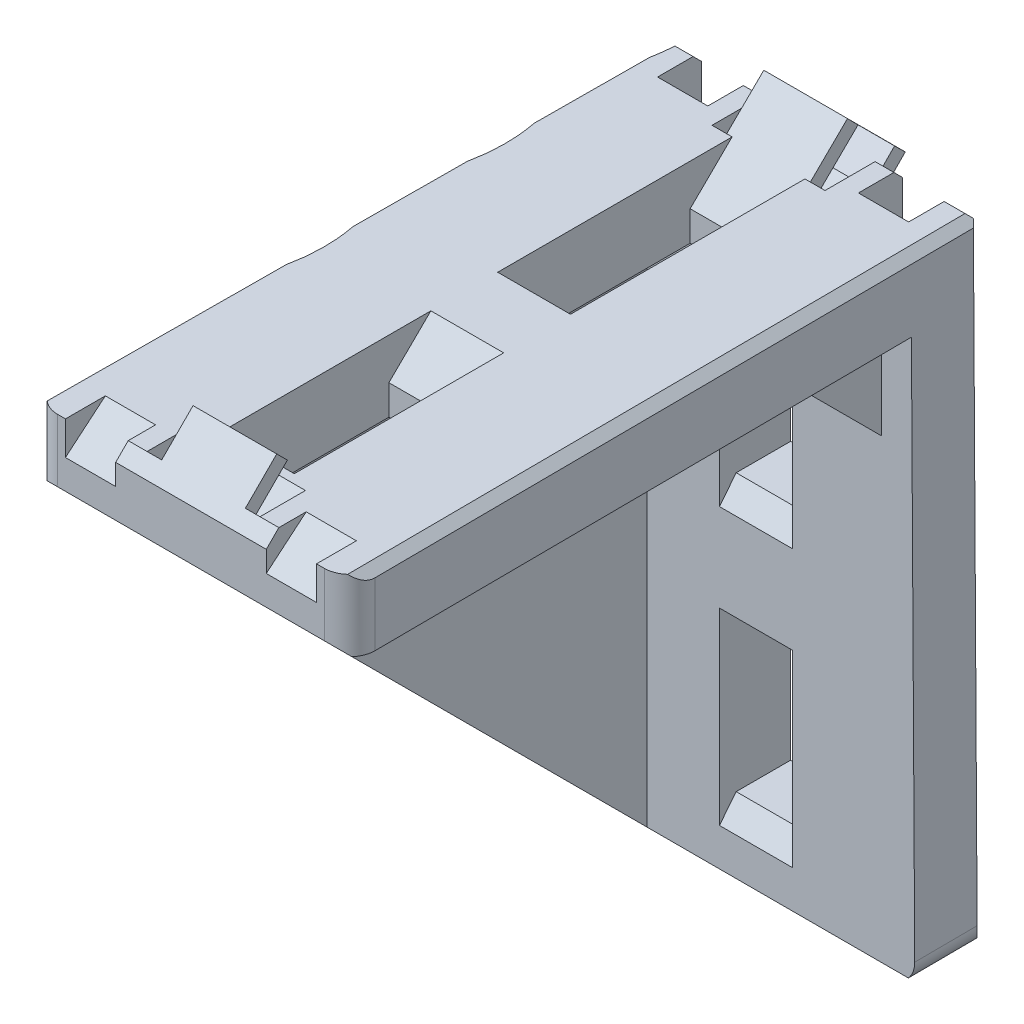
ISO-10303-21;
HEADER;
FILE_DESCRIPTION(('STEP AP214'),'2;1');
FILE_NAME('part.step','',(''),(''),'','','');
FILE_SCHEMA(('AUTOMOTIVE_DESIGN { 1 0 10303 214 1 1 1 1 }'));
ENDSEC;
DATA;
#1=APPLICATION_CONTEXT('core data for automotive mechanical design processes');
#2=APPLICATION_PROTOCOL_DEFINITION('international standard','automotive_design',2000,#1);
#3=PRODUCT_CONTEXT('',#1,'mechanical');
#4=PRODUCT('Part','Part','',(#3));
#5=PRODUCT_RELATED_PRODUCT_CATEGORY('part','',(#4));
#6=PRODUCT_DEFINITION_FORMATION('','',#4);
#7=PRODUCT_DEFINITION_CONTEXT('part definition',#1,'design');
#8=PRODUCT_DEFINITION('design','',#6,#7);
#9=PRODUCT_DEFINITION_SHAPE('','',#8);
#10=(LENGTH_UNIT() NAMED_UNIT(*) SI_UNIT(.MILLI.,.METRE.));
#11=(NAMED_UNIT(*) PLANE_ANGLE_UNIT() SI_UNIT($,.RADIAN.));
#12=(NAMED_UNIT(*) SI_UNIT($,.STERADIAN.) SOLID_ANGLE_UNIT());
#13=UNCERTAINTY_MEASURE_WITH_UNIT(LENGTH_MEASURE(1.E-05),#10,'distance_accuracy_value','');
#14=(GEOMETRIC_REPRESENTATION_CONTEXT(3) GLOBAL_UNCERTAINTY_ASSIGNED_CONTEXT((#13)) GLOBAL_UNIT_ASSIGNED_CONTEXT((#10,
#11,#12)) REPRESENTATION_CONTEXT('',''));
#15=CARTESIAN_POINT('',(0.,0.,0.));
#16=DIRECTION('',(0.,0.,1.));
#17=DIRECTION('',(1.,0.,0.));
#18=AXIS2_PLACEMENT_3D('',#15,#16,#17);
#19=CARTESIAN_POINT('',(-5.,-73.2272077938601,1.27279220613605));
#20=DIRECTION('',(0.,-0.707106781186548,-0.707106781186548));
#21=DIRECTION('',(0.,0.707106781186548,-0.707106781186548));
#22=AXIS2_PLACEMENT_3D('',#19,#20,#21);
#23=PLANE('',#22);
#24=DIRECTION('',(0.,0.707106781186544,-0.707106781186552));
#25=VECTOR('',#24,1.);
#26=CARTESIAN_POINT('',(5.,-73.227207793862,1.27279220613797));
#27=LINE('',#26,#25);
#28=CARTESIAN_POINT('',(5.,-73.227207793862,1.27279220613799));
#29=VERTEX_POINT('',#28);
#30=CARTESIAN_POINT('',(5.,-69.4795418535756,-2.47487373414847));
#31=VERTEX_POINT('',#30);
#32=EDGE_CURVE('E1478',#29,#31,#27,.T.);
#33=ORIENTED_EDGE('',*,*,#32,.T.);
#34=DIRECTION('',(1.,0.,0.));
#35=VECTOR('',#34,1.);
#36=CARTESIAN_POINT('',(-5.,-69.4795418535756,-2.47487373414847));
#37=LINE('',#36,#35);
#38=CARTESIAN_POINT('',(-5.,-69.4795418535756,-2.47487373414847));
#39=VERTEX_POINT('',#38);
#40=EDGE_CURVE('E1481',#31,#39,#37,.F.);
#41=ORIENTED_EDGE('',*,*,#40,.T.);
#42=DIRECTION('',(0.,0.707106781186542,-0.707106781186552));
#43=VECTOR('',#42,1.);
#44=CARTESIAN_POINT('',(-5.,-73.227207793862,1.27279220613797));
#45=LINE('',#44,#43);
#46=CARTESIAN_POINT('',(-5.00000000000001,-73.227207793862,1.27279220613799));
#47=VERTEX_POINT('',#46);
#48=EDGE_CURVE('E1483',#47,#39,#45,.T.);
#49=ORIENTED_EDGE('',*,*,#48,.F.);
#50=DIRECTION('',(1.,0.,0.));
#51=VECTOR('',#50,1.);
#52=CARTESIAN_POINT('',(6.75,-73.227207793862,1.27279220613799));
#53=LINE('',#52,#51);
#54=EDGE_CURVE('E1492',#29,#47,#53,.F.);
#55=ORIENTED_EDGE('',*,*,#54,.F.);
#56=EDGE_LOOP('',(#33,#41,#49,#55));
#57=FACE_BOUND('',#56,.T.);
#58=ADVANCED_FACE('F15',(#57),#23,.F.);
#59=CARTESIAN_POINT('',(-4.99999999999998,-1.27279220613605,73.2272077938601));
#60=DIRECTION('',(0.,-0.707106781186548,-0.707106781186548));
#61=DIRECTION('',(0.,0.707106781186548,-0.707106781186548));
#62=AXIS2_PLACEMENT_3D('',#59,#60,#61);
#63=PLANE('',#62);
#64=DIRECTION('',(1.,0.,0.));
#65=VECTOR('',#64,1.);
#66=CARTESIAN_POINT('',(-4.99999999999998,2.47487373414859,69.4795418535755));
#67=LINE('',#66,#65);
#68=CARTESIAN_POINT('',(5.00000000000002,2.47487373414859,69.4795418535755));
#69=VERTEX_POINT('',#68);
#70=CARTESIAN_POINT('',(-4.99999999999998,2.47487373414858,69.4795418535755));
#71=VERTEX_POINT('',#70);
#72=EDGE_CURVE('E1516',#69,#71,#67,.F.);
#73=ORIENTED_EDGE('',*,*,#72,.F.);
#74=DIRECTION('',(0.,0.707106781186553,-0.707106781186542));
#75=VECTOR('',#74,1.);
#76=CARTESIAN_POINT('',(5.00000000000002,-1.27279220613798,73.227207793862));
#77=LINE('',#76,#75);
#78=CARTESIAN_POINT('',(5.00000000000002,-1.27279220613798,73.227207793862));
#79=VERTEX_POINT('',#78);
#80=EDGE_CURVE('E1508',#79,#69,#77,.T.);
#81=ORIENTED_EDGE('',*,*,#80,.F.);
#82=DIRECTION('',(1.,0.,0.));
#83=VECTOR('',#82,1.);
#84=CARTESIAN_POINT('',(6.75000000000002,-1.27279220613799,73.227207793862));
#85=LINE('',#84,#83);
#86=CARTESIAN_POINT('',(-4.99999999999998,-1.27279220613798,73.227207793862));
#87=VERTEX_POINT('',#86);
#88=EDGE_CURVE('E1495',#79,#87,#85,.F.);
#89=ORIENTED_EDGE('',*,*,#88,.T.);
#90=DIRECTION('',(0.,0.707106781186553,-0.707106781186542));
#91=VECTOR('',#90,1.);
#92=CARTESIAN_POINT('',(-4.99999999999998,-1.27279220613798,73.227207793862));
#93=LINE('',#92,#91);
#94=EDGE_CURVE('E1522',#87,#71,#93,.T.);
#95=ORIENTED_EDGE('',*,*,#94,.T.);
#96=EDGE_LOOP('',(#73,#81,#89,#95));
#97=FACE_BOUND('',#96,.T.);
#98=ADVANCED_FACE('F2573',(#97),#63,.T.);
#99=CARTESIAN_POINT('',(-5.,-1.27284067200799,5.71144149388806));
#100=DIRECTION('',(0.,-0.713250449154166,-0.700909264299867));
#101=DIRECTION('',(0.,0.700909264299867,-0.713250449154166));
#102=AXIS2_PLACEMENT_3D('',#99,#100,#101);
#103=PLANE('',#102);
#104=DIRECTION('',(1.,0.,0.));
#105=VECTOR('',#104,1.);
#106=CARTESIAN_POINT('',(-5.,3.07296224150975,1.2891203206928));
#107=LINE('',#106,#105);
#108=CARTESIAN_POINT('',(5.,3.07296224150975,1.2891203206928));
#109=VERTEX_POINT('',#108);
#110=CARTESIAN_POINT('',(-5.,3.07296224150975,1.2891203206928));
#111=VERTEX_POINT('',#110);
#112=EDGE_CURVE('E1468',#109,#111,#107,.F.);
#113=ORIENTED_EDGE('',*,*,#112,.F.);
#114=DIRECTION('',(0.,0.700909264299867,-0.713250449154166));
#115=VECTOR('',#114,1.);
#116=CARTESIAN_POINT('',(5.,-1.27284067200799,5.71144149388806));
#117=LINE('',#116,#115);
#118=CARTESIAN_POINT('',(5.,-1.27284067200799,5.71144149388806));
#119=VERTEX_POINT('',#118);
#120=EDGE_CURVE('E1471',#119,#109,#117,.T.);
#121=ORIENTED_EDGE('',*,*,#120,.F.);
#122=DIRECTION('',(1.,0.,0.));
#123=VECTOR('',#122,1.);
#124=CARTESIAN_POINT('',(6.75,-1.27284067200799,5.71144149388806));
#125=LINE('',#124,#123);
#126=CARTESIAN_POINT('',(-5.00000000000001,-1.27284067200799,5.71144149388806));
#127=VERTEX_POINT('',#126);
#128=EDGE_CURVE('E1573',#119,#127,#125,.F.);
#129=ORIENTED_EDGE('',*,*,#128,.T.);
#130=DIRECTION('',(0.,0.700909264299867,-0.713250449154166));
#131=VECTOR('',#130,1.);
#132=CARTESIAN_POINT('',(-5.,-1.27284067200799,5.71144149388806));
#133=LINE('',#132,#131);
#134=EDGE_CURVE('E1581',#127,#111,#133,.T.);
#135=ORIENTED_EDGE('',*,*,#134,.T.);
#136=EDGE_LOOP('',(#113,#121,#129,#135));
#137=FACE_BOUND('',#136,.T.);
#138=ADVANCED_FACE('F2570',(#137),#103,.T.);
#139=CARTESIAN_POINT('',(-5.,-5.71144149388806,1.27284067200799));
#140=DIRECTION('',(0.,-0.700909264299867,-0.713250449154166));
#141=DIRECTION('',(0.,0.713250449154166,-0.700909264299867));
#142=AXIS2_PLACEMENT_3D('',#139,#140,#141);
#143=PLANE('',#142);
#144=DIRECTION('',(0.,0.713250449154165,-0.700909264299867));
#145=VECTOR('',#144,1.);
#146=CARTESIAN_POINT('',(5.,-5.71144149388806,1.27284067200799));
#147=LINE('',#146,#145);
#148=CARTESIAN_POINT('',(5.,-5.71144149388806,1.27284067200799));
#149=VERTEX_POINT('',#148);
#150=CARTESIAN_POINT('',(5.,-1.2891203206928,-3.07296224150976));
#151=VERTEX_POINT('',#150);
#152=EDGE_CURVE('E1589',#149,#151,#147,.T.);
#153=ORIENTED_EDGE('',*,*,#152,.T.);
#154=DIRECTION('',(1.,0.,0.));
#155=VECTOR('',#154,1.);
#156=CARTESIAN_POINT('',(-5.,-1.2891203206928,-3.07296224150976));
#157=LINE('',#156,#155);
#158=CARTESIAN_POINT('',(-5.,-1.2891203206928,-3.07296224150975));
#159=VERTEX_POINT('',#158);
#160=EDGE_CURVE('E1596',#151,#159,#157,.F.);
#161=ORIENTED_EDGE('',*,*,#160,.T.);
#162=DIRECTION('',(0.,0.713250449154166,-0.700909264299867));
#163=VECTOR('',#162,1.);
#164=CARTESIAN_POINT('',(-5.,-5.71144149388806,1.27284067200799));
#165=LINE('',#164,#163);
#166=CARTESIAN_POINT('',(-5.00000000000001,-5.71144149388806,1.27284067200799));
#167=VERTEX_POINT('',#166);
#168=EDGE_CURVE('E1598',#167,#159,#165,.T.);
#169=ORIENTED_EDGE('',*,*,#168,.F.);
#170=DIRECTION('',(1.,0.,0.));
#171=VECTOR('',#170,1.);
#172=CARTESIAN_POINT('',(6.75,-5.71144149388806,1.27284067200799));
#173=LINE('',#172,#171);
#174=EDGE_CURVE('E1615',#149,#167,#173,.F.);
#175=ORIENTED_EDGE('',*,*,#174,.F.);
#176=EDGE_LOOP('',(#153,#161,#169,#175));
#177=FACE_BOUND('',#176,.T.);
#178=ADVANCED_FACE('F2567',(#177),#143,.F.);
#179=CARTESIAN_POINT('',(6.75,-2.71432362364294,4.26995854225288));
#180=DIRECTION('',(0.,-0.707106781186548,-0.707106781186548));
#181=DIRECTION('',(0.,0.707106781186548,-0.707106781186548));
#182=AXIS2_PLACEMENT_3D('',#179,#180,#181);
#183=PLANE('',#182);
#184=DIRECTION('',(1.,0.,0.));
#185=VECTOR('',#184,1.);
#186=CARTESIAN_POINT('',(6.75,-1.30011006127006,2.85574497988));
#187=LINE('',#186,#185);
#188=CARTESIAN_POINT('',(6.75,-1.30011006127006,2.85574497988));
#189=VERTEX_POINT('',#188);
#190=CARTESIAN_POINT('',(-6.75,-1.30011006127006,2.85574497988));
#191=VERTEX_POINT('',#190);
#192=EDGE_CURVE('E1647',#189,#191,#187,.F.);
#193=ORIENTED_EDGE('',*,*,#192,.T.);
#194=DIRECTION('',(0.,0.707106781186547,-0.707106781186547));
#195=VECTOR('',#194,1.);
#196=CARTESIAN_POINT('',(-6.75,-2.71432362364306,4.269958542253));
#197=LINE('',#196,#195);
#198=CARTESIAN_POINT('',(-6.75000000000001,-2.71432362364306,4.269958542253));
#199=VERTEX_POINT('',#198);
#200=EDGE_CURVE('E1641',#199,#191,#197,.T.);
#201=ORIENTED_EDGE('',*,*,#200,.F.);
#202=DIRECTION('',(1.,0.,0.));
#203=VECTOR('',#202,1.);
#204=CARTESIAN_POINT('',(6.75,-2.71432362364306,4.269958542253));
#205=LINE('',#204,#203);
#206=CARTESIAN_POINT('',(6.75,-2.71432362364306,4.269958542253));
#207=VERTEX_POINT('',#206);
#208=EDGE_CURVE('E1574',#199,#207,#205,.T.);
#209=ORIENTED_EDGE('',*,*,#208,.T.);
#210=DIRECTION('',(0.,0.707106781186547,-0.707106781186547));
#211=VECTOR('',#210,1.);
#212=CARTESIAN_POINT('',(6.75,-2.71432362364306,4.269958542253));
#213=LINE('',#212,#211);
#214=EDGE_CURVE('E1541',#207,#189,#213,.T.);
#215=ORIENTED_EDGE('',*,*,#214,.T.);
#216=EDGE_LOOP('',(#193,#201,#209,#215));
#217=FACE_BOUND('',#216,.T.);
#218=ADVANCED_FACE('F2356',(#217),#183,.F.);
#219=CARTESIAN_POINT('',(6.75,-1.30011006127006,2.85574497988));
#220=DIRECTION('',(0.,-0.707106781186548,0.707106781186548));
#221=DIRECTION('',(0.,-0.707106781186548,-0.707106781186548));
#222=AXIS2_PLACEMENT_3D('',#219,#220,#221);
#223=PLANE('',#222);
#224=ORIENTED_EDGE('',*,*,#192,.F.);
#225=DIRECTION('',(0.,-0.707106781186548,-0.707106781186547));
#226=VECTOR('',#225,1.);
#227=CARTESIAN_POINT('',(6.75,-1.30011006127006,2.85574497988));
#228=LINE('',#227,#226);
#229=CARTESIAN_POINT('',(6.75,-2.85574497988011,1.30011006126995));
#230=VERTEX_POINT('',#229);
#231=EDGE_CURVE('E1543',#189,#230,#228,.T.);
#232=ORIENTED_EDGE('',*,*,#231,.T.);
#233=DIRECTION('',(1.,0.,0.));
#234=VECTOR('',#233,1.);
#235=CARTESIAN_POINT('',(6.75,-2.85574497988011,1.30011006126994));
#236=LINE('',#235,#234);
#237=CARTESIAN_POINT('',(-6.75,-2.85574497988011,1.30011006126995));
#238=VERTEX_POINT('',#237);
#239=EDGE_CURVE('E1583',#238,#230,#236,.T.);
#240=ORIENTED_EDGE('',*,*,#239,.F.);
#241=DIRECTION('',(0.,-0.707106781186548,-0.707106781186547));
#242=VECTOR('',#241,1.);
#243=CARTESIAN_POINT('',(-6.75,-1.30011006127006,2.85574497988));
#244=LINE('',#243,#242);
#245=EDGE_CURVE('E1644',#191,#238,#244,.T.);
#246=ORIENTED_EDGE('',*,*,#245,.F.);
#247=EDGE_LOOP('',(#224,#232,#240,#246));
#248=FACE_BOUND('',#247,.T.);
#249=ADVANCED_FACE('F2361',(#248),#223,.F.);
#250=CARTESIAN_POINT('',(6.75,-4.26995854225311,2.71432362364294));
#251=DIRECTION('',(0.,-0.707106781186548,-0.707106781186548));
#252=DIRECTION('',(0.,0.707106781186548,-0.707106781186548));
#253=AXIS2_PLACEMENT_3D('',#250,#251,#252);
#254=PLANE('',#253);
#255=DIRECTION('',(0.,-0.70710678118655,0.707106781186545));
#256=VECTOR('',#255,1.);
#257=CARTESIAN_POINT('',(-6.75,-2.85574497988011,1.30011006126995));
#258=LINE('',#257,#256);
#259=CARTESIAN_POINT('',(-6.75,-4.26995854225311,2.71432362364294));
#260=VERTEX_POINT('',#259);
#261=EDGE_CURVE('E1653',#238,#260,#258,.T.);
#262=ORIENTED_EDGE('',*,*,#261,.F.);
#263=ORIENTED_EDGE('',*,*,#239,.T.);
#264=DIRECTION('',(0.,-0.70710678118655,0.707106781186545));
#265=VECTOR('',#264,1.);
#266=CARTESIAN_POINT('',(6.75,-2.85574497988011,1.30011006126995));
#267=LINE('',#266,#265);
#268=CARTESIAN_POINT('',(6.75,-4.26995854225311,2.71432362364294));
#269=VERTEX_POINT('',#268);
#270=EDGE_CURVE('E1626',#230,#269,#267,.T.);
#271=ORIENTED_EDGE('',*,*,#270,.T.);
#272=DIRECTION('',(1.,0.,0.));
#273=VECTOR('',#272,1.);
#274=CARTESIAN_POINT('',(6.75,-4.26995854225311,2.71432362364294));
#275=LINE('',#274,#273);
#276=EDGE_CURVE('E1634',#260,#269,#275,.T.);
#277=ORIENTED_EDGE('',*,*,#276,.F.);
#278=EDGE_LOOP('',(#262,#263,#271,#277));
#279=FACE_BOUND('',#278,.T.);
#280=ADVANCED_FACE('F2364',(#279),#254,.T.);
#281=CARTESIAN_POINT('',(-5.,0.,0.));
#282=DIRECTION('',(1.,0.,0.));
#283=DIRECTION('',(0.,0.,-1.));
#284=AXIS2_PLACEMENT_3D('',#281,#282,#283);
#285=PLANE('',#284);
#286=DIRECTION('',(0.,0.700909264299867,-0.713250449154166));
#287=VECTOR('',#286,1.);
#288=CARTESIAN_POINT('',(-5.,-4.92893218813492,12.));
#289=LINE('',#288,#287);
#290=CARTESIAN_POINT('',(-5.,0.,6.98428216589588));
#291=VERTEX_POINT('',#290);
#292=CARTESIAN_POINT('',(-5.,4.35681304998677,2.55075699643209));
#293=VERTEX_POINT('',#292);
#294=EDGE_CURVE('E1669',#291,#293,#289,.T.);
#295=ORIENTED_EDGE('',*,*,#294,.T.);
#296=DIRECTION('',(0.,0.713250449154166,0.700909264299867));
#297=VECTOR('',#296,1.);
#298=CARTESIAN_POINT('',(-5.,3.072962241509,1.28912032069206));
#299=LINE('',#298,#297);
#300=EDGE_CURVE('E1472',#111,#293,#299,.T.);
#301=ORIENTED_EDGE('',*,*,#300,.F.);
#302=ORIENTED_EDGE('',*,*,#134,.F.);
#303=DIRECTION('',(0.,-0.707106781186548,-0.707106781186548));
#304=VECTOR('',#303,1.);
#305=CARTESIAN_POINT('',(-5.00000000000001,0.,6.98428216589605));
#306=LINE('',#305,#304);
#307=EDGE_CURVE('E1578',#127,#291,#306,.F.);
#308=ORIENTED_EDGE('',*,*,#307,.T.);
#309=EDGE_LOOP('',(#295,#301,#302,#308));
#310=FACE_BOUND('',#309,.T.);
#311=ADVANCED_FACE('F2556',(#310),#285,.F.);
#312=CARTESIAN_POINT('',(-5.,3.072962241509,1.28912032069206));
#313=DIRECTION('',(0.,0.700909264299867,-0.713250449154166));
#314=DIRECTION('',(0.,0.713250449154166,0.700909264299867));
#315=AXIS2_PLACEMENT_3D('',#312,#313,#314);
#316=PLANE('',#315);
#317=DIRECTION('',(0.,0.713250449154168,0.700909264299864));
#318=VECTOR('',#317,1.);
#319=CARTESIAN_POINT('',(5.,3.07296224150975,1.2891203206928));
#320=LINE('',#319,#318);
#321=CARTESIAN_POINT('',(5.,4.35681304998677,2.55075699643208));
#322=VERTEX_POINT('',#321);
#323=EDGE_CURVE('E1475',#109,#322,#320,.T.);
#324=ORIENTED_EDGE('',*,*,#323,.F.);
#325=ORIENTED_EDGE('',*,*,#112,.T.);
#326=ORIENTED_EDGE('',*,*,#300,.T.);
#327=DIRECTION('',(1.,0.,0.));
#328=VECTOR('',#327,1.);
#329=CARTESIAN_POINT('',(4.35,4.35681304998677,2.55075699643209));
#330=LINE('',#329,#328);
#331=EDGE_CURVE('E1563',#293,#322,#330,.T.);
#332=ORIENTED_EDGE('',*,*,#331,.T.);
#333=EDGE_LOOP('',(#324,#325,#326,#332));
#334=FACE_BOUND('',#333,.T.);
#335=ADVANCED_FACE('F2552',(#334),#316,.T.);
#336=CARTESIAN_POINT('',(5.,0.,0.));
#337=DIRECTION('',(1.,0.,0.));
#338=DIRECTION('',(0.,0.,-1.));
#339=AXIS2_PLACEMENT_3D('',#336,#337,#338);
#340=PLANE('',#339);
#341=ORIENTED_EDGE('',*,*,#323,.T.);
#342=DIRECTION('',(0.,0.700909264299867,-0.713250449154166));
#343=VECTOR('',#342,1.);
#344=CARTESIAN_POINT('',(5.,-4.92893218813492,12.));
#345=LINE('',#344,#343);
#346=CARTESIAN_POINT('',(5.,0.,6.98428216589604));
#347=VERTEX_POINT('',#346);
#348=EDGE_CURVE('E1560',#322,#347,#345,.F.);
#349=ORIENTED_EDGE('',*,*,#348,.T.);
#350=DIRECTION('',(0.,-0.707106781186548,-0.707106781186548));
#351=VECTOR('',#350,1.);
#352=CARTESIAN_POINT('',(5.,0.,6.98428216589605));
#353=LINE('',#352,#351);
#354=EDGE_CURVE('E1570',#347,#119,#353,.T.);
#355=ORIENTED_EDGE('',*,*,#354,.T.);
#356=ORIENTED_EDGE('',*,*,#120,.T.);
#357=EDGE_LOOP('',(#341,#349,#355,#356));
#358=FACE_BOUND('',#357,.T.);
#359=ADVANCED_FACE('F2548',(#358),#340,.T.);
#360=CARTESIAN_POINT('',(5.,0.,0.));
#361=DIRECTION('',(-1.,0.,0.));
#362=DIRECTION('',(0.,0.,1.));
#363=AXIS2_PLACEMENT_3D('',#360,#361,#362);
#364=PLANE('',#363);
#365=DIRECTION('',(0.,-0.707106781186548,0.707106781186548));
#366=VECTOR('',#365,1.);
#367=CARTESIAN_POINT('',(5.00000000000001,-76.,1.50000000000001));
#368=LINE('',#367,#366);
#369=CARTESIAN_POINT('',(5.00000000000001,-74.5,0.));
#370=VERTEX_POINT('',#369);
#371=CARTESIAN_POINT('',(5.00000000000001,-70.7523340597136,-3.74766594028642));
#372=VERTEX_POINT('',#371);
#373=EDGE_CURVE('E1681',#370,#372,#368,.F.);
#374=ORIENTED_EDGE('',*,*,#373,.T.);
#375=DIRECTION('',(0.,-0.707106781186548,-0.707106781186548));
#376=VECTOR('',#375,1.);
#377=CARTESIAN_POINT('',(5.,-69.47954185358,-2.47487373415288));
#378=LINE('',#377,#376);
#379=EDGE_CURVE('E1484',#372,#31,#378,.F.);
#380=ORIENTED_EDGE('',*,*,#379,.T.);
#381=ORIENTED_EDGE('',*,*,#32,.F.);
#382=DIRECTION('',(0.,0.707106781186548,0.707106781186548));
#383=VECTOR('',#382,1.);
#384=CARTESIAN_POINT('',(5.,-74.5,0.));
#385=LINE('',#384,#383);
#386=EDGE_CURVE('E1496',#370,#29,#385,.T.);
#387=ORIENTED_EDGE('',*,*,#386,.F.);
#388=EDGE_LOOP('',(#374,#380,#381,#387));
#389=FACE_BOUND('',#388,.T.);
#390=ADVANCED_FACE('F2544',(#389),#364,.F.);
#391=CARTESIAN_POINT('',(-5.,-69.47954185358,-2.47487373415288));
#392=DIRECTION('',(0.,-0.707106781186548,0.707106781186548));
#393=DIRECTION('',(0.,-0.707106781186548,-0.707106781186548));
#394=AXIS2_PLACEMENT_3D('',#391,#392,#393);
#395=PLANE('',#394);
#396=ORIENTED_EDGE('',*,*,#40,.F.);
#397=ORIENTED_EDGE('',*,*,#379,.F.);
#398=DIRECTION('',(1.,0.,0.));
#399=VECTOR('',#398,1.);
#400=CARTESIAN_POINT('',(-9.,-70.7523340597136,-3.74766594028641));
#401=LINE('',#400,#399);
#402=CARTESIAN_POINT('',(-5.,-70.7523340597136,-3.74766594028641));
#403=VERTEX_POINT('',#402);
#404=EDGE_CURVE('E1683',#372,#403,#401,.F.);
#405=ORIENTED_EDGE('',*,*,#404,.T.);
#406=DIRECTION('',(0.,-0.707106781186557,-0.707106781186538));
#407=VECTOR('',#406,1.);
#408=CARTESIAN_POINT('',(-5.,-69.4795418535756,-2.47487373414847));
#409=LINE('',#408,#407);
#410=EDGE_CURVE('E1489',#39,#403,#409,.T.);
#411=ORIENTED_EDGE('',*,*,#410,.F.);
#412=EDGE_LOOP('',(#396,#397,#405,#411));
#413=FACE_BOUND('',#412,.T.);
#414=ADVANCED_FACE('F2540',(#413),#395,.F.);
#415=CARTESIAN_POINT('',(-5.,0.,0.));
#416=DIRECTION('',(-1.,0.,0.));
#417=DIRECTION('',(0.,0.,1.));
#418=AXIS2_PLACEMENT_3D('',#415,#416,#417);
#419=PLANE('',#418);
#420=ORIENTED_EDGE('',*,*,#410,.T.);
#421=DIRECTION('',(0.,-0.707106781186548,0.707106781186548));
#422=VECTOR('',#421,1.);
#423=CARTESIAN_POINT('',(-5.,-76.,1.50000000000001));
#424=LINE('',#423,#422);
#425=CARTESIAN_POINT('',(-5.,-74.5,0.));
#426=VERTEX_POINT('',#425);
#427=EDGE_CURVE('E1692',#403,#426,#424,.T.);
#428=ORIENTED_EDGE('',*,*,#427,.T.);
#429=DIRECTION('',(0.,0.707106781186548,0.707106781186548));
#430=VECTOR('',#429,1.);
#431=CARTESIAN_POINT('',(-5.00000000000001,-74.5,0.));
#432=LINE('',#431,#430);
#433=EDGE_CURVE('E1678',#47,#426,#432,.F.);
#434=ORIENTED_EDGE('',*,*,#433,.F.);
#435=ORIENTED_EDGE('',*,*,#48,.T.);
#436=EDGE_LOOP('',(#420,#428,#434,#435));
#437=FACE_BOUND('',#436,.T.);
#438=ADVANCED_FACE('F2537',(#437),#419,.T.);
#439=CARTESIAN_POINT('',(6.75,-74.5,0.));
#440=DIRECTION('',(0.,0.707106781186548,-0.707106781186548));
#441=DIRECTION('',(0.,0.707106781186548,0.707106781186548));
#442=AXIS2_PLACEMENT_3D('',#439,#440,#441);
#443=PLANE('',#442);
#444=ORIENTED_EDGE('',*,*,#386,.T.);
#445=ORIENTED_EDGE('',*,*,#54,.T.);
#446=ORIENTED_EDGE('',*,*,#433,.T.);
#447=DIRECTION('',(1.,0.,0.));
#448=VECTOR('',#447,1.);
#449=CARTESIAN_POINT('',(-9.,-74.5,0.));
#450=LINE('',#449,#448);
#451=CARTESIAN_POINT('',(-6.75,-74.5,0.));
#452=VERTEX_POINT('',#451);
#453=EDGE_CURVE('E1700',#426,#452,#450,.F.);
#454=ORIENTED_EDGE('',*,*,#453,.T.);
#455=DIRECTION('',(0.,-0.70710678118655,-0.707106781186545));
#456=VECTOR('',#455,1.);
#457=CARTESIAN_POINT('',(-6.75,-71.7856763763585,2.71432362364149));
#458=LINE('',#457,#456);
#459=CARTESIAN_POINT('',(-6.75000000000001,-71.7856763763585,2.71432362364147));
#460=VERTEX_POINT('',#459);
#461=EDGE_CURVE('E1588',#460,#452,#458,.T.);
#462=ORIENTED_EDGE('',*,*,#461,.F.);
#463=DIRECTION('',(1.,0.,0.));
#464=VECTOR('',#463,1.);
#465=CARTESIAN_POINT('',(6.75,-71.7856763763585,2.71432362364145));
#466=LINE('',#465,#464);
#467=CARTESIAN_POINT('',(6.75,-71.7856763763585,2.71432362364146));
#468=VERTEX_POINT('',#467);
#469=EDGE_CURVE('E1601',#468,#460,#466,.F.);
#470=ORIENTED_EDGE('',*,*,#469,.F.);
#471=DIRECTION('',(0.,-0.707106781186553,-0.707106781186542));
#472=VECTOR('',#471,1.);
#473=CARTESIAN_POINT('',(6.75,-71.7856763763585,2.71432362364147));
#474=LINE('',#473,#472);
#475=CARTESIAN_POINT('',(6.75,-74.5,0.));
#476=VERTEX_POINT('',#475);
#477=EDGE_CURVE('E1793',#468,#476,#474,.T.);
#478=ORIENTED_EDGE('',*,*,#477,.T.);
#479=DIRECTION('',(1.,0.,0.));
#480=VECTOR('',#479,1.);
#481=CARTESIAN_POINT('',(-9.,-74.5,0.));
#482=LINE('',#481,#480);
#483=EDGE_CURVE('E1684',#476,#370,#482,.F.);
#484=ORIENTED_EDGE('',*,*,#483,.T.);
#485=EDGE_LOOP('',(#444,#445,#446,#454,#462,#470,#478,#484));
#486=FACE_BOUND('',#485,.T.);
#487=ADVANCED_FACE('F2417',(#486),#443,.T.);
#488=CARTESIAN_POINT('',(6.75000000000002,0.,74.5));
#489=DIRECTION('',(0.,-0.707106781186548,0.707106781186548));
#490=DIRECTION('',(0.,-0.707106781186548,-0.707106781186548));
#491=AXIS2_PLACEMENT_3D('',#488,#489,#490);
#492=PLANE('',#491);
#493=ORIENTED_EDGE('',*,*,#88,.F.);
#494=DIRECTION('',(0.,-0.70710678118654,-0.707106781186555));
#495=VECTOR('',#494,1.);
#496=CARTESIAN_POINT('',(5.00000000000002,0.,74.5));
#497=LINE('',#496,#495);
#498=CARTESIAN_POINT('',(5.00000000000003,0.,74.5));
#499=VERTEX_POINT('',#498);
#500=EDGE_CURVE('E1511',#499,#79,#497,.T.);
#501=ORIENTED_EDGE('',*,*,#500,.F.);
#502=DIRECTION('',(1.,0.,0.));
#503=VECTOR('',#502,1.);
#504=CARTESIAN_POINT('',(-8.99999999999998,0.,74.5));
#505=LINE('',#504,#503);
#506=CARTESIAN_POINT('',(6.75000000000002,0.,74.5));
#507=VERTEX_POINT('',#506);
#508=EDGE_CURVE('E880',#507,#499,#505,.F.);
#509=ORIENTED_EDGE('',*,*,#508,.F.);
#510=DIRECTION('',(0.,-0.707106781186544,-0.707106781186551));
#511=VECTOR('',#510,1.);
#512=CARTESIAN_POINT('',(6.75000000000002,0.,74.5));
#513=LINE('',#512,#511);
#514=CARTESIAN_POINT('',(6.75000000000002,-2.71432362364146,71.7856763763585));
#515=VERTEX_POINT('',#514);
#516=EDGE_CURVE('E1638',#507,#515,#513,.T.);
#517=ORIENTED_EDGE('',*,*,#516,.T.);
#518=DIRECTION('',(1.,0.,0.));
#519=VECTOR('',#518,1.);
#520=CARTESIAN_POINT('',(6.75000000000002,-2.71432362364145,71.7856763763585));
#521=LINE('',#520,#519);
#522=CARTESIAN_POINT('',(-6.74999999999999,-2.71432362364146,71.7856763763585));
#523=VERTEX_POINT('',#522);
#524=EDGE_CURVE('E1535',#515,#523,#521,.F.);
#525=ORIENTED_EDGE('',*,*,#524,.T.);
#526=DIRECTION('',(0.,-0.707106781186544,-0.707106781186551));
#527=VECTOR('',#526,1.);
#528=CARTESIAN_POINT('',(-6.74999999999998,0.,74.5));
#529=LINE('',#528,#527);
#530=CARTESIAN_POINT('',(-6.74999999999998,0.,74.5));
#531=VERTEX_POINT('',#530);
#532=EDGE_CURVE('E1538',#531,#523,#529,.T.);
#533=ORIENTED_EDGE('',*,*,#532,.F.);
#534=DIRECTION('',(1.,0.,0.));
#535=VECTOR('',#534,1.);
#536=CARTESIAN_POINT('',(-8.99999999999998,0.,74.5));
#537=LINE('',#536,#535);
#538=CARTESIAN_POINT('',(-4.99999999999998,0.,74.5));
#539=VERTEX_POINT('',#538);
#540=EDGE_CURVE('E881',#539,#531,#537,.F.);
#541=ORIENTED_EDGE('',*,*,#540,.F.);
#542=DIRECTION('',(0.,-0.707106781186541,-0.707106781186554));
#543=VECTOR('',#542,1.);
#544=CARTESIAN_POINT('',(-4.99999999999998,0.,74.5));
#545=LINE('',#544,#543);
#546=EDGE_CURVE('E1521',#539,#87,#545,.T.);
#547=ORIENTED_EDGE('',*,*,#546,.T.);
#548=EDGE_LOOP('',(#493,#501,#509,#517,#525,#533,#541,#547));
#549=FACE_BOUND('',#548,.T.);
#550=ADVANCED_FACE('F2530',(#549),#492,.F.);
#551=CARTESIAN_POINT('',(5.,0.,0.));
#552=DIRECTION('',(1.,0.,0.));
#553=DIRECTION('',(0.,0.,-1.));
#554=AXIS2_PLACEMENT_3D('',#551,#552,#553);
#555=PLANE('',#554);
#556=DIRECTION('',(0.,0.707106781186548,0.707106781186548));
#557=VECTOR('',#556,1.);
#558=CARTESIAN_POINT('',(5.00000000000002,2.47487373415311,69.47954185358));
#559=LINE('',#558,#557);
#560=CARTESIAN_POINT('',(5.00000000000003,3.74766594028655,70.7523340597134));
#561=VERTEX_POINT('',#560);
#562=EDGE_CURVE('E1510',#561,#69,#559,.F.);
#563=ORIENTED_EDGE('',*,*,#562,.F.);
#564=DIRECTION('',(0.,-0.707106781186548,0.707106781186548));
#565=VECTOR('',#564,1.);
#566=CARTESIAN_POINT('',(5.00000000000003,-1.5,76.));
#567=LINE('',#566,#565);
#568=EDGE_CURVE('E1505',#499,#561,#567,.F.);
#569=ORIENTED_EDGE('',*,*,#568,.F.);
#570=ORIENTED_EDGE('',*,*,#500,.T.);
#571=ORIENTED_EDGE('',*,*,#80,.T.);
#572=EDGE_LOOP('',(#563,#569,#570,#571));
#573=FACE_BOUND('',#572,.T.);
#574=ADVANCED_FACE('F2526',(#573),#555,.T.);
#575=CARTESIAN_POINT('',(-4.99999999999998,2.47487373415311,69.47954185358));
#576=DIRECTION('',(0.,0.707106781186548,-0.707106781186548));
#577=DIRECTION('',(0.,0.707106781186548,0.707106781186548));
#578=AXIS2_PLACEMENT_3D('',#575,#576,#577);
#579=PLANE('',#578);
#580=ORIENTED_EDGE('',*,*,#562,.T.);
#581=ORIENTED_EDGE('',*,*,#72,.T.);
#582=DIRECTION('',(0.,0.707106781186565,0.70710678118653));
#583=VECTOR('',#582,1.);
#584=CARTESIAN_POINT('',(-4.99999999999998,2.47487373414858,69.4795418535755));
#585=LINE('',#584,#583);
#586=CARTESIAN_POINT('',(-4.99999999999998,3.74766594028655,70.7523340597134));
#587=VERTEX_POINT('',#586);
#588=EDGE_CURVE('E1519',#71,#587,#585,.T.);
#589=ORIENTED_EDGE('',*,*,#588,.T.);
#590=DIRECTION('',(1.,0.,0.));
#591=VECTOR('',#590,1.);
#592=CARTESIAN_POINT('',(-8.99999999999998,3.74766594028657,70.7523340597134));
#593=LINE('',#592,#591);
#594=EDGE_CURVE('E1502',#561,#587,#593,.F.);
#595=ORIENTED_EDGE('',*,*,#594,.F.);
#596=EDGE_LOOP('',(#580,#581,#589,#595));
#597=FACE_BOUND('',#596,.T.);
#598=ADVANCED_FACE('F2522',(#597),#579,.T.);
#599=CARTESIAN_POINT('',(-5.,0.,0.));
#600=DIRECTION('',(1.,0.,0.));
#601=DIRECTION('',(0.,0.,-1.));
#602=AXIS2_PLACEMENT_3D('',#599,#600,#601);
#603=PLANE('',#602);
#604=DIRECTION('',(0.,-0.707106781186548,0.707106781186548));
#605=VECTOR('',#604,1.);
#606=CARTESIAN_POINT('',(-4.99999999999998,-1.5,76.));
#607=LINE('',#606,#605);
#608=EDGE_CURVE('E870',#587,#539,#607,.T.);
#609=ORIENTED_EDGE('',*,*,#608,.F.);
#610=ORIENTED_EDGE('',*,*,#588,.F.);
#611=ORIENTED_EDGE('',*,*,#94,.F.);
#612=ORIENTED_EDGE('',*,*,#546,.F.);
#613=EDGE_LOOP('',(#609,#610,#611,#612));
#614=FACE_BOUND('',#613,.T.);
#615=ADVANCED_FACE('F2518',(#614),#603,.F.);
#616=CARTESIAN_POINT('',(-6.75,0.,0.));
#617=DIRECTION('',(1.,0.,0.));
#618=DIRECTION('',(0.,0.,-1.));
#619=AXIS2_PLACEMENT_3D('',#616,#617,#618);
#620=PLANE('',#619);
#621=DIRECTION('',(0.,0.707106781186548,-0.707106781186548));
#622=VECTOR('',#621,1.);
#623=CARTESIAN_POINT('',(-6.74999999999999,-2.71432362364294,71.78567637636));
#624=LINE('',#623,#622);
#625=CARTESIAN_POINT('',(-6.74999999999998,0.,69.071352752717));
#626=VERTEX_POINT('',#625);
#627=EDGE_CURVE('E1537',#523,#626,#624,.T.);
#628=ORIENTED_EDGE('',*,*,#627,.T.);
#629=DIRECTION('',(0.,0.,1.));
#630=VECTOR('',#629,1.);
#631=CARTESIAN_POINT('',(-6.74999999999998,0.,0.));
#632=LINE('',#631,#630);
#633=EDGE_CURVE('E1739',#531,#626,#632,.F.);
#634=ORIENTED_EDGE('',*,*,#633,.F.);
#635=ORIENTED_EDGE('',*,*,#532,.T.);
#636=EDGE_LOOP('',(#628,#634,#635));
#637=FACE_BOUND('',#636,.T.);
#638=ADVANCED_FACE('F2514',(#637),#620,.T.);
#639=CARTESIAN_POINT('',(6.75000000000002,-2.71432362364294,71.78567637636));
#640=DIRECTION('',(0.,-0.707106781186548,-0.707106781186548));
#641=DIRECTION('',(0.,0.707106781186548,-0.707106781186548));
#642=AXIS2_PLACEMENT_3D('',#639,#640,#641);
#643=PLANE('',#642);
#644=ORIENTED_EDGE('',*,*,#627,.F.);
#645=ORIENTED_EDGE('',*,*,#524,.F.);
#646=DIRECTION('',(0.,0.707106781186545,-0.70710678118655));
#647=VECTOR('',#646,1.);
#648=CARTESIAN_POINT('',(6.75000000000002,-2.71432362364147,71.7856763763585));
#649=LINE('',#648,#647);
#650=CARTESIAN_POINT('',(6.75000000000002,0.,69.071352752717));
#651=VERTEX_POINT('',#650);
#652=EDGE_CURVE('E1752',#515,#651,#649,.T.);
#653=ORIENTED_EDGE('',*,*,#652,.T.);
#654=DIRECTION('',(1.,0.,0.));
#655=VECTOR('',#654,1.);
#656=CARTESIAN_POINT('',(-19.,0.,69.071352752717));
#657=LINE('',#656,#655);
#658=EDGE_CURVE('E1748',#626,#651,#657,.T.);
#659=ORIENTED_EDGE('',*,*,#658,.F.);
#660=EDGE_LOOP('',(#644,#645,#653,#659));
#661=FACE_BOUND('',#660,.T.);
#662=ADVANCED_FACE('F2510',(#661),#643,.F.);
#663=CARTESIAN_POINT('',(6.75,0.,0.));
#664=DIRECTION('',(1.,0.,0.));
#665=DIRECTION('',(0.,0.,-1.));
#666=AXIS2_PLACEMENT_3D('',#663,#664,#665);
#667=PLANE('',#666);
#668=DIRECTION('',(0.,0.,1.));
#669=VECTOR('',#668,1.);
#670=CARTESIAN_POINT('',(6.75000000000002,0.,0.));
#671=LINE('',#670,#669);
#672=EDGE_CURVE('E1757',#651,#507,#671,.T.);
#673=ORIENTED_EDGE('',*,*,#672,.F.);
#674=ORIENTED_EDGE('',*,*,#652,.F.);
#675=ORIENTED_EDGE('',*,*,#516,.F.);
#676=EDGE_LOOP('',(#673,#674,#675));
#677=FACE_BOUND('',#676,.T.);
#678=ADVANCED_FACE('F2507',(#677),#667,.F.);
#679=CARTESIAN_POINT('',(6.75,0.,6.98428216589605));
#680=DIRECTION('',(0.,-0.707106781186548,0.707106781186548));
#681=DIRECTION('',(0.,-0.707106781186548,-0.707106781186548));
#682=AXIS2_PLACEMENT_3D('',#679,#680,#681);
#683=PLANE('',#682);
#684=ORIENTED_EDGE('',*,*,#128,.F.);
#685=ORIENTED_EDGE('',*,*,#354,.F.);
#686=DIRECTION('',(1.,0.,0.));
#687=VECTOR('',#686,1.);
#688=CARTESIAN_POINT('',(-19.,0.,6.98428216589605));
#689=LINE('',#688,#687);
#690=CARTESIAN_POINT('',(6.75,0.,6.98428216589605));
#691=VERTEX_POINT('',#690);
#692=EDGE_CURVE('E810',#691,#347,#689,.F.);
#693=ORIENTED_EDGE('',*,*,#692,.F.);
#694=DIRECTION('',(0.,-0.707106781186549,-0.707106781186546));
#695=VECTOR('',#694,1.);
#696=CARTESIAN_POINT('',(6.75,0.,6.98428216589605));
#697=LINE('',#696,#695);
#698=EDGE_CURVE('E1544',#691,#207,#697,.T.);
#699=ORIENTED_EDGE('',*,*,#698,.T.);
#700=ORIENTED_EDGE('',*,*,#208,.F.);
#701=DIRECTION('',(0.,-0.707106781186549,-0.707106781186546));
#702=VECTOR('',#701,1.);
#703=CARTESIAN_POINT('',(-6.75,0.,6.98428216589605));
#704=LINE('',#703,#702);
#705=CARTESIAN_POINT('',(-6.75,0.,6.98428216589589));
#706=VERTEX_POINT('',#705);
#707=EDGE_CURVE('E1618',#706,#199,#704,.T.);
#708=ORIENTED_EDGE('',*,*,#707,.F.);
#709=DIRECTION('',(1.,0.,0.));
#710=VECTOR('',#709,1.);
#711=CARTESIAN_POINT('',(-19.,0.,6.98428216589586));
#712=LINE('',#711,#710);
#713=EDGE_CURVE('E1814',#291,#706,#712,.F.);
#714=ORIENTED_EDGE('',*,*,#713,.F.);
#715=ORIENTED_EDGE('',*,*,#307,.F.);
#716=EDGE_LOOP('',(#684,#685,#693,#699,#700,#708,#714,#715));
#717=FACE_BOUND('',#716,.T.);
#718=ADVANCED_FACE('F2351',(#717),#683,.F.);
#719=CARTESIAN_POINT('',(-5.,0.,0.));
#720=DIRECTION('',(-1.,0.,0.));
#721=DIRECTION('',(0.,0.,1.));
#722=AXIS2_PLACEMENT_3D('',#719,#720,#721);
#723=PLANE('',#722);
#724=DIRECTION('',(0.,-0.700909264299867,-0.713250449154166));
#725=VECTOR('',#724,1.);
#726=CARTESIAN_POINT('',(-5.,-1.28912032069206,-3.072962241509));
#727=LINE('',#726,#725);
#728=CARTESIAN_POINT('',(-5.,-2.55075699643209,-4.35681304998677));
#729=VERTEX_POINT('',#728);
#730=EDGE_CURVE('E1593',#159,#729,#727,.T.);
#731=ORIENTED_EDGE('',*,*,#730,.T.);
#732=DIRECTION('',(0.,0.713250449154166,-0.700909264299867));
#733=VECTOR('',#732,1.);
#734=CARTESIAN_POINT('',(-5.,-12.,4.92893218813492));
#735=LINE('',#734,#733);
#736=CARTESIAN_POINT('',(-5.,-6.98428216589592,0.));
#737=VERTEX_POINT('',#736);
#738=EDGE_CURVE('E1864',#737,#729,#735,.T.);
#739=ORIENTED_EDGE('',*,*,#738,.F.);
#740=DIRECTION('',(0.,0.707106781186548,0.707106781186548));
#741=VECTOR('',#740,1.);
#742=CARTESIAN_POINT('',(-5.00000000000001,-6.98428216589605,0.));
#743=LINE('',#742,#741);
#744=EDGE_CURVE('E1612',#167,#737,#743,.F.);
#745=ORIENTED_EDGE('',*,*,#744,.F.);
#746=ORIENTED_EDGE('',*,*,#168,.T.);
#747=EDGE_LOOP('',(#731,#739,#745,#746));
#748=FACE_BOUND('',#747,.T.);
#749=ADVANCED_FACE('F2158',(#748),#723,.T.);
#750=CARTESIAN_POINT('',(-5.,-1.28912032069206,-3.072962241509));
#751=DIRECTION('',(0.,-0.713250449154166,0.700909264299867));
#752=DIRECTION('',(0.,-0.700909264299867,-0.713250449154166));
#753=AXIS2_PLACEMENT_3D('',#750,#751,#752);
#754=PLANE('',#753);
#755=ORIENTED_EDGE('',*,*,#160,.F.);
#756=DIRECTION('',(0.,-0.700909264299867,-0.713250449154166));
#757=VECTOR('',#756,1.);
#758=CARTESIAN_POINT('',(5.,-1.2891203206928,-3.07296224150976));
#759=LINE('',#758,#757);
#760=CARTESIAN_POINT('',(5.,-2.55075699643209,-4.35681304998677));
#761=VERTEX_POINT('',#760);
#762=EDGE_CURVE('E1586',#151,#761,#759,.T.);
#763=ORIENTED_EDGE('',*,*,#762,.T.);
#764=DIRECTION('',(1.,0.,0.));
#765=VECTOR('',#764,1.);
#766=CARTESIAN_POINT('',(4.35,-2.55075699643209,-4.35681304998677));
#767=LINE('',#766,#765);
#768=EDGE_CURVE('E759',#729,#761,#767,.T.);
#769=ORIENTED_EDGE('',*,*,#768,.F.);
#770=ORIENTED_EDGE('',*,*,#730,.F.);
#771=EDGE_LOOP('',(#755,#763,#769,#770));
#772=FACE_BOUND('',#771,.T.);
#773=ADVANCED_FACE('F2498',(#772),#754,.F.);
#774=CARTESIAN_POINT('',(5.,0.,0.));
#775=DIRECTION('',(-1.,0.,0.));
#776=DIRECTION('',(0.,0.,1.));
#777=AXIS2_PLACEMENT_3D('',#774,#775,#776);
#778=PLANE('',#777);
#779=DIRECTION('',(0.,0.713250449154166,-0.700909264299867));
#780=VECTOR('',#779,1.);
#781=CARTESIAN_POINT('',(5.,-12.,4.92893218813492));
#782=LINE('',#781,#780);
#783=CARTESIAN_POINT('',(5.,-6.98428216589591,0.));
#784=VERTEX_POINT('',#783);
#785=EDGE_CURVE('E756',#761,#784,#782,.F.);
#786=ORIENTED_EDGE('',*,*,#785,.F.);
#787=ORIENTED_EDGE('',*,*,#762,.F.);
#788=ORIENTED_EDGE('',*,*,#152,.F.);
#789=DIRECTION('',(0.,0.707106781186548,0.707106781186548));
#790=VECTOR('',#789,1.);
#791=CARTESIAN_POINT('',(5.,-6.98428216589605,0.));
#792=LINE('',#791,#790);
#793=EDGE_CURVE('E1619',#784,#149,#792,.T.);
#794=ORIENTED_EDGE('',*,*,#793,.F.);
#795=EDGE_LOOP('',(#786,#787,#788,#794));
#796=FACE_BOUND('',#795,.T.);
#797=ADVANCED_FACE('F2495',(#796),#778,.F.);
#798=CARTESIAN_POINT('',(-6.75,0.,0.));
#799=DIRECTION('',(1.,0.,0.));
#800=DIRECTION('',(0.,0.,-1.));
#801=AXIS2_PLACEMENT_3D('',#798,#799,#800);
#802=PLANE('',#801);
#803=DIRECTION('',(0.,-1.,0.));
#804=VECTOR('',#803,1.);
#805=CARTESIAN_POINT('',(-6.75,0.,0.));
#806=LINE('',#805,#804);
#807=CARTESIAN_POINT('',(-6.75,-69.0713527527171,0.));
#808=VERTEX_POINT('',#807);
#809=EDGE_CURVE('E1884',#452,#808,#806,.F.);
#810=ORIENTED_EDGE('',*,*,#809,.T.);
#811=DIRECTION('',(0.,0.707106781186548,-0.707106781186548));
#812=VECTOR('',#811,1.);
#813=CARTESIAN_POINT('',(-6.75000000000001,-71.78567637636,2.71432362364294));
#814=LINE('',#813,#812);
#815=EDGE_CURVE('E1604',#460,#808,#814,.T.);
#816=ORIENTED_EDGE('',*,*,#815,.F.);
#817=ORIENTED_EDGE('',*,*,#461,.T.);
#818=EDGE_LOOP('',(#810,#816,#817));
#819=FACE_BOUND('',#818,.T.);
#820=ADVANCED_FACE('F2428',(#819),#802,.T.);
#821=CARTESIAN_POINT('',(6.75,-71.78567637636,2.71432362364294));
#822=DIRECTION('',(0.,-0.707106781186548,-0.707106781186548));
#823=DIRECTION('',(0.,0.707106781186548,-0.707106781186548));
#824=AXIS2_PLACEMENT_3D('',#821,#822,#823);
#825=PLANE('',#824);
#826=ORIENTED_EDGE('',*,*,#469,.T.);
#827=ORIENTED_EDGE('',*,*,#815,.T.);
#828=DIRECTION('',(1.,0.,0.));
#829=VECTOR('',#828,1.);
#830=CARTESIAN_POINT('',(-19.,-69.0713527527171,0.));
#831=LINE('',#830,#829);
#832=CARTESIAN_POINT('',(6.75,-69.0713527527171,0.));
#833=VERTEX_POINT('',#832);
#834=EDGE_CURVE('E1892',#808,#833,#831,.T.);
#835=ORIENTED_EDGE('',*,*,#834,.T.);
#836=DIRECTION('',(0.,-0.707106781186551,0.707106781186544));
#837=VECTOR('',#836,1.);
#838=CARTESIAN_POINT('',(6.75,-69.071352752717,0.));
#839=LINE('',#838,#837);
#840=EDGE_CURVE('E1897',#833,#468,#839,.T.);
#841=ORIENTED_EDGE('',*,*,#840,.T.);
#842=EDGE_LOOP('',(#826,#827,#835,#841));
#843=FACE_BOUND('',#842,.T.);
#844=ADVANCED_FACE('F2425',(#843),#825,.T.);
#845=CARTESIAN_POINT('',(6.75,0.,0.));
#846=DIRECTION('',(1.,0.,0.));
#847=DIRECTION('',(0.,0.,-1.));
#848=AXIS2_PLACEMENT_3D('',#845,#846,#847);
#849=PLANE('',#848);
#850=ORIENTED_EDGE('',*,*,#840,.F.);
#851=DIRECTION('',(0.,-1.,0.));
#852=VECTOR('',#851,1.);
#853=CARTESIAN_POINT('',(6.75,0.,0.));
#854=LINE('',#853,#852);
#855=EDGE_CURVE('E1901',#833,#476,#854,.T.);
#856=ORIENTED_EDGE('',*,*,#855,.T.);
#857=ORIENTED_EDGE('',*,*,#477,.F.);
#858=EDGE_LOOP('',(#850,#856,#857));
#859=FACE_BOUND('',#858,.T.);
#860=ADVANCED_FACE('F2421',(#859),#849,.F.);
#861=CARTESIAN_POINT('',(22.8,-1.,0.));
#862=DIRECTION('',(0.,0.707106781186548,-0.707106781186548));
#863=DIRECTION('',(0.,0.707106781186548,0.707106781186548));
#864=AXIS2_PLACEMENT_3D('',#861,#862,#863);
#865=PLANE('',#864);
#866=DIRECTION('',(1.,0.,0.));
#867=VECTOR('',#866,1.);
#868=CARTESIAN_POINT('',(-19.,0.,0.999999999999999));
#869=LINE('',#868,#867);
#870=CARTESIAN_POINT('',(17.4908877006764,0.,0.99999999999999));
#871=VERTEX_POINT('',#870);
#872=CARTESIAN_POINT('',(15.,0.,0.999999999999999));
#873=VERTEX_POINT('',#872);
#874=EDGE_CURVE('E908',#871,#873,#869,.F.);
#875=ORIENTED_EDGE('',*,*,#874,.F.);
#876=DIRECTION('',(0.577364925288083,-0.57734294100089,-0.577342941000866));
#877=VECTOR('',#876,1.);
#878=CARTESIAN_POINT('',(17.4908877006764,0.,0.999999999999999));
#879=LINE('',#878,#877);
#880=CARTESIAN_POINT('',(17.9909067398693,-0.500000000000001,0.499999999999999));
#881=VERTEX_POINT('',#880);
#882=EDGE_CURVE('E769',#871,#881,#879,.T.);
#883=ORIENTED_EDGE('',*,*,#882,.T.);
#884=DIRECTION('',(0.577364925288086,0.577342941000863,0.57734294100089));
#885=VECTOR('',#884,1.);
#886=CARTESIAN_POINT('',(17.4908877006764,-0.999999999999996,0.));
#887=LINE('',#886,#885);
#888=CARTESIAN_POINT('',(17.4908877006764,-0.999999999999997,0.));
#889=VERTEX_POINT('',#888);
#890=EDGE_CURVE('E768',#889,#881,#887,.T.);
#891=ORIENTED_EDGE('',*,*,#890,.F.);
#892=DIRECTION('',(1.,0.,0.));
#893=VECTOR('',#892,1.);
#894=CARTESIAN_POINT('',(-19.,-0.999999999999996,0.));
#895=LINE('',#894,#893);
#896=CARTESIAN_POINT('',(15.,-0.999999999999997,0.));
#897=VERTEX_POINT('',#896);
#898=EDGE_CURVE('E742',#889,#897,#895,.F.);
#899=ORIENTED_EDGE('',*,*,#898,.T.);
#900=DIRECTION('',(0.,-0.707106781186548,-0.707106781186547));
#901=VECTOR('',#900,1.);
#902=CARTESIAN_POINT('',(15.,0.,0.999999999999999));
#903=LINE('',#902,#901);
#904=EDGE_CURVE('E1789',#873,#897,#903,.T.);
#905=ORIENTED_EDGE('',*,*,#904,.F.);
#906=EDGE_LOOP('',(#875,#883,#891,#899,#905));
#907=FACE_BOUND('',#906,.T.);
#908=ADVANCED_FACE('F2390',(#907),#865,.T.);
#909=CARTESIAN_POINT('',(15.,-4.03553390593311,-3.03553390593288));
#910=DIRECTION('',(-1.,0.,0.));
#911=DIRECTION('',(0.,0.,1.));
#912=AXIS2_PLACEMENT_3D('',#909,#910,#911);
#913=PLANE('',#912);
#914=DIRECTION('',(0.,-0.707106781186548,-0.707106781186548));
#915=VECTOR('',#914,1.);
#916=CARTESIAN_POINT('',(15.,-2.62132034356,2.62132034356));
#917=LINE('',#916,#915);
#918=CARTESIAN_POINT('',(15.,-5.24264068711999,0.));
#919=VERTEX_POINT('',#918);
#920=CARTESIAN_POINT('',(15.,0.,5.24264068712));
#921=VERTEX_POINT('',#920);
#922=EDGE_CURVE('E1792',#919,#921,#917,.F.);
#923=ORIENTED_EDGE('',*,*,#922,.T.);
#924=DIRECTION('',(0.,0.,1.));
#925=VECTOR('',#924,1.);
#926=CARTESIAN_POINT('',(15.,0.,0.));
#927=LINE('',#926,#925);
#928=EDGE_CURVE('E820',#873,#921,#927,.T.);
#929=ORIENTED_EDGE('',*,*,#928,.F.);
#930=ORIENTED_EDGE('',*,*,#904,.T.);
#931=DIRECTION('',(0.,-1.,0.));
#932=VECTOR('',#931,1.);
#933=CARTESIAN_POINT('',(15.,0.,0.));
#934=LINE('',#933,#932);
#935=EDGE_CURVE('E738',#897,#919,#934,.T.);
#936=ORIENTED_EDGE('',*,*,#935,.T.);
#937=EDGE_LOOP('',(#923,#929,#930,#936));
#938=FACE_BOUND('',#937,.T.);
#939=ADVANCED_FACE('F2387',(#938),#913,.T.);
#940=CARTESIAN_POINT('',(0.,-2.62132034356,2.62132034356));
#941=DIRECTION('',(0.,-0.707106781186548,0.707106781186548));
#942=DIRECTION('',(0.,-0.707106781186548,-0.707106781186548));
#943=AXIS2_PLACEMENT_3D('',#940,#941,#942);
#944=PLANE('',#943);
#945=DIRECTION('',(1.,0.,0.));
#946=VECTOR('',#945,1.);
#947=CARTESIAN_POINT('',(-19.,-5.24264068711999,0.));
#948=LINE('',#947,#946);
#949=CARTESIAN_POINT('',(9.00000000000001,-5.24264068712,0.));
#950=VERTEX_POINT('',#949);
#951=EDGE_CURVE('E736',#919,#950,#948,.F.);
#952=ORIENTED_EDGE('',*,*,#951,.T.);
#953=DIRECTION('',(0.,-0.707106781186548,-0.707106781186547));
#954=VECTOR('',#953,1.);
#955=CARTESIAN_POINT('',(9.,0.,5.24264068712));
#956=LINE('',#955,#954);
#957=CARTESIAN_POINT('',(9.,0.,5.24264068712));
#958=VERTEX_POINT('',#957);
#959=EDGE_CURVE('E1941',#958,#950,#956,.T.);
#960=ORIENTED_EDGE('',*,*,#959,.F.);
#961=DIRECTION('',(1.,0.,0.));
#962=VECTOR('',#961,1.);
#963=CARTESIAN_POINT('',(-19.,0.,5.24264068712));
#964=LINE('',#963,#962);
#965=EDGE_CURVE('E817',#921,#958,#964,.F.);
#966=ORIENTED_EDGE('',*,*,#965,.F.);
#967=ORIENTED_EDGE('',*,*,#922,.F.);
#968=EDGE_LOOP('',(#952,#960,#966,#967));
#969=FACE_BOUND('',#968,.T.);
#970=ADVANCED_FACE('F2382',(#969),#944,.F.);
#971=CARTESIAN_POINT('',(9.,3.03553390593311,4.03553390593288));
#972=DIRECTION('',(1.,0.,0.));
#973=DIRECTION('',(0.,0.,-1.));
#974=AXIS2_PLACEMENT_3D('',#971,#972,#973);
#975=PLANE('',#974);
#976=DIRECTION('',(0.,0.707106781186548,0.707106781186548));
#977=VECTOR('',#976,1.);
#978=CARTESIAN_POINT('',(8.99999999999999,-1.,0.));
#979=LINE('',#978,#977);
#980=CARTESIAN_POINT('',(9.,0.,1.));
#981=VERTEX_POINT('',#980);
#982=CARTESIAN_POINT('',(9.,-0.999999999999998,0.));
#983=VERTEX_POINT('',#982);
#984=EDGE_CURVE('E1628',#981,#983,#979,.F.);
#985=ORIENTED_EDGE('',*,*,#984,.F.);
#986=DIRECTION('',(0.,0.,1.));
#987=VECTOR('',#986,1.);
#988=CARTESIAN_POINT('',(9.,0.,0.));
#989=LINE('',#988,#987);
#990=EDGE_CURVE('E814',#958,#981,#989,.F.);
#991=ORIENTED_EDGE('',*,*,#990,.F.);
#992=ORIENTED_EDGE('',*,*,#959,.T.);
#993=DIRECTION('',(0.,-1.,0.));
#994=VECTOR('',#993,1.);
#995=CARTESIAN_POINT('',(9.,0.,0.));
#996=LINE('',#995,#994);
#997=EDGE_CURVE('E734',#950,#983,#996,.F.);
#998=ORIENTED_EDGE('',*,*,#997,.T.);
#999=EDGE_LOOP('',(#985,#991,#992,#998));
#1000=FACE_BOUND('',#999,.T.);
#1001=ADVANCED_FACE('F2380',(#1000),#975,.T.);
#1002=CARTESIAN_POINT('',(22.8,-1.,0.));
#1003=DIRECTION('',(0.,0.707106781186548,-0.707106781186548));
#1004=DIRECTION('',(0.,0.707106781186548,0.707106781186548));
#1005=AXIS2_PLACEMENT_3D('',#1002,#1003,#1004);
#1006=PLANE('',#1005);
#1007=DIRECTION('',(0.,0.707106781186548,0.707106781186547));
#1008=VECTOR('',#1007,1.);
#1009=CARTESIAN_POINT('',(6.75,-0.999999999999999,0.));
#1010=LINE('',#1009,#1008);
#1011=CARTESIAN_POINT('',(6.75,-0.999999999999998,0.));
#1012=VERTEX_POINT('',#1011);
#1013=CARTESIAN_POINT('',(6.74999999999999,0.,1.));
#1014=VERTEX_POINT('',#1013);
#1015=EDGE_CURVE('E1549',#1012,#1014,#1010,.T.);
#1016=ORIENTED_EDGE('',*,*,#1015,.T.);
#1017=DIRECTION('',(1.,0.,0.));
#1018=VECTOR('',#1017,1.);
#1019=CARTESIAN_POINT('',(-19.,0.,1.));
#1020=LINE('',#1019,#1018);
#1021=EDGE_CURVE('E811',#981,#1014,#1020,.F.);
#1022=ORIENTED_EDGE('',*,*,#1021,.F.);
#1023=ORIENTED_EDGE('',*,*,#984,.T.);
#1024=DIRECTION('',(1.,0.,0.));
#1025=VECTOR('',#1024,1.);
#1026=CARTESIAN_POINT('',(-19.,-0.999999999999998,0.));
#1027=LINE('',#1026,#1025);
#1028=EDGE_CURVE('E732',#983,#1012,#1027,.F.);
#1029=ORIENTED_EDGE('',*,*,#1028,.T.);
#1030=EDGE_LOOP('',(#1016,#1022,#1023,#1029));
#1031=FACE_BOUND('',#1030,.T.);
#1032=ADVANCED_FACE('F2374',(#1031),#1006,.T.);
#1033=CARTESIAN_POINT('',(6.75,0.,0.));
#1034=DIRECTION('',(1.,0.,0.));
#1035=DIRECTION('',(0.,0.,-1.));
#1036=AXIS2_PLACEMENT_3D('',#1033,#1034,#1035);
#1037=PLANE('',#1036);
#1038=ORIENTED_EDGE('',*,*,#214,.F.);
#1039=ORIENTED_EDGE('',*,*,#698,.F.);
#1040=DIRECTION('',(0.,0.,1.));
#1041=VECTOR('',#1040,1.);
#1042=CARTESIAN_POINT('',(6.75,0.,0.));
#1043=LINE('',#1042,#1041);
#1044=EDGE_CURVE('E807',#1014,#691,#1043,.T.);
#1045=ORIENTED_EDGE('',*,*,#1044,.F.);
#1046=ORIENTED_EDGE('',*,*,#1015,.F.);
#1047=DIRECTION('',(0.,-1.,0.));
#1048=VECTOR('',#1047,1.);
#1049=CARTESIAN_POINT('',(6.75,0.,0.));
#1050=LINE('',#1049,#1048);
#1051=CARTESIAN_POINT('',(6.75,-6.98428216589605,0.));
#1052=VERTEX_POINT('',#1051);
#1053=EDGE_CURVE('E730',#1012,#1052,#1050,.T.);
#1054=ORIENTED_EDGE('',*,*,#1053,.T.);
#1055=DIRECTION('',(0.,0.707106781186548,0.707106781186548));
#1056=VECTOR('',#1055,1.);
#1057=CARTESIAN_POINT('',(6.75,-6.98428216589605,0.));
#1058=LINE('',#1057,#1056);
#1059=EDGE_CURVE('E1631',#269,#1052,#1058,.F.);
#1060=ORIENTED_EDGE('',*,*,#1059,.F.);
#1061=ORIENTED_EDGE('',*,*,#270,.F.);
#1062=ORIENTED_EDGE('',*,*,#231,.F.);
#1063=EDGE_LOOP('',(#1038,#1039,#1045,#1046,#1054,#1060,#1061,#1062));
#1064=FACE_BOUND('',#1063,.T.);
#1065=ADVANCED_FACE('F2367',(#1064),#1037,.F.);
#1066=CARTESIAN_POINT('',(6.75,-6.98428216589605,0.));
#1067=DIRECTION('',(0.,0.707106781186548,-0.707106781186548));
#1068=DIRECTION('',(0.,0.707106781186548,0.707106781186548));
#1069=AXIS2_PLACEMENT_3D('',#1066,#1067,#1068);
#1070=PLANE('',#1069);
#1071=ORIENTED_EDGE('',*,*,#793,.T.);
#1072=ORIENTED_EDGE('',*,*,#174,.T.);
#1073=ORIENTED_EDGE('',*,*,#744,.T.);
#1074=DIRECTION('',(1.,0.,0.));
#1075=VECTOR('',#1074,1.);
#1076=CARTESIAN_POINT('',(-19.,-6.98428216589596,0.));
#1077=LINE('',#1076,#1075);
#1078=CARTESIAN_POINT('',(-6.75,-6.98428216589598,0.));
#1079=VERTEX_POINT('',#1078);
#1080=EDGE_CURVE('E1962',#737,#1079,#1077,.F.);
#1081=ORIENTED_EDGE('',*,*,#1080,.T.);
#1082=DIRECTION('',(0.,-0.707106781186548,-0.707106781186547));
#1083=VECTOR('',#1082,1.);
#1084=CARTESIAN_POINT('',(-6.75,-4.26995854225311,2.71432362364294));
#1085=LINE('',#1084,#1083);
#1086=EDGE_CURVE('E1661',#260,#1079,#1085,.T.);
#1087=ORIENTED_EDGE('',*,*,#1086,.F.);
#1088=ORIENTED_EDGE('',*,*,#276,.T.);
#1089=ORIENTED_EDGE('',*,*,#1059,.T.);
#1090=DIRECTION('',(1.,0.,0.));
#1091=VECTOR('',#1090,1.);
#1092=CARTESIAN_POINT('',(-19.,-6.98428216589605,0.));
#1093=LINE('',#1092,#1091);
#1094=EDGE_CURVE('E727',#1052,#784,#1093,.F.);
#1095=ORIENTED_EDGE('',*,*,#1094,.T.);
#1096=EDGE_LOOP('',(#1071,#1072,#1073,#1081,#1087,#1088,#1089,#1095));
#1097=FACE_BOUND('',#1096,.T.);
#1098=ADVANCED_FACE('F2154',(#1097),#1070,.T.);
#1099=CARTESIAN_POINT('',(-6.75,0.,0.));
#1100=DIRECTION('',(1.,0.,0.));
#1101=DIRECTION('',(0.,0.,-1.));
#1102=AXIS2_PLACEMENT_3D('',#1099,#1100,#1101);
#1103=PLANE('',#1102);
#1104=ORIENTED_EDGE('',*,*,#1086,.T.);
#1105=DIRECTION('',(0.,-1.,0.));
#1106=VECTOR('',#1105,1.);
#1107=CARTESIAN_POINT('',(-6.75,0.,0.));
#1108=LINE('',#1107,#1106);
#1109=CARTESIAN_POINT('',(-6.75,-1.,0.));
#1110=VERTEX_POINT('',#1109);
#1111=EDGE_CURVE('E1972',#1079,#1110,#1108,.F.);
#1112=ORIENTED_EDGE('',*,*,#1111,.T.);
#1113=DIRECTION('',(0.,0.707106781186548,0.707106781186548));
#1114=VECTOR('',#1113,1.);
#1115=CARTESIAN_POINT('',(-6.75000000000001,-1.,0.));
#1116=LINE('',#1115,#1114);
#1117=CARTESIAN_POINT('',(-6.75,0.,1.));
#1118=VERTEX_POINT('',#1117);
#1119=EDGE_CURVE('E1977',#1118,#1110,#1116,.F.);
#1120=ORIENTED_EDGE('',*,*,#1119,.F.);
#1121=DIRECTION('',(0.,0.,1.));
#1122=VECTOR('',#1121,1.);
#1123=CARTESIAN_POINT('',(-6.75,0.,0.));
#1124=LINE('',#1123,#1122);
#1125=EDGE_CURVE('E1822',#706,#1118,#1124,.F.);
#1126=ORIENTED_EDGE('',*,*,#1125,.F.);
#1127=ORIENTED_EDGE('',*,*,#707,.T.);
#1128=ORIENTED_EDGE('',*,*,#200,.T.);
#1129=ORIENTED_EDGE('',*,*,#245,.T.);
#1130=ORIENTED_EDGE('',*,*,#261,.T.);
#1131=EDGE_LOOP('',(#1104,#1112,#1120,#1126,#1127,#1128,#1129,#1130));
#1132=FACE_BOUND('',#1131,.T.);
#1133=ADVANCED_FACE('F2149',(#1132),#1103,.T.);
#1134=CARTESIAN_POINT('',(22.8,-1.,0.));
#1135=DIRECTION('',(0.,0.707106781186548,-0.707106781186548));
#1136=DIRECTION('',(0.,0.707106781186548,0.707106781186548));
#1137=AXIS2_PLACEMENT_3D('',#1134,#1135,#1136);
#1138=PLANE('',#1137);
#1139=DIRECTION('',(0.,-0.707106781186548,-0.707106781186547));
#1140=VECTOR('',#1139,1.);
#1141=CARTESIAN_POINT('',(-9.,0.,1.));
#1142=LINE('',#1141,#1140);
#1143=CARTESIAN_POINT('',(-9.,0.,1.));
#1144=VERTEX_POINT('',#1143);
#1145=CARTESIAN_POINT('',(-9.,-1.,0.));
#1146=VERTEX_POINT('',#1145);
#1147=EDGE_CURVE('E1986',#1144,#1146,#1142,.T.);
#1148=ORIENTED_EDGE('',*,*,#1147,.F.);
#1149=DIRECTION('',(1.,0.,0.));
#1150=VECTOR('',#1149,1.);
#1151=CARTESIAN_POINT('',(-19.,0.,1.));
#1152=LINE('',#1151,#1150);
#1153=EDGE_CURVE('E1831',#1118,#1144,#1152,.F.);
#1154=ORIENTED_EDGE('',*,*,#1153,.F.);
#1155=ORIENTED_EDGE('',*,*,#1119,.T.);
#1156=DIRECTION('',(1.,0.,0.));
#1157=VECTOR('',#1156,1.);
#1158=CARTESIAN_POINT('',(-19.,-1.,0.));
#1159=LINE('',#1158,#1157);
#1160=EDGE_CURVE('E1981',#1110,#1146,#1159,.F.);
#1161=ORIENTED_EDGE('',*,*,#1160,.T.);
#1162=EDGE_LOOP('',(#1148,#1154,#1155,#1161));
#1163=FACE_BOUND('',#1162,.T.);
#1164=ADVANCED_FACE('F2144',(#1163),#1138,.T.);
#1165=CARTESIAN_POINT('',(-9.,-4.03553390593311,-3.03553390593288));
#1166=DIRECTION('',(-1.,0.,0.));
#1167=DIRECTION('',(0.,0.,1.));
#1168=AXIS2_PLACEMENT_3D('',#1165,#1166,#1167);
#1169=PLANE('',#1168);
#1170=DIRECTION('',(0.,-0.707106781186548,-0.707106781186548));
#1171=VECTOR('',#1170,1.);
#1172=CARTESIAN_POINT('',(-9.00000000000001,-2.62132034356,2.62132034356));
#1173=LINE('',#1172,#1171);
#1174=CARTESIAN_POINT('',(-9.,-5.24264068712,0.));
#1175=VERTEX_POINT('',#1174);
#1176=CARTESIAN_POINT('',(-9.,0.,5.24264068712));
#1177=VERTEX_POINT('',#1176);
#1178=EDGE_CURVE('E1995',#1175,#1177,#1173,.F.);
#1179=ORIENTED_EDGE('',*,*,#1178,.T.);
#1180=DIRECTION('',(0.,0.,1.));
#1181=VECTOR('',#1180,1.);
#1182=CARTESIAN_POINT('',(-9.,0.,0.));
#1183=LINE('',#1182,#1181);
#1184=EDGE_CURVE('E1836',#1144,#1177,#1183,.T.);
#1185=ORIENTED_EDGE('',*,*,#1184,.F.);
#1186=ORIENTED_EDGE('',*,*,#1147,.T.);
#1187=DIRECTION('',(0.,-1.,0.));
#1188=VECTOR('',#1187,1.);
#1189=CARTESIAN_POINT('',(-9.,0.,0.));
#1190=LINE('',#1189,#1188);
#1191=EDGE_CURVE('E1990',#1146,#1175,#1190,.T.);
#1192=ORIENTED_EDGE('',*,*,#1191,.T.);
#1193=EDGE_LOOP('',(#1179,#1185,#1186,#1192));
#1194=FACE_BOUND('',#1193,.T.);
#1195=ADVANCED_FACE('F2141',(#1194),#1169,.T.);
#1196=CARTESIAN_POINT('',(0.,-2.62132034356,2.62132034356));
#1197=DIRECTION('',(0.,-0.707106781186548,0.707106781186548));
#1198=DIRECTION('',(0.,-0.707106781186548,-0.707106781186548));
#1199=AXIS2_PLACEMENT_3D('',#1196,#1197,#1198);
#1200=PLANE('',#1199);
#1201=DIRECTION('',(1.,0.,0.));
#1202=VECTOR('',#1201,1.);
#1203=CARTESIAN_POINT('',(-19.,-5.24264068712,0.));
#1204=LINE('',#1203,#1202);
#1205=CARTESIAN_POINT('',(-15.,-5.24264068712,0.));
#1206=VERTEX_POINT('',#1205);
#1207=EDGE_CURVE('E1999',#1175,#1206,#1204,.F.);
#1208=ORIENTED_EDGE('',*,*,#1207,.T.);
#1209=DIRECTION('',(0.,-0.707106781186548,-0.707106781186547));
#1210=VECTOR('',#1209,1.);
#1211=CARTESIAN_POINT('',(-15.,0.,5.24264068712));
#1212=LINE('',#1211,#1210);
#1213=CARTESIAN_POINT('',(-15.,0.,5.24264068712));
#1214=VERTEX_POINT('',#1213);
#1215=EDGE_CURVE('E2003',#1214,#1206,#1212,.T.);
#1216=ORIENTED_EDGE('',*,*,#1215,.F.);
#1217=DIRECTION('',(1.,0.,0.));
#1218=VECTOR('',#1217,1.);
#1219=CARTESIAN_POINT('',(-19.,0.,5.24264068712));
#1220=LINE('',#1219,#1218);
#1221=EDGE_CURVE('E1841',#1177,#1214,#1220,.F.);
#1222=ORIENTED_EDGE('',*,*,#1221,.F.);
#1223=ORIENTED_EDGE('',*,*,#1178,.F.);
#1224=EDGE_LOOP('',(#1208,#1216,#1222,#1223));
#1225=FACE_BOUND('',#1224,.T.);
#1226=ADVANCED_FACE('F2137',(#1225),#1200,.F.);
#1227=CARTESIAN_POINT('',(-15.,3.03553390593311,4.03553390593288));
#1228=DIRECTION('',(1.,0.,0.));
#1229=DIRECTION('',(0.,0.,-1.));
#1230=AXIS2_PLACEMENT_3D('',#1227,#1228,#1229);
#1231=PLANE('',#1230);
#1232=DIRECTION('',(0.,0.707106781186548,0.707106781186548));
#1233=VECTOR('',#1232,1.);
#1234=CARTESIAN_POINT('',(-15.,-1.,0.));
#1235=LINE('',#1234,#1233);
#1236=CARTESIAN_POINT('',(-15.,0.,1.00000000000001));
#1237=VERTEX_POINT('',#1236);
#1238=CARTESIAN_POINT('',(-15.,-1.,0.));
#1239=VERTEX_POINT('',#1238);
#1240=EDGE_CURVE('E1809',#1237,#1239,#1235,.F.);
#1241=ORIENTED_EDGE('',*,*,#1240,.F.);
#1242=DIRECTION('',(0.,0.,1.));
#1243=VECTOR('',#1242,1.);
#1244=CARTESIAN_POINT('',(-15.,0.,0.));
#1245=LINE('',#1244,#1243);
#1246=EDGE_CURVE('E800',#1214,#1237,#1245,.F.);
#1247=ORIENTED_EDGE('',*,*,#1246,.F.);
#1248=ORIENTED_EDGE('',*,*,#1215,.T.);
#1249=DIRECTION('',(0.,-1.,0.));
#1250=VECTOR('',#1249,1.);
#1251=CARTESIAN_POINT('',(-15.,0.,0.));
#1252=LINE('',#1251,#1250);
#1253=EDGE_CURVE('E717',#1206,#1239,#1252,.F.);
#1254=ORIENTED_EDGE('',*,*,#1253,.T.);
#1255=EDGE_LOOP('',(#1241,#1247,#1248,#1254));
#1256=FACE_BOUND('',#1255,.T.);
#1257=ADVANCED_FACE('F2131',(#1256),#1231,.T.);
#1258=CARTESIAN_POINT('',(22.8,-1.,0.));
#1259=DIRECTION('',(0.,0.707106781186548,-0.707106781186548));
#1260=DIRECTION('',(0.,0.707106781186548,0.707106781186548));
#1261=AXIS2_PLACEMENT_3D('',#1258,#1259,#1260);
#1262=PLANE('',#1261);
#1263=CARTESIAN_POINT('',(-27.1514905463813,-0.499999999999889,0.50000000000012));
#1264=DIRECTION('',(0.,0.707106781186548,-0.707106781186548));
#1265=DIRECTION('',(-1.,0.,0.));
#1266=AXIS2_PLACEMENT_3D('',#1263,#1264,#1265);
#1267=ELLIPSE('',#1266,10.0003807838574,10.);
#1268=CARTESIAN_POINT('',(-17.1761420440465,-1.,0.));
#1269=VERTEX_POINT('',#1268);
#1270=CARTESIAN_POINT('',(-17.1761420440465,0.,1.00000000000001));
#1271=VERTEX_POINT('',#1270);
#1272=EDGE_CURVE('E2108',#1269,#1271,#1267,.F.);
#1273=ORIENTED_EDGE('',*,*,#1272,.T.);
#1274=DIRECTION('',(1.,0.,0.));
#1275=VECTOR('',#1274,1.);
#1276=CARTESIAN_POINT('',(-19.,0.,1.00000000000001));
#1277=LINE('',#1276,#1275);
#1278=EDGE_CURVE('E797',#1237,#1271,#1277,.F.);
#1279=ORIENTED_EDGE('',*,*,#1278,.F.);
#1280=ORIENTED_EDGE('',*,*,#1240,.T.);
#1281=DIRECTION('',(1.,0.,0.));
#1282=VECTOR('',#1281,1.);
#1283=CARTESIAN_POINT('',(-19.,-1.,0.));
#1284=LINE('',#1283,#1282);
#1285=EDGE_CURVE('E714',#1239,#1269,#1284,.F.);
#1286=ORIENTED_EDGE('',*,*,#1285,.T.);
#1287=EDGE_LOOP('',(#1273,#1279,#1280,#1286));
#1288=FACE_BOUND('',#1287,.T.);
#1289=ADVANCED_FACE('F2128',(#1288),#1262,.T.);
#1290=CARTESIAN_POINT('',(4.35000000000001,-4.92893218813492,48.));
#1291=DIRECTION('',(0.,-0.713250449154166,-0.700909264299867));
#1292=DIRECTION('',(0.,0.700909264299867,-0.713250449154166));
#1293=AXIS2_PLACEMENT_3D('',#1290,#1291,#1292);
#1294=PLANE('',#1293);
#1295=DIRECTION('',(0.,0.70090926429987,-0.713250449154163));
#1296=VECTOR('',#1295,1.);
#1297=CARTESIAN_POINT('',(-4.34999999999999,-4.92893218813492,48.));
#1298=LINE('',#1297,#1296);
#1299=CARTESIAN_POINT('',(-4.34999999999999,-4.92893218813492,48.));
#1300=VERTEX_POINT('',#1299);
#1301=CARTESIAN_POINT('',(-4.34999999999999,0.,42.9842821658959));
#1302=VERTEX_POINT('',#1301);
#1303=EDGE_CURVE('E700',#1300,#1302,#1298,.T.);
#1304=ORIENTED_EDGE('',*,*,#1303,.F.);
#1305=DIRECTION('',(-1.,0.,0.));
#1306=VECTOR('',#1305,1.);
#1307=CARTESIAN_POINT('',(4.35000000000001,-4.92893218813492,48.));
#1308=LINE('',#1307,#1306);
#1309=CARTESIAN_POINT('',(4.35000000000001,-4.92893218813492,48.));
#1310=VERTEX_POINT('',#1309);
#1311=EDGE_CURVE('E689',#1300,#1310,#1308,.F.);
#1312=ORIENTED_EDGE('',*,*,#1311,.T.);
#1313=DIRECTION('',(0.,0.70090926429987,-0.713250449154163));
#1314=VECTOR('',#1313,1.);
#1315=CARTESIAN_POINT('',(4.35000000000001,-4.92893218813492,48.));
#1316=LINE('',#1315,#1314);
#1317=CARTESIAN_POINT('',(4.35000000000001,0.,42.9842821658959));
#1318=VERTEX_POINT('',#1317);
#1319=EDGE_CURVE('E684',#1310,#1318,#1316,.T.);
#1320=ORIENTED_EDGE('',*,*,#1319,.T.);
#1321=DIRECTION('',(1.,0.,0.));
#1322=VECTOR('',#1321,1.);
#1323=CARTESIAN_POINT('',(-19.,0.,42.9842821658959));
#1324=LINE('',#1323,#1322);
#1325=EDGE_CURVE('E778',#1302,#1318,#1324,.T.);
#1326=ORIENTED_EDGE('',*,*,#1325,.F.);
#1327=EDGE_LOOP('',(#1304,#1312,#1320,#1326));
#1328=FACE_BOUND('',#1327,.T.);
#1329=ADVANCED_FACE('F2458',(#1328),#1294,.F.);
#1330=CARTESIAN_POINT('',(4.35000000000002,0.,68.));
#1331=DIRECTION('',(0.,0.,1.));
#1332=DIRECTION('',(0.,-1.,0.));
#1333=AXIS2_PLACEMENT_3D('',#1330,#1331,#1332);
#1334=PLANE('',#1333);
#1335=DIRECTION('',(0.,1.,0.));
#1336=VECTOR('',#1335,1.);
#1337=CARTESIAN_POINT('',(-4.34999999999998,0.,68.));
#1338=LINE('',#1337,#1336);
#1339=CARTESIAN_POINT('',(-4.34999999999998,0.,68.));
#1340=VERTEX_POINT('',#1339);
#1341=CARTESIAN_POINT('',(-4.34999999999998,-6.5,68.));
#1342=VERTEX_POINT('',#1341);
#1343=EDGE_CURVE('E694',#1340,#1342,#1338,.F.);
#1344=ORIENTED_EDGE('',*,*,#1343,.F.);
#1345=DIRECTION('',(1.,0.,0.));
#1346=VECTOR('',#1345,1.);
#1347=CARTESIAN_POINT('',(-19.,0.,68.));
#1348=LINE('',#1347,#1346);
#1349=CARTESIAN_POINT('',(4.35000000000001,0.,68.));
#1350=VERTEX_POINT('',#1349);
#1351=EDGE_CURVE('E795',#1350,#1340,#1348,.F.);
#1352=ORIENTED_EDGE('',*,*,#1351,.F.);
#1353=DIRECTION('',(0.,1.,0.));
#1354=VECTOR('',#1353,1.);
#1355=CARTESIAN_POINT('',(4.35000000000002,0.,68.));
#1356=LINE('',#1355,#1354);
#1357=CARTESIAN_POINT('',(4.35000000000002,-6.5,68.));
#1358=VERTEX_POINT('',#1357);
#1359=EDGE_CURVE('E679',#1350,#1358,#1356,.F.);
#1360=ORIENTED_EDGE('',*,*,#1359,.T.);
#1361=DIRECTION('',(1.,0.,0.));
#1362=VECTOR('',#1361,1.);
#1363=CARTESIAN_POINT('',(0.,-6.5,68.));
#1364=LINE('',#1363,#1362);
#1365=EDGE_CURVE('E676',#1342,#1358,#1364,.T.);
#1366=ORIENTED_EDGE('',*,*,#1365,.F.);
#1367=EDGE_LOOP('',(#1344,#1352,#1360,#1366));
#1368=FACE_BOUND('',#1367,.T.);
#1369=ADVANCED_FACE('F2454',(#1368),#1334,.F.);
#1370=CARTESIAN_POINT('',(4.35,-4.92893218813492,12.));
#1371=DIRECTION('',(0.,-0.713250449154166,-0.700909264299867));
#1372=DIRECTION('',(0.,0.700909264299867,-0.713250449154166));
#1373=AXIS2_PLACEMENT_3D('',#1370,#1371,#1372);
#1374=PLANE('',#1373);
#1375=DIRECTION('',(-1.,0.,0.));
#1376=VECTOR('',#1375,1.);
#1377=CARTESIAN_POINT('',(4.35,-4.92893218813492,12.));
#1378=LINE('',#1377,#1376);
#1379=CARTESIAN_POINT('',(-4.35,-4.92893218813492,12.));
#1380=VERTEX_POINT('',#1379);
#1381=CARTESIAN_POINT('',(4.35,-4.92893218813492,12.));
#1382=VERTEX_POINT('',#1381);
#1383=EDGE_CURVE('E660',#1380,#1382,#1378,.F.);
#1384=ORIENTED_EDGE('',*,*,#1383,.T.);
#1385=DIRECTION('',(0.,0.700909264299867,-0.713250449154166));
#1386=VECTOR('',#1385,1.);
#1387=CARTESIAN_POINT('',(4.35,-4.92893218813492,12.));
#1388=LINE('',#1387,#1386);
#1389=CARTESIAN_POINT('',(4.35,0.,6.98428216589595));
#1390=VERTEX_POINT('',#1389);
#1391=EDGE_CURVE('E655',#1382,#1390,#1388,.T.);
#1392=ORIENTED_EDGE('',*,*,#1391,.T.);
#1393=DIRECTION('',(1.,0.,0.));
#1394=VECTOR('',#1393,1.);
#1395=CARTESIAN_POINT('',(-19.,0.,6.98428216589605));
#1396=LINE('',#1395,#1394);
#1397=EDGE_CURVE('E806',#347,#1390,#1396,.F.);
#1398=ORIENTED_EDGE('',*,*,#1397,.F.);
#1399=ORIENTED_EDGE('',*,*,#348,.F.);
#1400=ORIENTED_EDGE('',*,*,#331,.F.);
#1401=ORIENTED_EDGE('',*,*,#294,.F.);
#1402=DIRECTION('',(1.,0.,0.));
#1403=VECTOR('',#1402,1.);
#1404=CARTESIAN_POINT('',(-19.,0.,6.98428216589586));
#1405=LINE('',#1404,#1403);
#1406=CARTESIAN_POINT('',(-4.35,0.,6.98428216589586));
#1407=VERTEX_POINT('',#1406);
#1408=EDGE_CURVE('E805',#1407,#291,#1405,.F.);
#1409=ORIENTED_EDGE('',*,*,#1408,.F.);
#1410=DIRECTION('',(0.,0.700909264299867,-0.713250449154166));
#1411=VECTOR('',#1410,1.);
#1412=CARTESIAN_POINT('',(-4.35,-4.92893218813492,12.));
#1413=LINE('',#1412,#1411);
#1414=EDGE_CURVE('E672',#1380,#1407,#1413,.T.);
#1415=ORIENTED_EDGE('',*,*,#1414,.F.);
#1416=EDGE_LOOP('',(#1384,#1392,#1398,#1399,#1400,#1401,#1409,#1415));
#1417=FACE_BOUND('',#1416,.T.);
#1418=ADVANCED_FACE('F2450',(#1417),#1374,.F.);
#1419=CARTESIAN_POINT('',(4.35000000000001,0.,35.));
#1420=DIRECTION('',(0.,0.,1.));
#1421=DIRECTION('',(0.,-1.,0.));
#1422=AXIS2_PLACEMENT_3D('',#1419,#1420,#1421);
#1423=PLANE('',#1422);
#1424=DIRECTION('',(0.,1.,0.));
#1425=VECTOR('',#1424,1.);
#1426=CARTESIAN_POINT('',(-4.34999999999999,0.,35.));
#1427=LINE('',#1426,#1425);
#1428=CARTESIAN_POINT('',(-4.34999999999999,0.,35.));
#1429=VERTEX_POINT('',#1428);
#1430=CARTESIAN_POINT('',(-4.34999999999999,-6.5,35.));
#1431=VERTEX_POINT('',#1430);
#1432=EDGE_CURVE('E665',#1429,#1431,#1427,.F.);
#1433=ORIENTED_EDGE('',*,*,#1432,.F.);
#1434=DIRECTION('',(1.,0.,0.));
#1435=VECTOR('',#1434,1.);
#1436=CARTESIAN_POINT('',(-19.,0.,35.));
#1437=LINE('',#1436,#1435);
#1438=CARTESIAN_POINT('',(4.35,0.,35.));
#1439=VERTEX_POINT('',#1438);
#1440=EDGE_CURVE('E803',#1439,#1429,#1437,.F.);
#1441=ORIENTED_EDGE('',*,*,#1440,.F.);
#1442=DIRECTION('',(0.,1.,0.));
#1443=VECTOR('',#1442,1.);
#1444=CARTESIAN_POINT('',(4.35000000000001,0.,35.));
#1445=LINE('',#1444,#1443);
#1446=CARTESIAN_POINT('',(4.35000000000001,-6.5,35.));
#1447=VERTEX_POINT('',#1446);
#1448=EDGE_CURVE('E650',#1439,#1447,#1445,.F.);
#1449=ORIENTED_EDGE('',*,*,#1448,.T.);
#1450=DIRECTION('',(1.,0.,0.));
#1451=VECTOR('',#1450,1.);
#1452=CARTESIAN_POINT('',(0.,-6.5,35.));
#1453=LINE('',#1452,#1451);
#1454=EDGE_CURVE('E647',#1431,#1447,#1453,.T.);
#1455=ORIENTED_EDGE('',*,*,#1454,.F.);
#1456=EDGE_LOOP('',(#1433,#1441,#1449,#1455));
#1457=FACE_BOUND('',#1456,.T.);
#1458=ADVANCED_FACE('F2447',(#1457),#1423,.F.);
#1459=CARTESIAN_POINT('',(15.,0.,0.));
#1460=DIRECTION('',(-1.,0.,0.));
#1461=DIRECTION('',(0.,0.,1.));
#1462=AXIS2_PLACEMENT_3D('',#1459,#1460,#1461);
#1463=PLANE('',#1462);
#1464=DIRECTION('',(0.,0.,1.));
#1465=VECTOR('',#1464,1.);
#1466=CARTESIAN_POINT('',(15.,-76.,0.));
#1467=LINE('',#1466,#1465);
#1468=CARTESIAN_POINT('',(15.,-76.,0.));
#1469=VERTEX_POINT('',#1468);
#1470=CARTESIAN_POINT('',(15.,-76.,4.));
#1471=VERTEX_POINT('',#1470);
#1472=EDGE_CURVE('E783',#1469,#1471,#1467,.T.);
#1473=ORIENTED_EDGE('',*,*,#1472,.T.);
#1474=DIRECTION('',(0.,0.766044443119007,-0.642787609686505));
#1475=VECTOR('',#1474,1.);
#1476=CARTESIAN_POINT('',(15.,-76.,4.));
#1477=LINE('',#1476,#1475);
#1478=CARTESIAN_POINT('',(15.,-71.2329856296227,0.));
#1479=VERTEX_POINT('',#1478);
#1480=EDGE_CURVE('E1562',#1479,#1471,#1477,.F.);
#1481=ORIENTED_EDGE('',*,*,#1480,.F.);
#1482=DIRECTION('',(0.,-1.,0.));
#1483=VECTOR('',#1482,1.);
#1484=CARTESIAN_POINT('',(15.,0.,0.));
#1485=LINE('',#1484,#1483);
#1486=EDGE_CURVE('E743',#1479,#1469,#1485,.T.);
#1487=ORIENTED_EDGE('',*,*,#1486,.T.);
#1488=EDGE_LOOP('',(#1473,#1481,#1487));
#1489=FACE_BOUND('',#1488,.T.);
#1490=ADVANCED_FACE('F2399',(#1489),#1463,.T.);
#1491=CARTESIAN_POINT('',(9.,-76.,4.));
#1492=DIRECTION('',(0.,-0.642787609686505,-0.766044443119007));
#1493=DIRECTION('',(0.,0.766044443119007,-0.642787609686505));
#1494=AXIS2_PLACEMENT_3D('',#1491,#1492,#1493);
#1495=PLANE('',#1494);
#1496=DIRECTION('',(1.,0.,0.));
#1497=VECTOR('',#1496,1.);
#1498=CARTESIAN_POINT('',(-19.,-76.,4.));
#1499=LINE('',#1498,#1497);
#1500=CARTESIAN_POINT('',(9.,-76.,4.));
#1501=VERTEX_POINT('',#1500);
#1502=EDGE_CURVE('E2024',#1471,#1501,#1499,.F.);
#1503=ORIENTED_EDGE('',*,*,#1502,.T.);
#1504=DIRECTION('',(0.,0.766044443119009,-0.642787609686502));
#1505=VECTOR('',#1504,1.);
#1506=CARTESIAN_POINT('',(9.,-76.,4.));
#1507=LINE('',#1506,#1505);
#1508=CARTESIAN_POINT('',(9.,-71.2329856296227,0.));
#1509=VERTEX_POINT('',#1508);
#1510=EDGE_CURVE('E2029',#1501,#1509,#1507,.T.);
#1511=ORIENTED_EDGE('',*,*,#1510,.T.);
#1512=DIRECTION('',(1.,0.,0.));
#1513=VECTOR('',#1512,1.);
#1514=CARTESIAN_POINT('',(-19.,-71.2329856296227,0.));
#1515=LINE('',#1514,#1513);
#1516=EDGE_CURVE('E1928',#1509,#1479,#1515,.T.);
#1517=ORIENTED_EDGE('',*,*,#1516,.T.);
#1518=ORIENTED_EDGE('',*,*,#1480,.T.);
#1519=EDGE_LOOP('',(#1503,#1511,#1517,#1518));
#1520=FACE_BOUND('',#1519,.T.);
#1521=ADVANCED_FACE('F2401',(#1520),#1495,.T.);
#1522=CARTESIAN_POINT('',(9.,0.,0.));
#1523=DIRECTION('',(-1.,0.,0.));
#1524=DIRECTION('',(0.,0.,1.));
#1525=AXIS2_PLACEMENT_3D('',#1522,#1523,#1524);
#1526=PLANE('',#1525);
#1527=DIRECTION('',(0.,-0.707106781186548,0.707106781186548));
#1528=VECTOR('',#1527,1.);
#1529=CARTESIAN_POINT('',(9.00000000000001,-76.,1.50000000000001));
#1530=LINE('',#1529,#1528);
#1531=CARTESIAN_POINT('',(9.,-76.,1.5));
#1532=VERTEX_POINT('',#1531);
#1533=CARTESIAN_POINT('',(9.,-74.5,0.));
#1534=VERTEX_POINT('',#1533);
#1535=EDGE_CURVE('E1918',#1532,#1534,#1530,.F.);
#1536=ORIENTED_EDGE('',*,*,#1535,.T.);
#1537=DIRECTION('',(0.,-1.,0.));
#1538=VECTOR('',#1537,1.);
#1539=CARTESIAN_POINT('',(9.,0.,0.));
#1540=LINE('',#1539,#1538);
#1541=EDGE_CURVE('E1923',#1534,#1509,#1540,.F.);
#1542=ORIENTED_EDGE('',*,*,#1541,.T.);
#1543=ORIENTED_EDGE('',*,*,#1510,.F.);
#1544=DIRECTION('',(0.,0.,1.));
#1545=VECTOR('',#1544,1.);
#1546=CARTESIAN_POINT('',(9.,-76.,0.));
#1547=LINE('',#1546,#1545);
#1548=EDGE_CURVE('E2033',#1501,#1532,#1547,.F.);
#1549=ORIENTED_EDGE('',*,*,#1548,.T.);
#1550=EDGE_LOOP('',(#1536,#1542,#1543,#1549));
#1551=FACE_BOUND('',#1550,.T.);
#1552=ADVANCED_FACE('F2408',(#1551),#1526,.F.);
#1553=CARTESIAN_POINT('',(-9.,-76.,1.50000000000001));
#1554=DIRECTION('',(0.,0.707106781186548,0.707106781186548));
#1555=DIRECTION('',(0.,-0.707106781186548,0.707106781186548));
#1556=AXIS2_PLACEMENT_3D('',#1553,#1554,#1555);
#1557=PLANE('',#1556);
#1558=ORIENTED_EDGE('',*,*,#427,.F.);
#1559=ORIENTED_EDGE('',*,*,#404,.F.);
#1560=ORIENTED_EDGE('',*,*,#373,.F.);
#1561=ORIENTED_EDGE('',*,*,#483,.F.);
#1562=DIRECTION('',(1.,0.,0.));
#1563=VECTOR('',#1562,1.);
#1564=CARTESIAN_POINT('',(-19.,-74.5,0.));
#1565=LINE('',#1564,#1563);
#1566=EDGE_CURVE('E1913',#476,#1534,#1565,.T.);
#1567=ORIENTED_EDGE('',*,*,#1566,.T.);
#1568=ORIENTED_EDGE('',*,*,#1535,.F.);
#1569=DIRECTION('',(1.,0.,0.));
#1570=VECTOR('',#1569,1.);
#1571=CARTESIAN_POINT('',(-19.,-76.,1.5));
#1572=LINE('',#1571,#1570);
#1573=CARTESIAN_POINT('',(-9.,-76.,1.5));
#1574=VERTEX_POINT('',#1573);
#1575=EDGE_CURVE('E2040',#1532,#1574,#1572,.F.);
#1576=ORIENTED_EDGE('',*,*,#1575,.T.);
#1577=DIRECTION('',(0.,-0.707106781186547,0.707106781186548));
#1578=VECTOR('',#1577,1.);
#1579=CARTESIAN_POINT('',(-9.,-74.5,0.));
#1580=LINE('',#1579,#1578);
#1581=CARTESIAN_POINT('',(-9.,-74.5,0.));
#1582=VERTEX_POINT('',#1581);
#1583=EDGE_CURVE('E1879',#1582,#1574,#1580,.T.);
#1584=ORIENTED_EDGE('',*,*,#1583,.F.);
#1585=DIRECTION('',(1.,0.,0.));
#1586=VECTOR('',#1585,1.);
#1587=CARTESIAN_POINT('',(-19.,-74.5,0.));
#1588=LINE('',#1587,#1586);
#1589=EDGE_CURVE('E1875',#1582,#452,#1588,.T.);
#1590=ORIENTED_EDGE('',*,*,#1589,.T.);
#1591=ORIENTED_EDGE('',*,*,#453,.F.);
#1592=EDGE_LOOP('',(#1558,#1559,#1560,#1561,#1567,#1568,#1576,#1584,#1590,#1591));
#1593=FACE_BOUND('',#1592,.T.);
#1594=ADVANCED_FACE('F2413',(#1593),#1557,.F.);
#1595=CARTESIAN_POINT('',(-9.,0.,0.));
#1596=DIRECTION('',(-1.,0.,0.));
#1597=DIRECTION('',(0.,0.,1.));
#1598=AXIS2_PLACEMENT_3D('',#1595,#1596,#1597);
#1599=PLANE('',#1598);
#1600=DIRECTION('',(0.,0.,1.));
#1601=VECTOR('',#1600,1.);
#1602=CARTESIAN_POINT('',(-9.,-76.,0.));
#1603=LINE('',#1602,#1601);
#1604=CARTESIAN_POINT('',(-9.,-76.,4.00000000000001));
#1605=VERTEX_POINT('',#1604);
#1606=EDGE_CURVE('E2047',#1574,#1605,#1603,.T.);
#1607=ORIENTED_EDGE('',*,*,#1606,.T.);
#1608=DIRECTION('',(0.,0.766044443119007,-0.642787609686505));
#1609=VECTOR('',#1608,1.);
#1610=CARTESIAN_POINT('',(-9.,-76.,4.00000000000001));
#1611=LINE('',#1610,#1609);
#1612=CARTESIAN_POINT('',(-9.,-71.2329856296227,0.));
#1613=VERTEX_POINT('',#1612);
#1614=EDGE_CURVE('E2052',#1613,#1605,#1611,.F.);
#1615=ORIENTED_EDGE('',*,*,#1614,.F.);
#1616=DIRECTION('',(0.,-1.,0.));
#1617=VECTOR('',#1616,1.);
#1618=CARTESIAN_POINT('',(-9.,0.,0.));
#1619=LINE('',#1618,#1617);
#1620=EDGE_CURVE('E1870',#1613,#1582,#1619,.T.);
#1621=ORIENTED_EDGE('',*,*,#1620,.T.);
#1622=ORIENTED_EDGE('',*,*,#1583,.T.);
#1623=EDGE_LOOP('',(#1607,#1615,#1621,#1622));
#1624=FACE_BOUND('',#1623,.T.);
#1625=ADVANCED_FACE('F2432',(#1624),#1599,.T.);
#1626=CARTESIAN_POINT('',(-9.,-76.,4.00000000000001));
#1627=DIRECTION('',(0.,-0.642787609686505,-0.766044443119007));
#1628=DIRECTION('',(0.,0.766044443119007,-0.642787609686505));
#1629=AXIS2_PLACEMENT_3D('',#1626,#1627,#1628);
#1630=PLANE('',#1629);
#1631=DIRECTION('',(1.,0.,0.));
#1632=VECTOR('',#1631,1.);
#1633=CARTESIAN_POINT('',(-19.,-76.,4.00000000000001));
#1634=LINE('',#1633,#1632);
#1635=CARTESIAN_POINT('',(-15.,-76.,4.00000000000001));
#1636=VERTEX_POINT('',#1635);
#1637=EDGE_CURVE('E2056',#1605,#1636,#1634,.F.);
#1638=ORIENTED_EDGE('',*,*,#1637,.T.);
#1639=DIRECTION('',(0.,0.766044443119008,-0.642787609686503));
#1640=VECTOR('',#1639,1.);
#1641=CARTESIAN_POINT('',(-15.,-76.,4.00000000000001));
#1642=LINE('',#1641,#1640);
#1643=CARTESIAN_POINT('',(-15.,-71.2329856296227,0.));
#1644=VERTEX_POINT('',#1643);
#1645=EDGE_CURVE('E612',#1636,#1644,#1642,.T.);
#1646=ORIENTED_EDGE('',*,*,#1645,.T.);
#1647=DIRECTION('',(1.,0.,0.));
#1648=VECTOR('',#1647,1.);
#1649=CARTESIAN_POINT('',(-19.,-71.2329856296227,0.));
#1650=LINE('',#1649,#1648);
#1651=EDGE_CURVE('E1867',#1644,#1613,#1650,.T.);
#1652=ORIENTED_EDGE('',*,*,#1651,.T.);
#1653=ORIENTED_EDGE('',*,*,#1614,.T.);
#1654=EDGE_LOOP('',(#1638,#1646,#1652,#1653));
#1655=FACE_BOUND('',#1654,.T.);
#1656=ADVANCED_FACE('F2086',(#1655),#1630,.T.);
#1657=CARTESIAN_POINT('',(-15.,0.,0.));
#1658=DIRECTION('',(-1.,0.,0.));
#1659=DIRECTION('',(0.,0.,1.));
#1660=AXIS2_PLACEMENT_3D('',#1657,#1658,#1659);
#1661=PLANE('',#1660);
#1662=DIRECTION('',(0.,-1.,0.));
#1663=VECTOR('',#1662,1.);
#1664=CARTESIAN_POINT('',(-15.,0.,0.));
#1665=LINE('',#1664,#1663);
#1666=CARTESIAN_POINT('',(-15.,-76.,0.));
#1667=VERTEX_POINT('',#1666);
#1668=EDGE_CURVE('E748',#1667,#1644,#1665,.F.);
#1669=ORIENTED_EDGE('',*,*,#1668,.T.);
#1670=ORIENTED_EDGE('',*,*,#1645,.F.);
#1671=DIRECTION('',(0.,0.,1.));
#1672=VECTOR('',#1671,1.);
#1673=CARTESIAN_POINT('',(-15.,-76.,0.));
#1674=LINE('',#1673,#1672);
#1675=EDGE_CURVE('E2064',#1636,#1667,#1674,.F.);
#1676=ORIENTED_EDGE('',*,*,#1675,.T.);
#1677=EDGE_LOOP('',(#1669,#1670,#1676));
#1678=FACE_BOUND('',#1677,.T.);
#1679=ADVANCED_FACE('F1016',(#1678),#1661,.F.);
#1680=CARTESIAN_POINT('',(-27.4234335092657,-28.5414418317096,28.5414433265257));
#1681=DIRECTION('',(0.971066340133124,-0.168854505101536,0.168873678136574));
#1682=DIRECTION('',(-0.238809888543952,-0.686649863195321,0.686645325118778));
#1683=AXIS2_PLACEMENT_3D('',#1680,#1681,#1682);
#1684=CIRCLE('',#1683,10.);
#1685=TRIMMED_CURVE('',#1684,(PARAMETER_VALUE(-1.56477089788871)),
(PARAMETER_VALUE(1.56477089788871)),.T.,.PARAMETER.);
#1686=CARTESIAN_POINT('',(-27.4378227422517,-28.5828151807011,28.5828164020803));
#1687=DIRECTION('',(-1.3931436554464E-05,0.707106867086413,0.707106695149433));
#1688=AXIS1_PLACEMENT('',#1686,#1687);
#1689=SURFACE_OF_REVOLUTION('',#1685,#1688);
#1690=CARTESIAN_POINT('',(-18.8381500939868,-25.1003489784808,32.171416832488));
#1691=CARTESIAN_POINT('',(-18.8393731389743,-25.1994368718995,32.2705268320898));
#1692=CARTESIAN_POINT('',(-18.8405961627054,-25.3027407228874,32.3654174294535));
#1693=CARTESIAN_POINT('',(-18.8430333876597,-25.51698897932,32.5461283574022));
#1694=CARTESIAN_POINT('',(-18.8442475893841,-25.6279329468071,32.6319492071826));
#1695=CARTESIAN_POINT('',(-18.8466575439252,-25.8565878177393,32.7938342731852));
#1696=CARTESIAN_POINT('',(-18.8478533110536,-25.9742930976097,32.8699064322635));
#1697=CARTESIAN_POINT('',(-18.8502188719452,-26.2157047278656,33.0118406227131));
#1698=CARTESIAN_POINT('',(-18.8513886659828,-26.3394110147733,33.0777027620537));
#1699=CARTESIAN_POINT('',(-18.8536942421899,-26.591970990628,33.1987679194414));
#1700=CARTESIAN_POINT('',(-18.8548300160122,-26.7208259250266,33.2539683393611));
#1701=CARTESIAN_POINT('',(-18.8570595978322,-26.982781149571,33.3533231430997));
#1702=CARTESIAN_POINT('',(-18.8581533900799,-27.1158829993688,33.3974734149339));
#1703=CARTESIAN_POINT('',(-18.8602902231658,-27.3852616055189,33.474374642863));
#1704=CARTESIAN_POINT('',(-18.8613332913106,-27.5215365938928,33.5071317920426));
#1705=CARTESIAN_POINT('',(-18.8633623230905,-27.7964116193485,33.561067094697));
#1706=CARTESIAN_POINT('',(-18.8643482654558,-27.9350124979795,33.5822409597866));
#1707=CARTESIAN_POINT('',(-18.8662548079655,-28.2133772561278,33.6128367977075));
#1708=CARTESIAN_POINT('',(-18.8671754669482,-28.3531399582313,33.6222694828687));
#1709=CARTESIAN_POINT('',(-18.8689463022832,-28.6330155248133,33.6293627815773));
#1710=CARTESIAN_POINT('',(-18.8697964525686,-28.7731284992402,33.6270190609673));
#1711=CARTESIAN_POINT('',(-18.8714197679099,-29.0526331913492,33.6105772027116));
#1712=CARTESIAN_POINT('',(-18.8721929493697,-29.1920250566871,33.5964815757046));
#1713=CARTESIAN_POINT('',(-18.8736574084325,-29.4691865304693,33.5566398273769));
#1714=CARTESIAN_POINT('',(-18.8743486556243,-29.6069555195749,33.5308893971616));
#1715=CARTESIAN_POINT('',(-18.8756459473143,-29.8802387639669,33.467835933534));
#1716=CARTESIAN_POINT('',(-18.8762517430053,-30.0157454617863,33.43050013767));
#1717=CARTESIAN_POINT('',(-18.8773717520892,-30.2831908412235,33.3445553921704));
#1718=CARTESIAN_POINT('',(-18.8778859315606,-30.4151281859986,33.2959422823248));
#1719=CARTESIAN_POINT('',(-18.8788186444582,-30.674396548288,33.1878226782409));
#1720=CARTESIAN_POINT('',(-18.8792372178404,-30.8017294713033,33.1283207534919));
#1721=CARTESIAN_POINT('',(-18.8799762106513,-31.0509952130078,32.9988108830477));
#1722=CARTESIAN_POINT('',(-18.8802965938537,-31.1729260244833,32.928799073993));
#1723=CARTESIAN_POINT('',(-18.8808373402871,-31.4107314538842,32.7786231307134));
#1724=CARTESIAN_POINT('',(-18.8810574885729,-31.5265925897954,32.6984376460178));
#1725=CARTESIAN_POINT('',(-18.88139527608,-31.7511965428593,32.528573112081));
#1726=CARTESIAN_POINT('',(-18.881512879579,-31.8599368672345,32.4388907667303));
#1727=CARTESIAN_POINT('',(-18.8816446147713,-32.0694693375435,32.2507063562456));
#1728=CARTESIAN_POINT('',(-18.881658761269,-32.1702626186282,32.1522055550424));
#1729=CARTESIAN_POINT('',(-18.8815835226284,-32.3632034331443,31.9470721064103));
#1730=CARTESIAN_POINT('',(-18.8814941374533,-32.4553509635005,31.8404394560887));
#1731=CARTESIAN_POINT('',(-18.8812122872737,-32.6304534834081,31.6196623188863));
#1732=CARTESIAN_POINT('',(-18.8810196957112,-32.7133970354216,31.505508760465));
#1733=CARTESIAN_POINT('',(-18.8805327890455,-32.8693421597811,31.2706590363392));
#1734=CARTESIAN_POINT('',(-18.8802385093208,-32.9423471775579,31.1499651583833));
#1735=CARTESIAN_POINT('',(-18.8795501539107,-33.0779515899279,30.9028108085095));
#1736=CARTESIAN_POINT('',(-18.8791560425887,-33.1405472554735,30.7763482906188));
#1737=CARTESIAN_POINT('',(-18.8782710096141,-33.2548303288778,30.5186431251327));
#1738=CARTESIAN_POINT('',(-18.8777801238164,-33.3065217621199,30.3874022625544));
#1739=CARTESIAN_POINT('',(-18.8767049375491,-33.3986491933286,30.121037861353));
#1740=CARTESIAN_POINT('',(-18.8761206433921,-33.4390859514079,29.9859145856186));
#1741=CARTESIAN_POINT('',(-18.8748629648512,-33.5084011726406,29.7127890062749));
#1742=CARTESIAN_POINT('',(-18.8741896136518,-33.5372839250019,29.5747877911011));
#1743=CARTESIAN_POINT('',(-18.8727581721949,-33.5833064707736,29.2967961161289));
#1744=CARTESIAN_POINT('',(-18.8720000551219,-33.6004425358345,29.156805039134));
#1745=CARTESIAN_POINT('',(-18.8704049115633,-33.6228217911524,28.8759282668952));
#1746=CARTESIAN_POINT('',(-18.869567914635,-33.6280694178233,28.7350429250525));
#1747=CARTESIAN_POINT('',(-18.8678222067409,-33.6266392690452,28.4535761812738));
#1748=CARTESIAN_POINT('',(-18.8669136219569,-33.6199820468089,28.3129946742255));
#1749=CARTESIAN_POINT('',(-18.8650302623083,-33.5948244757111,28.0329484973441));
#1750=CARTESIAN_POINT('',(-18.8640555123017,-33.57632855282,27.8934834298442));
#1751=CARTESIAN_POINT('',(-18.8620457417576,-33.5276030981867,27.6165198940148));
#1752=CARTESIAN_POINT('',(-18.8610106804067,-33.4973655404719,27.4790228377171));
#1753=CARTESIAN_POINT('',(-18.8588886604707,-33.4253775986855,27.2071314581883));
#1754=CARTESIAN_POINT('',(-18.857801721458,-33.3836315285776,27.0727359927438));
#1755=CARTESIAN_POINT('',(-18.855585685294,-33.2890118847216,26.8082407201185));
#1756=CARTESIAN_POINT('',(-18.8544566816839,-33.2361619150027,26.6781324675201));
#1757=CARTESIAN_POINT('',(-18.8521628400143,-33.1196731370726,26.4228977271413));
#1758=CARTESIAN_POINT('',(-18.8509980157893,-33.0560384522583,26.2977693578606));
#1759=CARTESIAN_POINT('',(-18.8486418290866,-32.9184967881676,26.0534843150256));
#1760=CARTESIAN_POINT('',(-18.8474504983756,-32.8446016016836,25.9343209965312));
#1761=CARTESIAN_POINT('',(-18.8450489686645,-32.6870347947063,25.7027131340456));
#1762=CARTESIAN_POINT('',(-18.8438387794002,-32.6033680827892,25.5902652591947));
#1763=CARTESIAN_POINT('',(-18.8418799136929,-32.4611234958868,25.4150701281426));
#1764=CARTESIAN_POINT('',(-18.8411344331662,-32.405413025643,25.3499733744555));
#1765=CARTESIAN_POINT('',(-18.8396426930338,-32.2907940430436,25.2228516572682));
#1766=CARTESIAN_POINT('',(-18.8388964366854,-32.2318908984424,25.1608218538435));
#1767=CARTESIAN_POINT('',(-18.8381500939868,-32.1714167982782,25.1003490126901));
#1768=B_SPLINE_CURVE_WITH_KNOTS('',3,(#1690,#1691,#1692,#1693,#1694,#1695,#1696,#1697,#1698,
#1699,#1700,#1701,#1702,#1703,#1704,#1705,#1706,#1707,#1708,#1709,#1710,#1711,#1712,#1713,#1714,
#1715,#1716,#1717,#1718,#1719,#1720,#1721,#1722,#1723,#1724,#1725,#1726,#1727,#1728,#1729,#1730,
#1731,#1732,#1733,#1734,#1735,#1736,#1737,#1738,#1739,#1740,#1741,#1742,#1743,#1744,#1745,#1746,
#1747,#1748,#1749,#1750,#1751,#1752,#1753,#1754,#1755,#1756,#1757,#1758,#1759,#1760,#1761,#1762,
#1763,#1764,#1765,#1766,#1767),.UNSPECIFIED.,.F.,.F.,(4,2,2,2,2,2,2,2,2,2,2,2,2,2,2,2,2,2,2,2,2,
2,2,2,2,2,2,2,2,2,2,2,2,2,2,2,2,2,4),(0.,0.420327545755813,0.84063101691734,1.26058983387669,
1.68054420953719,2.10060079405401,2.52081345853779,2.94079734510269,3.36093661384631,
3.78069227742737,4.20060243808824,4.62042291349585,5.04039872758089,5.46157319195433,
5.88290327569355,6.30405695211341,6.72536582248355,7.14757394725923,7.56992909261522,
7.992223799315,8.41451865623,8.83733254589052,9.25999948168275,9.68281750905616,
10.1054791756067,10.528112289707,10.9505883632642,11.3731984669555,11.7956508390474,
12.2173745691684,12.6389407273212,13.0607955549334,13.4824924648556,13.9033018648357,
14.3239507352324,14.7441200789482,15.1640792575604,15.4210273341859,15.6775560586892),.UNSPECIFIED.);
#1769=CARTESIAN_POINT('',(-18.8381500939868,-25.1003489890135,32.1714168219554));
#1770=VERTEX_POINT('',#1769);
#1771=CARTESIAN_POINT('',(-18.8381500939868,-32.1714168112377,25.10034899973));
#1772=VERTEX_POINT('',#1771);
#1773=EDGE_CURVE('E625',#1770,#1772,#1768,.T.);
#1774=ORIENTED_EDGE('',*,*,#1773,.F.);
#1775=CARTESIAN_POINT('',(-27.4980743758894,-28.5824440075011,28.5824440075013));
#1776=DIRECTION('',(-0.00872653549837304,-0.707079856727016,0.707079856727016));
#1777=DIRECTION('',(0.,-0.707106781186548,-0.707106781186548));
#1778=AXIS2_PLACEMENT_3D('',#1775,#1776,#1777);
#1779=CIRCLE('',#1778,10.);
#1780=EDGE_CURVE('E919',#1770,#1772,#1779,.F.);
#1781=ORIENTED_EDGE('',*,*,#1780,.T.);
#1782=EDGE_LOOP('',(#1774,#1781));
#1783=FACE_BOUND('',#1782,.T.);
#1784=ADVANCED_FACE('F1012',(#1783),#1689,.T.);
#1785=CARTESIAN_POINT('',(-18.49707733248,-0.999980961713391,0.999980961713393));
#1786=DIRECTION('',(0.704908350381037,-0.00434986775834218,0.709285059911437));
#1787=DIRECTION('',(0.709291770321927,0.,-0.704915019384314));
#1788=AXIS2_PLACEMENT_3D('',#1785,#1786,#1787);
#1789=PLANE('',#1788);
#1790=DIRECTION('',(-0.00617070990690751,-0.99998096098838,0.));
#1791=VECTOR('',#1790,1.);
#1792=CARTESIAN_POINT('',(-17.5072718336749,-3.65509500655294,0.));
#1793=LINE('',#1792,#1791);
#1794=CARTESIAN_POINT('',(-17.5072718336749,-3.65509500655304,0.));
#1795=VERTEX_POINT('',#1794);
#1796=CARTESIAN_POINT('',(-17.5920824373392,-17.3988927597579,0.));
#1797=VERTEX_POINT('',#1796);
#1798=EDGE_CURVE('E754',#1795,#1797,#1793,.T.);
#1799=ORIENTED_EDGE('',*,*,#1798,.T.);
#1800=CARTESIAN_POINT('',(-27.3353444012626,-30.9587640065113,9.59998096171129));
#1801=DIRECTION('',(0.704908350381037,-0.00434986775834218,0.709285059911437));
#1802=DIRECTION('',(-0.415360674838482,-0.813120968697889,0.40781098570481));
#1803=AXIS2_PLACEMENT_3D('',#1800,#1801,#1802);
#1804=ELLIPSE('',#1803,20.062374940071,10.);
#1805=CARTESIAN_POINT('',(-18.5843460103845,-15.1421165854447,0.999980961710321));
#1806=VERTEX_POINT('',#1805);
#1807=EDGE_CURVE('E611',#1797,#1806,#1804,.T.);
#1808=ORIENTED_EDGE('',*,*,#1807,.T.);
#1809=DIRECTION('',(-0.00617070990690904,-0.99998096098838,0.));
#1810=VECTOR('',#1809,1.);
#1811=CARTESIAN_POINT('',(-18.7411432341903,-40.5515493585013,0.99998096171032));
#1812=LINE('',#1811,#1810);
#1813=CARTESIAN_POINT('',(-18.5407116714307,-8.07104877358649,0.999980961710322));
#1814=VERTEX_POINT('',#1813);
#1815=EDGE_CURVE('E614',#1814,#1806,#1812,.T.);
#1816=ORIENTED_EDGE('',*,*,#1815,.F.);
#1817=CARTESIAN_POINT('',(-27.264543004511,-9.66023499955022,9.66023499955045));
#1818=DIRECTION('',(0.704908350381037,-0.00434986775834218,0.709285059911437));
#1819=DIRECTION('',(-0.415360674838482,-0.813120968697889,0.40781098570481));
#1820=AXIS2_PLACEMENT_3D('',#1817,#1818,#1819);
#1821=ELLIPSE('',#1820,20.062374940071,10.);
#1822=EDGE_CURVE('E18',#1795,#1814,#1821,.F.);
#1823=ORIENTED_EDGE('',*,*,#1822,.F.);
#1824=EDGE_LOOP('',(#1799,#1808,#1816,#1823));
#1825=FACE_BOUND('',#1824,.T.);
#1826=ADVANCED_FACE('F615',(#1825),#1789,.F.);
#1827=CARTESIAN_POINT('',(-27.43782263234,-39.2622073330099,17.9034242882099));
#1828=DIRECTION('',(-0.999961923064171,0.00617059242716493,-0.00617059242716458));
#1829=DIRECTION('',(0.00872653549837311,0.707079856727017,-0.707079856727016));
#1830=AXIS2_PLACEMENT_3D('',#1827,#1828,#1829);
#1831=SPHERICAL_SURFACE('',#1830,10.);
#1832=CARTESIAN_POINT('',(-27.43782263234,-39.2622073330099,17.9034242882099));
#1833=DIRECTION('',(0.00872653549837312,0.707079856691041,-0.707079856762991));
#1834=DIRECTION('',(-0.999961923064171,0.0061705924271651,-0.00617059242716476));
#1835=AXIS2_PLACEMENT_3D('',#1832,#1833,#1834);
#1836=CIRCLE('',#1835,10.);
#1837=CARTESIAN_POINT('',(-17.4382034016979,-39.3239132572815,17.9651302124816));
#1838=VERTEX_POINT('',#1837);
#1839=CARTESIAN_POINT('',(-18.8381500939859,-35.706950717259,21.5648150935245));
#1840=VERTEX_POINT('',#1839);
#1841=EDGE_CURVE('E1003',#1838,#1840,#1836,.F.);
#1842=ORIENTED_EDGE('',*,*,#1841,.F.);
#1843=CARTESIAN_POINT('',(-27.4378226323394,-39.2622073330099,17.9034242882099));
#1844=DIRECTION('',(-0.00872653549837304,-0.707079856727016,0.707079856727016));
#1845=DIRECTION('',(0.,-0.707106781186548,-0.707106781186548));
#1846=AXIS2_PLACEMENT_3D('',#1843,#1844,#1845);
#1847=CIRCLE('',#1846,10.);
#1848=CARTESIAN_POINT('',(-18.8381500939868,-42.9235981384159,14.3481676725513));
#1849=VERTEX_POINT('',#1848);
#1850=EDGE_CURVE('E1005',#1838,#1849,#1847,.F.);
#1851=ORIENTED_EDGE('',*,*,#1850,.T.);
#1852=CARTESIAN_POINT('',(-18.8381500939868,-39.3152744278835,17.9564913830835));
#1853=DIRECTION('',(-0.999961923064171,0.00617059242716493,-0.00617059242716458));
#1854=DIRECTION('',(-0.00617070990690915,-0.99998096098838,0.));
#1855=AXIS2_PLACEMENT_3D('',#1852,#1853,#1854);
#1856=CIRCLE('',#1855,5.10294032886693);
#1857=EDGE_CURVE('E1026',#1840,#1849,#1856,.F.);
#1858=ORIENTED_EDGE('',*,*,#1857,.F.);
#1859=EDGE_LOOP('',(#1842,#1851,#1858));
#1860=FACE_BOUND('',#1859,.T.);
#1861=ADVANCED_FACE('F991',(#1860),#1831,.F.);
#1862=CARTESIAN_POINT('',(-27.09047266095,-11.11768559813,-10.24109744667));
#1863=DIRECTION('',(-0.00872653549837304,-0.707079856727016,0.707079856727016));
#1864=DIRECTION('',(0.,-0.707106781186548,-0.707106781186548));
#1865=AXIS2_PLACEMENT_3D('',#1862,#1863,#1864);
#1866=CYLINDRICAL_SURFACE('',#1865,10.);
#1867=CARTESIAN_POINT('',(-27.216864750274,-21.3587830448,0.));
#1868=DIRECTION('',(0.,0.,1.));
#1869=DIRECTION('',(-0.0123407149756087,-0.999923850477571,0.));
#1870=AXIS2_PLACEMENT_3D('',#1867,#1868,#1869);
#1871=ELLIPSE('',#1870,14.1426741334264,10.);
#1872=CARTESIAN_POINT('',(-17.6409540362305,-25.3186733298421,0.));
#1873=VERTEX_POINT('',#1872);
#1874=EDGE_CURVE('E753',#1797,#1873,#1871,.F.);
#1875=ORIENTED_EDGE('',*,*,#1874,.T.);
#1876=CARTESIAN_POINT('',(-27.3353444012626,-30.9587640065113,9.59998096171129));
#1877=DIRECTION('',(0.704908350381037,-0.00434986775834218,0.709285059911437));
#1878=DIRECTION('',(-0.415360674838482,-0.813120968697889,0.40781098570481));
#1879=AXIS2_PLACEMENT_3D('',#1876,#1877,#1878);
#1880=ELLIPSE('',#1879,20.062374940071,10.);
#1881=CARTESIAN_POINT('',(-18.6734113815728,-29.575411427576,0.999980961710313));
#1882=VERTEX_POINT('',#1881);
#1883=EDGE_CURVE('E1430',#1873,#1882,#1880,.F.);
#1884=ORIENTED_EDGE('',*,*,#1883,.T.);
#1885=DIRECTION('',(0.00872653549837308,0.707079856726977,-0.707079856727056));
#1886=VECTOR('',#1885,1.);
#1887=CARTESIAN_POINT('',(-18.8381500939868,-42.9235981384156,14.3481676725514));
#1888=LINE('',#1887,#1886);
#1889=EDGE_CURVE('E1422',#1849,#1882,#1888,.T.);
#1890=ORIENTED_EDGE('',*,*,#1889,.F.);
#1891=ORIENTED_EDGE('',*,*,#1850,.F.);
#1892=ORIENTED_EDGE('',*,*,#1841,.T.);
#1893=DIRECTION('',(-0.00872653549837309,-0.707079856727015,0.707079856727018));
#1894=VECTOR('',#1893,1.);
#1895=CARTESIAN_POINT('',(-18.5843460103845,-15.1421165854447,0.99998096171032));
#1896=LINE('',#1895,#1894);
#1897=EDGE_CURVE('E620',#1806,#1840,#1896,.T.);
#1898=ORIENTED_EDGE('',*,*,#1897,.F.);
#1899=ORIENTED_EDGE('',*,*,#1807,.F.);
#1900=EDGE_LOOP('',(#1875,#1884,#1890,#1891,#1892,#1898,#1899));
#1901=FACE_BOUND('',#1900,.T.);
#1902=ADVANCED_FACE('F987',(#1901),#1866,.F.);
#1903=CARTESIAN_POINT('',(-18.49707733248,-0.999980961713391,0.999980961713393));
#1904=DIRECTION('',(0.704908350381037,-0.00434986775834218,0.709285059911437));
#1905=DIRECTION('',(0.709291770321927,0.,-0.704915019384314));
#1906=AXIS2_PLACEMENT_3D('',#1903,#1904,#1905);
#1907=PLANE('',#1906);
#1908=DIRECTION('',(-0.00617070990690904,-0.99998096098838,0.));
#1909=VECTOR('',#1908,1.);
#1910=CARTESIAN_POINT('',(-18.7411432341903,-40.5515493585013,0.999980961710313));
#1911=LINE('',#1910,#1909);
#1912=CARTESIAN_POINT('',(-18.7170457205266,-36.6464792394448,0.999980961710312));
#1913=VERTEX_POINT('',#1912);
#1914=EDGE_CURVE('E1421',#1882,#1913,#1911,.T.);
#1915=ORIENTED_EDGE('',*,*,#1914,.F.);
#1916=ORIENTED_EDGE('',*,*,#1883,.F.);
#1917=DIRECTION('',(-0.00617070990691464,-0.99998096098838,0.));
#1918=VECTOR('',#1917,1.);
#1919=CARTESIAN_POINT('',(-17.6409540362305,-25.318673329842,0.));
#1920=LINE('',#1919,#1918);
#1921=CARTESIAN_POINT('',(-17.7247821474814,-38.9032554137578,0.));
#1922=VERTEX_POINT('',#1921);
#1923=EDGE_CURVE('E750',#1873,#1922,#1920,.T.);
#1924=ORIENTED_EDGE('',*,*,#1923,.T.);
#1925=CARTESIAN_POINT('',(-27.4680441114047,-52.4631266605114,9.59998096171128));
#1926=DIRECTION('',(0.704908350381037,-0.00434986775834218,0.709285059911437));
#1927=DIRECTION('',(-0.415360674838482,-0.813120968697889,0.40781098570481));
#1928=AXIS2_PLACEMENT_3D('',#1925,#1926,#1927);
#1929=ELLIPSE('',#1928,20.062374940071,10.);
#1930=EDGE_CURVE('E1434',#1922,#1913,#1929,.T.);
#1931=ORIENTED_EDGE('',*,*,#1930,.T.);
#1932=EDGE_LOOP('',(#1915,#1916,#1924,#1931));
#1933=FACE_BOUND('',#1932,.T.);
#1934=ADVANCED_FACE('F983',(#1933),#1907,.F.);
#1935=CARTESIAN_POINT('',(-27.43782263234,-50.0143886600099,7.15124296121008));
#1936=DIRECTION('',(-0.999961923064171,0.00617059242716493,-0.00617059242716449));
#1937=DIRECTION('',(0.00872653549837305,0.707079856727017,-0.707079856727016));
#1938=AXIS2_PLACEMENT_3D('',#1935,#1936,#1937);
#1939=SPHERICAL_SURFACE('',#1938,10.);
#1940=CARTESIAN_POINT('',(-27.43782263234,-50.0143886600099,7.15124296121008));
#1941=DIRECTION('',(0.00872653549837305,0.707079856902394,-0.707079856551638));
#1942=DIRECTION('',(-0.999961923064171,0.00617059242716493,-0.00617059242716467));
#1943=AXIS2_PLACEMENT_3D('',#1940,#1941,#1942);
#1944=CIRCLE('',#1943,10.);
#1945=CARTESIAN_POINT('',(-17.4382034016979,-50.076094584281,7.21294888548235));
#1946=VERTEX_POINT('',#1945);
#1947=CARTESIAN_POINT('',(-18.8381500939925,-46.4591320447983,10.8126337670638));
#1948=VERTEX_POINT('',#1947);
#1949=EDGE_CURVE('E972',#1946,#1948,#1944,.F.);
#1950=ORIENTED_EDGE('',*,*,#1949,.F.);
#1951=CARTESIAN_POINT('',(-27.4378226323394,-50.0143886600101,7.15124296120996));
#1952=DIRECTION('',(-0.00872653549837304,-0.707079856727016,0.707079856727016));
#1953=DIRECTION('',(0.,-0.707106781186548,-0.707106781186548));
#1954=AXIS2_PLACEMENT_3D('',#1951,#1952,#1953);
#1955=CIRCLE('',#1954,10.);
#1956=CARTESIAN_POINT('',(-18.8381500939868,-53.6757794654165,3.59598634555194));
#1957=VERTEX_POINT('',#1956);
#1958=EDGE_CURVE('E970',#1946,#1957,#1955,.F.);
#1959=ORIENTED_EDGE('',*,*,#1958,.T.);
#1960=CARTESIAN_POINT('',(-18.8381500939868,-50.0674557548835,7.2043100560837));
#1961=DIRECTION('',(-0.999961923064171,0.00617059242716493,-0.00617059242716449));
#1962=DIRECTION('',(-0.00617070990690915,-0.99998096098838,0.));
#1963=AXIS2_PLACEMENT_3D('',#1960,#1961,#1962);
#1964=CIRCLE('',#1963,5.10294032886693);
#1965=EDGE_CURVE('E1418',#1948,#1957,#1964,.F.);
#1966=ORIENTED_EDGE('',*,*,#1965,.F.);
#1967=EDGE_LOOP('',(#1950,#1959,#1966));
#1968=FACE_BOUND('',#1967,.T.);
#1969=ADVANCED_FACE('F979',(#1968),#1939,.F.);
#1970=CARTESIAN_POINT('',(-27.09047266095,-21.8698669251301,-20.99327877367));
#1971=DIRECTION('',(-0.00872653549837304,-0.707079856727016,0.707079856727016));
#1972=DIRECTION('',(0.,-0.707106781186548,-0.707106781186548));
#1973=AXIS2_PLACEMENT_3D('',#1970,#1971,#1972);
#1974=CYLINDRICAL_SURFACE('',#1973,10.);
#1975=CARTESIAN_POINT('',(-27.3495644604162,-42.8631456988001,0.));
#1976=DIRECTION('',(0.,0.,1.));
#1977=DIRECTION('',(-0.0123407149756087,-0.999923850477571,0.));
#1978=AXIS2_PLACEMENT_3D('',#1975,#1976,#1977);
#1979=ELLIPSE('',#1978,14.1426741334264,10.);
#1980=CARTESIAN_POINT('',(-17.7736537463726,-46.8230359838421,0.));
#1981=VERTEX_POINT('',#1980);
#1982=EDGE_CURVE('E749',#1922,#1981,#1979,.F.);
#1983=ORIENTED_EDGE('',*,*,#1982,.T.);
#1984=CARTESIAN_POINT('',(-27.4680441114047,-52.4631266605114,9.59998096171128));
#1985=DIRECTION('',(0.704908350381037,-0.00434986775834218,0.709285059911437));
#1986=DIRECTION('',(-0.415360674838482,-0.813120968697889,0.40781098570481));
#1987=AXIS2_PLACEMENT_3D('',#1984,#1985,#1986);
#1988=ELLIPSE('',#1987,20.062374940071,10.);
#1989=CARTESIAN_POINT('',(-18.8061110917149,-51.0797740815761,0.999980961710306));
#1990=VERTEX_POINT('',#1989);
#1991=EDGE_CURVE('E964',#1981,#1990,#1988,.F.);
#1992=ORIENTED_EDGE('',*,*,#1991,.T.);
#1993=DIRECTION('',(0.00872653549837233,0.707079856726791,-0.707079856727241));
#1994=VECTOR('',#1993,1.);
#1995=CARTESIAN_POINT('',(-18.8381500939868,-53.6757794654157,3.59598634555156));
#1996=LINE('',#1995,#1994);
#1997=EDGE_CURVE('E969',#1957,#1990,#1996,.T.);
#1998=ORIENTED_EDGE('',*,*,#1997,.F.);
#1999=ORIENTED_EDGE('',*,*,#1958,.F.);
#2000=ORIENTED_EDGE('',*,*,#1949,.T.);
#2001=DIRECTION('',(-0.00872653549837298,-0.707079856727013,0.70707985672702));
#2002=VECTOR('',#2001,1.);
#2003=CARTESIAN_POINT('',(-18.7170457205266,-36.6464792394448,0.999980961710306));
#2004=LINE('',#2003,#2002);
#2005=EDGE_CURVE('E1419',#1913,#1948,#2004,.T.);
#2006=ORIENTED_EDGE('',*,*,#2005,.F.);
#2007=ORIENTED_EDGE('',*,*,#1930,.F.);
#2008=EDGE_LOOP('',(#1983,#1992,#1998,#1999,#2000,#2006,#2007));
#2009=FACE_BOUND('',#2008,.T.);
#2010=ADVANCED_FACE('F982',(#2009),#1974,.F.);
#2011=CARTESIAN_POINT('',(-18.49707733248,-0.999980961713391,0.999980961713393));
#2012=DIRECTION('',(0.704908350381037,-0.00434986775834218,0.709285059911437));
#2013=DIRECTION('',(0.709291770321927,0.,-0.704915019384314));
#2014=AXIS2_PLACEMENT_3D('',#2011,#2012,#2013);
#2015=PLANE('',#2014);
#2016=ORIENTED_EDGE('',*,*,#1991,.F.);
#2017=DIRECTION('',(-0.00617070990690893,-0.999980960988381,0.));
#2018=VECTOR('',#2017,1.);
#2019=CARTESIAN_POINT('',(-17.7736537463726,-46.823035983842,0.));
#2020=LINE('',#2019,#2018);
#2021=CARTESIAN_POINT('',(-17.9489091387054,-75.2236670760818,0.));
#2022=VERTEX_POINT('',#2021);
#2023=EDGE_CURVE('E746',#1981,#2022,#2020,.T.);
#2024=ORIENTED_EDGE('',*,*,#2023,.T.);
#2025=CARTESIAN_POINT('',(-15.9227503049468,-73.,-2.00001903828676));
#2026=DIRECTION('',(0.704908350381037,-0.00434986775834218,0.709285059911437));
#2027=DIRECTION('',(0.709271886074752,-0.00432310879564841,-0.70492177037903));
#2028=AXIS2_PLACEMENT_3D('',#2025,#2026,#2027);
#2029=ELLIPSE('',#2028,4.25579138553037,3.);
#2030=CARTESIAN_POINT('',(-18.9412627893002,-72.9814882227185,0.999980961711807));
#2031=VERTEX_POINT('',#2030);
#2032=EDGE_CURVE('E2093',#2031,#2022,#2029,.T.);
#2033=ORIENTED_EDGE('',*,*,#2032,.F.);
#2034=DIRECTION('',(-0.00617070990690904,-0.99998096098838,0.));
#2035=VECTOR('',#2034,1.);
#2036=CARTESIAN_POINT('',(-18.7411432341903,-40.5515493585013,0.999980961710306));
#2037=LINE('',#2036,#2035);
#2038=EDGE_CURVE('E636',#1990,#2031,#2037,.T.);
#2039=ORIENTED_EDGE('',*,*,#2038,.F.);
#2040=EDGE_LOOP('',(#2016,#2024,#2033,#2039));
#2041=FACE_BOUND('',#2040,.T.);
#2042=ADVANCED_FACE('F953',(#2041),#2015,.F.);
#2043=CARTESIAN_POINT('',(-27.43782263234,-7.15124296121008,50.0143886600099));
#2044=DIRECTION('',(-0.999961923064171,0.00617059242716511,-0.00617059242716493));
#2045=DIRECTION('',(0.00872653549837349,0.707079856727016,-0.707079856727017));
#2046=AXIS2_PLACEMENT_3D('',#2043,#2044,#2045);
#2047=SPHERICAL_SURFACE('',#2046,10.);
#2048=CARTESIAN_POINT('',(-27.43782263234,-7.15124296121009,50.0143886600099));
#2049=DIRECTION('',(0.00872653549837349,0.707079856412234,-0.707079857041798));
#2050=DIRECTION('',(-0.999961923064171,0.00617059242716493,-0.00617059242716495));
#2051=AXIS2_PLACEMENT_3D('',#2048,#2049,#2050);
#2052=CIRCLE('',#2051,10.);
#2053=CARTESIAN_POINT('',(-17.4382034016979,-7.21294888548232,50.0760945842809));
#2054=VERTEX_POINT('',#2053);
#2055=CARTESIAN_POINT('',(-18.8381500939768,-3.59598634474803,53.6757794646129));
#2056=VERTEX_POINT('',#2055);
#2057=EDGE_CURVE('E961',#2054,#2056,#2052,.F.);
#2058=ORIENTED_EDGE('',*,*,#2057,.F.);
#2059=CARTESIAN_POINT('',(-27.4378226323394,-7.15124296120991,50.01438866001));
#2060=DIRECTION('',(0.00872653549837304,0.707079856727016,-0.707079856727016));
#2061=DIRECTION('',(0.,0.707106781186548,0.707106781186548));
#2062=AXIS2_PLACEMENT_3D('',#2059,#2060,#2061);
#2063=CIRCLE('',#2062,10.);
#2064=CARTESIAN_POINT('',(-18.8381500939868,-10.812633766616,46.4591320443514));
#2065=VERTEX_POINT('',#2064);
#2066=EDGE_CURVE('E963',#2054,#2065,#2063,.T.);
#2067=ORIENTED_EDGE('',*,*,#2066,.T.);
#2068=CARTESIAN_POINT('',(-18.8381500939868,-7.20431005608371,50.0674557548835));
#2069=DIRECTION('',(-0.999961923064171,0.00617059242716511,-0.00617059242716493));
#2070=DIRECTION('',(-0.00617070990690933,-0.99998096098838,0.));
#2071=AXIS2_PLACEMENT_3D('',#2068,#2069,#2070);
#2072=CIRCLE('',#2071,5.10294032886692);
#2073=EDGE_CURVE('E1413',#2056,#2065,#2072,.F.);
#2074=ORIENTED_EDGE('',*,*,#2073,.F.);
#2075=EDGE_LOOP('',(#2058,#2067,#2074));
#2076=FACE_BOUND('',#2075,.T.);
#2077=ADVANCED_FACE('F948',(#2076),#2047,.F.);
#2078=CARTESIAN_POINT('',(-27.09047266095,20.99327877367,21.8698669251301));
#2079=DIRECTION('',(0.00872653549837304,0.707079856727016,-0.707079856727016));
#2080=DIRECTION('',(0.,0.707106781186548,0.707106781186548));
#2081=AXIS2_PLACEMENT_3D('',#2078,#2079,#2080);
#2082=CYLINDRICAL_SURFACE('',#2081,10.);
#2083=CARTESIAN_POINT('',(-27.3495644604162,0.,42.8631456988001));
#2084=DIRECTION('',(0.,1.,0.));
#2085=DIRECTION('',(0.0123407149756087,0.,-0.999923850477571));
#2086=AXIS2_PLACEMENT_3D('',#2083,#2084,#2085);
#2087=ELLIPSE('',#2086,14.1426741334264,10.);
#2088=CARTESIAN_POINT('',(-17.7247821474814,0.,38.9032554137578));
#2089=VERTEX_POINT('',#2088);
#2090=CARTESIAN_POINT('',(-17.7736537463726,0.,46.8230359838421));
#2091=VERTEX_POINT('',#2090);
#2092=EDGE_CURVE('E824',#2089,#2091,#2087,.F.);
#2093=ORIENTED_EDGE('',*,*,#2092,.F.);
#2094=CARTESIAN_POINT('',(-27.4680441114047,-9.59998096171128,52.4631266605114));
#2095=DIRECTION('',(-0.704908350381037,0.709285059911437,-0.0043498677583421));
#2096=DIRECTION('',(0.415360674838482,0.40781098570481,-0.813120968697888));
#2097=AXIS2_PLACEMENT_3D('',#2094,#2095,#2096);
#2098=ELLIPSE('',#2097,20.062374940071,10.);
#2099=CARTESIAN_POINT('',(-18.7170457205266,-0.999980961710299,36.6464792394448));
#2100=VERTEX_POINT('',#2099);
#2101=EDGE_CURVE('E2113',#2100,#2089,#2098,.F.);
#2102=ORIENTED_EDGE('',*,*,#2101,.F.);
#2103=DIRECTION('',(0.00872653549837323,0.707079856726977,-0.707079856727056));
#2104=VECTOR('',#2103,1.);
#2105=CARTESIAN_POINT('',(-18.8381500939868,-10.8126337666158,46.4591320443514));
#2106=LINE('',#2105,#2104);
#2107=EDGE_CURVE('E1410',#2065,#2100,#2106,.T.);
#2108=ORIENTED_EDGE('',*,*,#2107,.F.);
#2109=ORIENTED_EDGE('',*,*,#2066,.F.);
#2110=ORIENTED_EDGE('',*,*,#2057,.T.);
#2111=DIRECTION('',(-0.00872653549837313,-0.707079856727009,0.707079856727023));
#2112=VECTOR('',#2111,1.);
#2113=CARTESIAN_POINT('',(-18.8061110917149,-0.999980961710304,51.079774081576));
#2114=LINE('',#2113,#2112);
#2115=CARTESIAN_POINT('',(-18.8061110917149,-0.999980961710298,51.079774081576));
#2116=VERTEX_POINT('',#2115);
#2117=EDGE_CURVE('E914',#2116,#2056,#2114,.T.);
#2118=ORIENTED_EDGE('',*,*,#2117,.F.);
#2119=CARTESIAN_POINT('',(-27.4680441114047,-9.59998096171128,52.4631266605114));
#2120=DIRECTION('',(-0.704908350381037,0.709285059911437,-0.0043498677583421));
#2121=DIRECTION('',(0.415360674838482,0.40781098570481,-0.813120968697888));
#2122=AXIS2_PLACEMENT_3D('',#2119,#2120,#2121);
#2123=ELLIPSE('',#2122,20.062374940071,10.);
#2124=EDGE_CURVE('E899',#2091,#2116,#2123,.F.);
#2125=ORIENTED_EDGE('',*,*,#2124,.F.);
#2126=EDGE_LOOP('',(#2093,#2102,#2108,#2109,#2110,#2118,#2125));
#2127=FACE_BOUND('',#2126,.T.);
#2128=ADVANCED_FACE('F944',(#2127),#2082,.F.);
#2129=CARTESIAN_POINT('',(-18.49707733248,-0.999980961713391,0.999980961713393));
#2130=DIRECTION('',(-0.704908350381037,0.709285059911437,-0.0043498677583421));
#2131=DIRECTION('',(-0.709291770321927,-0.704915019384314,0.));
#2132=AXIS2_PLACEMENT_3D('',#2129,#2130,#2131);
#2133=PLANE('',#2132);
#2134=CARTESIAN_POINT('',(-27.3353444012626,-9.59998096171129,30.9587640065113));
#2135=DIRECTION('',(-0.704908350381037,0.709285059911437,-0.0043498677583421));
#2136=DIRECTION('',(0.415360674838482,0.40781098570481,-0.813120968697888));
#2137=AXIS2_PLACEMENT_3D('',#2134,#2135,#2136);
#2138=ELLIPSE('',#2137,20.062374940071,10.);
#2139=CARTESIAN_POINT('',(-17.6409540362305,0.,25.3186733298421));
#2140=VERTEX_POINT('',#2139);
#2141=CARTESIAN_POINT('',(-18.6734113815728,-0.999980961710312,29.5754114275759));
#2142=VERTEX_POINT('',#2141);
#2143=EDGE_CURVE('E2111',#2140,#2142,#2138,.F.);
#2144=ORIENTED_EDGE('',*,*,#2143,.T.);
#2145=DIRECTION('',(0.00617070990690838,0.,-0.999980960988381));
#2146=VECTOR('',#2145,1.);
#2147=CARTESIAN_POINT('',(-18.7170457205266,-0.999980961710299,36.6464792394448));
#2148=LINE('',#2147,#2146);
#2149=EDGE_CURVE('E1409',#2100,#2142,#2148,.T.);
#2150=ORIENTED_EDGE('',*,*,#2149,.F.);
#2151=ORIENTED_EDGE('',*,*,#2101,.T.);
#2152=DIRECTION('',(-0.00617070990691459,0.,0.99998096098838));
#2153=VECTOR('',#2152,1.);
#2154=CARTESIAN_POINT('',(-17.6409540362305,0.,25.3186733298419));
#2155=LINE('',#2154,#2153);
#2156=EDGE_CURVE('E825',#2140,#2089,#2155,.T.);
#2157=ORIENTED_EDGE('',*,*,#2156,.F.);
#2158=EDGE_LOOP('',(#2144,#2150,#2151,#2157));
#2159=FACE_BOUND('',#2158,.T.);
#2160=ADVANCED_FACE('F939',(#2159),#2133,.T.);
#2161=CARTESIAN_POINT('',(-27.43782263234,-17.9034242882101,39.2622073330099));
#2162=DIRECTION('',(-0.999961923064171,0.00617059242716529,-0.00617059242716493));
#2163=DIRECTION('',(0.00872653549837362,0.707079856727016,-0.707079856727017));
#2164=AXIS2_PLACEMENT_3D('',#2161,#2162,#2163);
#2165=SPHERICAL_SURFACE('',#2164,10.);
#2166=CARTESIAN_POINT('',(-27.43782263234,-17.9034242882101,39.2622073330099));
#2167=DIRECTION('',(0.00872653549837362,0.707079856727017,-0.707079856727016));
#2168=DIRECTION('',(-0.999961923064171,0.00617059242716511,-0.00617059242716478));
#2169=AXIS2_PLACEMENT_3D('',#2166,#2167,#2168);
#2170=CIRCLE('',#2169,10.);
#2171=CARTESIAN_POINT('',(-17.4382034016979,-17.9651302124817,39.3239132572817));
#2172=VERTEX_POINT('',#2171);
#2173=CARTESIAN_POINT('',(-18.8381500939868,-14.3481676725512,42.923598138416));
#2174=VERTEX_POINT('',#2173);
#2175=EDGE_CURVE('E927',#2172,#2174,#2170,.F.);
#2176=ORIENTED_EDGE('',*,*,#2175,.F.);
#2177=CARTESIAN_POINT('',(-27.4378226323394,-17.90342428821,39.26220733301));
#2178=DIRECTION('',(0.00872653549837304,0.707079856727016,-0.707079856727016));
#2179=DIRECTION('',(0.,0.707106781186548,0.707106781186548));
#2180=AXIS2_PLACEMENT_3D('',#2177,#2178,#2179);
#2181=CIRCLE('',#2180,10.);
#2182=CARTESIAN_POINT('',(-18.8381500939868,-21.5648150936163,35.706950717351));
#2183=VERTEX_POINT('',#2182);
#2184=EDGE_CURVE('E924',#2172,#2183,#2181,.T.);
#2185=ORIENTED_EDGE('',*,*,#2184,.T.);
#2186=CARTESIAN_POINT('',(-18.8381500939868,-17.9564913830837,39.3152744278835));
#2187=DIRECTION('',(-0.999961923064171,0.00617059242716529,-0.00617059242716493));
#2188=DIRECTION('',(-0.00617070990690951,-0.99998096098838,0.));
#2189=AXIS2_PLACEMENT_3D('',#2186,#2187,#2188);
#2190=CIRCLE('',#2189,5.10294032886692);
#2191=EDGE_CURVE('E1405',#2174,#2183,#2190,.F.);
#2192=ORIENTED_EDGE('',*,*,#2191,.F.);
#2193=EDGE_LOOP('',(#2176,#2185,#2192));
#2194=FACE_BOUND('',#2193,.T.);
#2195=ADVANCED_FACE('F934',(#2194),#2165,.F.);
#2196=CARTESIAN_POINT('',(-27.09047266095,10.24109744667,11.11768559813));
#2197=DIRECTION('',(0.00872653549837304,0.707079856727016,-0.707079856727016));
#2198=DIRECTION('',(0.,0.707106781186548,0.707106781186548));
#2199=AXIS2_PLACEMENT_3D('',#2196,#2197,#2198);
#2200=CYLINDRICAL_SURFACE('',#2199,10.);
#2201=CARTESIAN_POINT('',(-27.216864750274,0.,21.3587830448));
#2202=DIRECTION('',(0.,1.,0.));
#2203=DIRECTION('',(0.0123407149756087,0.,-0.999923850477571));
#2204=AXIS2_PLACEMENT_3D('',#2201,#2202,#2203);
#2205=ELLIPSE('',#2204,14.1426741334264,10.);
#2206=CARTESIAN_POINT('',(-17.5920824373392,0.,17.3988927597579));
#2207=VERTEX_POINT('',#2206);
#2208=EDGE_CURVE('E828',#2207,#2140,#2205,.F.);
#2209=ORIENTED_EDGE('',*,*,#2208,.F.);
#2210=CARTESIAN_POINT('',(-27.3353444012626,-9.59998096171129,30.9587640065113));
#2211=DIRECTION('',(-0.704908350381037,0.709285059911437,-0.0043498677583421));
#2212=DIRECTION('',(0.415360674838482,0.40781098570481,-0.813120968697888));
#2213=AXIS2_PLACEMENT_3D('',#2210,#2211,#2212);
#2214=ELLIPSE('',#2213,20.062374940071,10.);
#2215=CARTESIAN_POINT('',(-18.5843460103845,-0.999980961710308,15.1421165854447));
#2216=VERTEX_POINT('',#2215);
#2217=EDGE_CURVE('E926',#2216,#2207,#2214,.F.);
#2218=ORIENTED_EDGE('',*,*,#2217,.F.);
#2219=DIRECTION('',(0.00872653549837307,0.707079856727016,-0.707079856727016));
#2220=VECTOR('',#2219,1.);
#2221=CARTESIAN_POINT('',(-18.8381500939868,-21.5648150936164,35.7069507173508));
#2222=LINE('',#2221,#2220);
#2223=EDGE_CURVE('E918',#2183,#2216,#2222,.T.);
#2224=ORIENTED_EDGE('',*,*,#2223,.F.);
#2225=ORIENTED_EDGE('',*,*,#2184,.F.);
#2226=ORIENTED_EDGE('',*,*,#2175,.T.);
#2227=DIRECTION('',(-0.00872653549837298,-0.707079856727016,0.707079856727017));
#2228=VECTOR('',#2227,1.);
#2229=CARTESIAN_POINT('',(-18.6734113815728,-0.99998096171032,29.5754114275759));
#2230=LINE('',#2229,#2228);
#2231=EDGE_CURVE('E1406',#2142,#2174,#2230,.T.);
#2232=ORIENTED_EDGE('',*,*,#2231,.F.);
#2233=ORIENTED_EDGE('',*,*,#2143,.F.);
#2234=EDGE_LOOP('',(#2209,#2218,#2224,#2225,#2226,#2232,#2233));
#2235=FACE_BOUND('',#2234,.T.);
#2236=ADVANCED_FACE('F938',(#2235),#2200,.F.);
#2237=CARTESIAN_POINT('',(-18.49707733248,-0.999980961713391,0.999980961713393));
#2238=DIRECTION('',(-0.704908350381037,0.709285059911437,-0.0043498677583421));
#2239=DIRECTION('',(-0.709291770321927,-0.704915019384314,0.));
#2240=AXIS2_PLACEMENT_3D('',#2237,#2238,#2239);
#2241=PLANE('',#2240);
#2242=ORIENTED_EDGE('',*,*,#2217,.T.);
#2243=DIRECTION('',(-0.00617070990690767,0.,0.999980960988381));
#2244=VECTOR('',#2243,1.);
#2245=CARTESIAN_POINT('',(-17.5072718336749,0.,3.65509500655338));
#2246=LINE('',#2245,#2244);
#2247=CARTESIAN_POINT('',(-17.5072718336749,0.,3.65509500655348));
#2248=VERTEX_POINT('',#2247);
#2249=EDGE_CURVE('E829',#2248,#2207,#2246,.T.);
#2250=ORIENTED_EDGE('',*,*,#2249,.F.);
#2251=CARTESIAN_POINT('',(-27.264543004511,-9.66023499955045,9.66023499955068));
#2252=DIRECTION('',(-0.704908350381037,0.709285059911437,-0.0043498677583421));
#2253=DIRECTION('',(-0.415360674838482,-0.40781098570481,0.813120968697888));
#2254=AXIS2_PLACEMENT_3D('',#2251,#2252,#2253);
#2255=ELLIPSE('',#2254,20.062374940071,10.);
#2256=CARTESIAN_POINT('',(-18.5407116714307,-0.999980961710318,8.07104877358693));
#2257=VERTEX_POINT('',#2256);
#2258=EDGE_CURVE('E921',#2248,#2257,#2255,.F.);
#2259=ORIENTED_EDGE('',*,*,#2258,.T.);
#2260=DIRECTION('',(0.00617070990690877,0.,-0.99998096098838));
#2261=VECTOR('',#2260,1.);
#2262=CARTESIAN_POINT('',(-18.5843460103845,-0.999980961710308,15.1421165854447));
#2263=LINE('',#2262,#2261);
#2264=EDGE_CURVE('E915',#2216,#2257,#2263,.T.);
#2265=ORIENTED_EDGE('',*,*,#2264,.F.);
#2266=EDGE_LOOP('',(#2242,#2250,#2259,#2265));
#2267=FACE_BOUND('',#2266,.T.);
#2268=ADVANCED_FACE('F1140',(#2267),#2241,.T.);
#2269=CARTESIAN_POINT('',(-27.1507244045,-0.437922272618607,0.437922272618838));
#2270=DIRECTION('',(-0.00872653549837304,-0.707079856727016,0.707079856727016));
#2271=DIRECTION('',(0.,-0.707106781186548,-0.707106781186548));
#2272=AXIS2_PLACEMENT_3D('',#2269,#2270,#2271);
#2273=CYLINDRICAL_SURFACE('',#2272,10.);
#2274=ORIENTED_EDGE('',*,*,#1780,.F.);
#2275=DIRECTION('',(-0.00872653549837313,-0.707079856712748,0.707079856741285));
#2276=VECTOR('',#2275,1.);
#2277=CARTESIAN_POINT('',(-18.5407116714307,-0.999980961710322,8.07104877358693));
#2278=LINE('',#2277,#2276);
#2279=EDGE_CURVE('E917',#2257,#1770,#2278,.T.);
#2280=ORIENTED_EDGE('',*,*,#2279,.F.);
#2281=ORIENTED_EDGE('',*,*,#2258,.F.);
#2282=CARTESIAN_POINT('',(-27.1453197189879,0.,2.30935062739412E-13));
#2283=DIRECTION('',(0.,1.,0.));
#2284=DIRECTION('',(-0.0123407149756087,0.,0.999923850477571));
#2285=AXIS2_PLACEMENT_3D('',#2282,#2283,#2284);
#2286=ELLIPSE('',#2285,14.1426741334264,10.);
#2287=EDGE_CURVE('E832',#1271,#2248,#2286,.F.);
#2288=ORIENTED_EDGE('',*,*,#2287,.F.);
#2289=ORIENTED_EDGE('',*,*,#1272,.F.);
#2290=CARTESIAN_POINT('',(-27.1453197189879,2.28658238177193E-13,0.));
#2291=DIRECTION('',(0.,0.,1.));
#2292=DIRECTION('',(-0.0123407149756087,-0.999923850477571,0.));
#2293=AXIS2_PLACEMENT_3D('',#2290,#2291,#2292);
#2294=ELLIPSE('',#2293,14.1426741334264,10.);
#2295=EDGE_CURVE('E607',#1269,#1795,#2294,.F.);
#2296=ORIENTED_EDGE('',*,*,#2295,.T.);
#2297=ORIENTED_EDGE('',*,*,#1822,.T.);
#2298=DIRECTION('',(0.00872653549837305,0.707079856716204,-0.707079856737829));
#2299=VECTOR('',#2298,1.);
#2300=CARTESIAN_POINT('',(-18.8381500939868,-32.171416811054,25.1003489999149));
#2301=LINE('',#2300,#2299);
#2302=EDGE_CURVE('E603',#1772,#1814,#2301,.T.);
#2303=ORIENTED_EDGE('',*,*,#2302,.F.);
#2304=EDGE_LOOP('',(#2274,#2280,#2281,#2288,#2289,#2296,#2297,#2303));
#2305=FACE_BOUND('',#2304,.T.);
#2306=ADVANCED_FACE('F601',(#2305),#2273,.F.);
#2307=CARTESIAN_POINT('',(-18.49707733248,-0.999980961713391,0.999980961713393));
#2308=DIRECTION('',(-0.704908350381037,0.709285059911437,-0.0043498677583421));
#2309=DIRECTION('',(-0.709291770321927,-0.704915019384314,0.));
#2310=AXIS2_PLACEMENT_3D('',#2307,#2308,#2309);
#2311=PLANE('',#2310);
#2312=DIRECTION('',(-0.00617070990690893,0.,0.999980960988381));
#2313=VECTOR('',#2312,1.);
#2314=CARTESIAN_POINT('',(-17.7736537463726,0.,46.823035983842));
#2315=LINE('',#2314,#2313);
#2316=CARTESIAN_POINT('',(-17.9489091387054,0.,75.2236670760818));
#2317=VERTEX_POINT('',#2316);
#2318=EDGE_CURVE('E821',#2091,#2317,#2315,.T.);
#2319=ORIENTED_EDGE('',*,*,#2318,.F.);
#2320=ORIENTED_EDGE('',*,*,#2124,.T.);
#2321=DIRECTION('',(0.00617070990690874,0.,-0.99998096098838));
#2322=VECTOR('',#2321,1.);
#2323=CARTESIAN_POINT('',(-18.9412627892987,-0.999980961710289,72.9814882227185));
#2324=LINE('',#2323,#2322);
#2325=CARTESIAN_POINT('',(-18.941262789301,-0.999980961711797,72.9814882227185));
#2326=VERTEX_POINT('',#2325);
#2327=EDGE_CURVE('E635',#2326,#2116,#2324,.T.);
#2328=ORIENTED_EDGE('',*,*,#2327,.F.);
#2329=CARTESIAN_POINT('',(-15.9227503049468,2.00001903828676,73.));
#2330=DIRECTION('',(-0.704908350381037,0.709285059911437,-0.0043498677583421));
#2331=DIRECTION('',(-0.709271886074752,-0.70492177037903,-0.00432310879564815));
#2332=AXIS2_PLACEMENT_3D('',#2329,#2330,#2331);
#2333=ELLIPSE('',#2332,4.25579138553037,3.);
#2334=EDGE_CURVE('E790',#2317,#2326,#2333,.F.);
#2335=ORIENTED_EDGE('',*,*,#2334,.F.);
#2336=EDGE_LOOP('',(#2319,#2320,#2328,#2335));
#2337=FACE_BOUND('',#2336,.T.);
#2338=ADVANCED_FACE('F1134',(#2337),#2311,.T.);
#2339=CARTESIAN_POINT('',(15.,0.,0.));
#2340=DIRECTION('',(1.,0.,0.));
#2341=DIRECTION('',(0.,0.,-1.));
#2342=AXIS2_PLACEMENT_3D('',#2339,#2340,#2341);
#2343=PLANE('',#2342);
#2344=DIRECTION('',(0.,0.642787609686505,-0.766044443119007));
#2345=VECTOR('',#2344,1.);
#2346=CARTESIAN_POINT('',(15.,-4.,76.));
#2347=LINE('',#2346,#2345);
#2348=CARTESIAN_POINT('',(15.,0.,71.2329856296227));
#2349=VERTEX_POINT('',#2348);
#2350=CARTESIAN_POINT('',(15.,-4.,76.));
#2351=VERTEX_POINT('',#2350);
#2352=EDGE_CURVE('E891',#2349,#2351,#2347,.F.);
#2353=ORIENTED_EDGE('',*,*,#2352,.T.);
#2354=DIRECTION('',(0.,-1.,0.));
#2355=VECTOR('',#2354,1.);
#2356=CARTESIAN_POINT('',(15.,0.,76.));
#2357=LINE('',#2356,#2355);
#2358=CARTESIAN_POINT('',(15.,0.,76.));
#2359=VERTEX_POINT('',#2358);
#2360=EDGE_CURVE('E789',#2359,#2351,#2357,.T.);
#2361=ORIENTED_EDGE('',*,*,#2360,.F.);
#2362=DIRECTION('',(0.,0.,1.));
#2363=VECTOR('',#2362,1.);
#2364=CARTESIAN_POINT('',(15.,0.,0.));
#2365=LINE('',#2364,#2363);
#2366=EDGE_CURVE('E906',#2349,#2359,#2365,.T.);
#2367=ORIENTED_EDGE('',*,*,#2366,.F.);
#2368=EDGE_LOOP('',(#2353,#2361,#2367));
#2369=FACE_BOUND('',#2368,.T.);
#2370=ADVANCED_FACE('F1130',(#2369),#2343,.F.);
#2371=CARTESIAN_POINT('',(9.00000000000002,-4.,76.));
#2372=DIRECTION('',(0.,-0.766044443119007,-0.642787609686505));
#2373=DIRECTION('',(0.,0.642787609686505,-0.766044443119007));
#2374=AXIS2_PLACEMENT_3D('',#2371,#2372,#2373);
#2375=PLANE('',#2374);
#2376=DIRECTION('',(0.,0.642787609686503,-0.766044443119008));
#2377=VECTOR('',#2376,1.);
#2378=CARTESIAN_POINT('',(9.00000000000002,-4.,76.));
#2379=LINE('',#2378,#2377);
#2380=CARTESIAN_POINT('',(9.00000000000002,-4.,76.));
#2381=VERTEX_POINT('',#2380);
#2382=CARTESIAN_POINT('',(9.00000000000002,0.,71.2329856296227));
#2383=VERTEX_POINT('',#2382);
#2384=EDGE_CURVE('E889',#2381,#2383,#2379,.T.);
#2385=ORIENTED_EDGE('',*,*,#2384,.F.);
#2386=DIRECTION('',(1.,0.,0.));
#2387=VECTOR('',#2386,1.);
#2388=CARTESIAN_POINT('',(-19.,-4.,76.));
#2389=LINE('',#2388,#2387);
#2390=EDGE_CURVE('E886',#2351,#2381,#2389,.F.);
#2391=ORIENTED_EDGE('',*,*,#2390,.F.);
#2392=ORIENTED_EDGE('',*,*,#2352,.F.);
#2393=DIRECTION('',(1.,0.,0.));
#2394=VECTOR('',#2393,1.);
#2395=CARTESIAN_POINT('',(-19.,0.,71.2329856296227));
#2396=LINE('',#2395,#2394);
#2397=EDGE_CURVE('E909',#2383,#2349,#2396,.T.);
#2398=ORIENTED_EDGE('',*,*,#2397,.F.);
#2399=EDGE_LOOP('',(#2385,#2391,#2392,#2398));
#2400=FACE_BOUND('',#2399,.T.);
#2401=ADVANCED_FACE('F1126',(#2400),#2375,.F.);
#2402=CARTESIAN_POINT('',(9.,0.,0.));
#2403=DIRECTION('',(1.,0.,0.));
#2404=DIRECTION('',(0.,0.,-1.));
#2405=AXIS2_PLACEMENT_3D('',#2402,#2403,#2404);
#2406=PLANE('',#2405);
#2407=DIRECTION('',(0.,0.,1.));
#2408=VECTOR('',#2407,1.);
#2409=CARTESIAN_POINT('',(9.00000000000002,0.,0.));
#2410=LINE('',#2409,#2408);
#2411=CARTESIAN_POINT('',(9.00000000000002,0.,74.5));
#2412=VERTEX_POINT('',#2411);
#2413=EDGE_CURVE('E1778',#2412,#2383,#2410,.F.);
#2414=ORIENTED_EDGE('',*,*,#2413,.F.);
#2415=DIRECTION('',(0.,-0.707106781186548,0.707106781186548));
#2416=VECTOR('',#2415,1.);
#2417=CARTESIAN_POINT('',(9.00000000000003,-1.5,76.));
#2418=LINE('',#2417,#2416);
#2419=CARTESIAN_POINT('',(9.00000000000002,-1.5,76.));
#2420=VERTEX_POINT('',#2419);
#2421=EDGE_CURVE('E878',#2420,#2412,#2418,.F.);
#2422=ORIENTED_EDGE('',*,*,#2421,.F.);
#2423=DIRECTION('',(0.,-1.,0.));
#2424=VECTOR('',#2423,1.);
#2425=CARTESIAN_POINT('',(9.00000000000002,0.,76.));
#2426=LINE('',#2425,#2424);
#2427=EDGE_CURVE('E875',#2381,#2420,#2426,.F.);
#2428=ORIENTED_EDGE('',*,*,#2427,.F.);
#2429=ORIENTED_EDGE('',*,*,#2384,.T.);
#2430=EDGE_LOOP('',(#2414,#2422,#2428,#2429));
#2431=FACE_BOUND('',#2430,.T.);
#2432=ADVANCED_FACE('F1122',(#2431),#2406,.T.);
#2433=CARTESIAN_POINT('',(-8.99999999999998,-1.5,76.));
#2434=DIRECTION('',(0.,0.707106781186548,0.707106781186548));
#2435=DIRECTION('',(0.,-0.707106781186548,0.707106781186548));
#2436=AXIS2_PLACEMENT_3D('',#2433,#2434,#2435);
#2437=PLANE('',#2436);
#2438=ORIENTED_EDGE('',*,*,#594,.T.);
#2439=ORIENTED_EDGE('',*,*,#608,.T.);
#2440=ORIENTED_EDGE('',*,*,#540,.T.);
#2441=DIRECTION('',(1.,0.,0.));
#2442=VECTOR('',#2441,1.);
#2443=CARTESIAN_POINT('',(-19.,0.,74.5));
#2444=LINE('',#2443,#2442);
#2445=CARTESIAN_POINT('',(-8.99999999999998,0.,74.5));
#2446=VERTEX_POINT('',#2445);
#2447=EDGE_CURVE('E1730',#2446,#531,#2444,.T.);
#2448=ORIENTED_EDGE('',*,*,#2447,.F.);
#2449=DIRECTION('',(0.,-0.707106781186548,0.707106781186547));
#2450=VECTOR('',#2449,1.);
#2451=CARTESIAN_POINT('',(-8.99999999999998,0.,74.5));
#2452=LINE('',#2451,#2450);
#2453=CARTESIAN_POINT('',(-8.99999999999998,-1.5,76.));
#2454=VERTEX_POINT('',#2453);
#2455=EDGE_CURVE('E861',#2446,#2454,#2452,.T.);
#2456=ORIENTED_EDGE('',*,*,#2455,.T.);
#2457=DIRECTION('',(1.,0.,0.));
#2458=VECTOR('',#2457,1.);
#2459=CARTESIAN_POINT('',(-19.,-1.5,76.));
#2460=LINE('',#2459,#2458);
#2461=EDGE_CURVE('E866',#2420,#2454,#2460,.F.);
#2462=ORIENTED_EDGE('',*,*,#2461,.F.);
#2463=ORIENTED_EDGE('',*,*,#2421,.T.);
#2464=DIRECTION('',(1.,0.,0.));
#2465=VECTOR('',#2464,1.);
#2466=CARTESIAN_POINT('',(-19.,0.,74.5));
#2467=LINE('',#2466,#2465);
#2468=EDGE_CURVE('E1769',#507,#2412,#2467,.T.);
#2469=ORIENTED_EDGE('',*,*,#2468,.F.);
#2470=ORIENTED_EDGE('',*,*,#508,.T.);
#2471=ORIENTED_EDGE('',*,*,#568,.T.);
#2472=EDGE_LOOP('',(#2438,#2439,#2440,#2448,#2456,#2462,#2463,#2469,#2470,#2471));
#2473=FACE_BOUND('',#2472,.T.);
#2474=ADVANCED_FACE('F1118',(#2473),#2437,.T.);
#2475=CARTESIAN_POINT('',(-9.,0.,0.));
#2476=DIRECTION('',(1.,0.,0.));
#2477=DIRECTION('',(0.,0.,-1.));
#2478=AXIS2_PLACEMENT_3D('',#2475,#2476,#2477);
#2479=PLANE('',#2478);
#2480=DIRECTION('',(0.,0.642787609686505,-0.766044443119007));
#2481=VECTOR('',#2480,1.);
#2482=CARTESIAN_POINT('',(-8.99999999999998,-4.,76.));
#2483=LINE('',#2482,#2481);
#2484=CARTESIAN_POINT('',(-8.99999999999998,0.,71.2329856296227));
#2485=VERTEX_POINT('',#2484);
#2486=CARTESIAN_POINT('',(-8.99999999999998,-4.,76.));
#2487=VERTEX_POINT('',#2486);
#2488=EDGE_CURVE('E852',#2485,#2487,#2483,.F.);
#2489=ORIENTED_EDGE('',*,*,#2488,.T.);
#2490=DIRECTION('',(0.,-1.,0.));
#2491=VECTOR('',#2490,1.);
#2492=CARTESIAN_POINT('',(-8.99999999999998,0.,76.));
#2493=LINE('',#2492,#2491);
#2494=EDGE_CURVE('E857',#2454,#2487,#2493,.T.);
#2495=ORIENTED_EDGE('',*,*,#2494,.F.);
#2496=ORIENTED_EDGE('',*,*,#2455,.F.);
#2497=DIRECTION('',(0.,0.,1.));
#2498=VECTOR('',#2497,1.);
#2499=CARTESIAN_POINT('',(-8.99999999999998,0.,0.));
#2500=LINE('',#2499,#2498);
#2501=EDGE_CURVE('E1725',#2485,#2446,#2500,.T.);
#2502=ORIENTED_EDGE('',*,*,#2501,.F.);
#2503=EDGE_LOOP('',(#2489,#2495,#2496,#2502));
#2504=FACE_BOUND('',#2503,.T.);
#2505=ADVANCED_FACE('F1114',(#2504),#2479,.F.);
#2506=CARTESIAN_POINT('',(-8.99999999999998,-4.,76.));
#2507=DIRECTION('',(0.,-0.766044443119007,-0.642787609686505));
#2508=DIRECTION('',(0.,0.642787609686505,-0.766044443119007));
#2509=AXIS2_PLACEMENT_3D('',#2506,#2507,#2508);
#2510=PLANE('',#2509);
#2511=DIRECTION('',(0.,0.642787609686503,-0.766044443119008));
#2512=VECTOR('',#2511,1.);
#2513=CARTESIAN_POINT('',(-15.,-4.,76.));
#2514=LINE('',#2513,#2512);
#2515=CARTESIAN_POINT('',(-15.,-4.,76.));
#2516=VERTEX_POINT('',#2515);
#2517=CARTESIAN_POINT('',(-15.,0.,71.2329856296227));
#2518=VERTEX_POINT('',#2517);
#2519=EDGE_CURVE('E850',#2516,#2518,#2514,.T.);
#2520=ORIENTED_EDGE('',*,*,#2519,.F.);
#2521=DIRECTION('',(1.,0.,0.));
#2522=VECTOR('',#2521,1.);
#2523=CARTESIAN_POINT('',(-19.,-4.,76.));
#2524=LINE('',#2523,#2522);
#2525=EDGE_CURVE('E847',#2487,#2516,#2524,.F.);
#2526=ORIENTED_EDGE('',*,*,#2525,.F.);
#2527=ORIENTED_EDGE('',*,*,#2488,.F.);
#2528=DIRECTION('',(1.,0.,0.));
#2529=VECTOR('',#2528,1.);
#2530=CARTESIAN_POINT('',(-19.,0.,71.2329856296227));
#2531=LINE('',#2530,#2529);
#2532=EDGE_CURVE('E842',#2518,#2485,#2531,.T.);
#2533=ORIENTED_EDGE('',*,*,#2532,.F.);
#2534=EDGE_LOOP('',(#2520,#2526,#2527,#2533));
#2535=FACE_BOUND('',#2534,.T.);
#2536=ADVANCED_FACE('F1110',(#2535),#2510,.F.);
#2537=CARTESIAN_POINT('',(-15.,0.,0.));
#2538=DIRECTION('',(1.,0.,0.));
#2539=DIRECTION('',(0.,0.,-1.));
#2540=AXIS2_PLACEMENT_3D('',#2537,#2538,#2539);
#2541=PLANE('',#2540);
#2542=ORIENTED_EDGE('',*,*,#2519,.T.);
#2543=DIRECTION('',(0.,0.,1.));
#2544=VECTOR('',#2543,1.);
#2545=CARTESIAN_POINT('',(-15.,0.,0.));
#2546=LINE('',#2545,#2544);
#2547=CARTESIAN_POINT('',(-15.,0.,76.));
#2548=VERTEX_POINT('',#2547);
#2549=EDGE_CURVE('E823',#2548,#2518,#2546,.F.);
#2550=ORIENTED_EDGE('',*,*,#2549,.F.);
#2551=DIRECTION('',(0.,-1.,0.));
#2552=VECTOR('',#2551,1.);
#2553=CARTESIAN_POINT('',(-15.,0.,76.));
#2554=LINE('',#2553,#2552);
#2555=EDGE_CURVE('E837',#2516,#2548,#2554,.F.);
#2556=ORIENTED_EDGE('',*,*,#2555,.F.);
#2557=EDGE_LOOP('',(#2542,#2550,#2556));
#2558=FACE_BOUND('',#2557,.T.);
#2559=ADVANCED_FACE('F1106',(#2558),#2541,.T.);
#2560=CARTESIAN_POINT('',(-19.,0.,0.));
#2561=DIRECTION('',(0.,1.,0.));
#2562=DIRECTION('',(0.,0.,1.));
#2563=AXIS2_PLACEMENT_3D('',#2560,#2561,#2562);
#2564=PLANE('',#2563);
#2565=DIRECTION('',(0.,0.,-1.));
#2566=VECTOR('',#2565,1.);
#2567=CARTESIAN_POINT('',(-4.35,0.,0.));
#2568=LINE('',#2567,#2566);
#2569=EDGE_CURVE('E697',#1302,#1340,#2568,.F.);
#2570=ORIENTED_EDGE('',*,*,#2569,.F.);
#2571=ORIENTED_EDGE('',*,*,#1325,.T.);
#2572=DIRECTION('',(0.,0.,-1.));
#2573=VECTOR('',#2572,1.);
#2574=CARTESIAN_POINT('',(4.35,0.,0.));
#2575=LINE('',#2574,#2573);
#2576=EDGE_CURVE('E681',#1318,#1350,#2575,.F.);
#2577=ORIENTED_EDGE('',*,*,#2576,.T.);
#2578=ORIENTED_EDGE('',*,*,#1351,.T.);
#2579=EDGE_LOOP('',(#2570,#2571,#2577,#2578));
#2580=FACE_BOUND('',#2579,.T.);
#2581=ORIENTED_EDGE('',*,*,#1246,.T.);
#2582=ORIENTED_EDGE('',*,*,#1278,.T.);
#2583=ORIENTED_EDGE('',*,*,#2287,.T.);
#2584=ORIENTED_EDGE('',*,*,#2249,.T.);
#2585=ORIENTED_EDGE('',*,*,#2208,.T.);
#2586=ORIENTED_EDGE('',*,*,#2156,.T.);
#2587=ORIENTED_EDGE('',*,*,#2092,.T.);
#2588=ORIENTED_EDGE('',*,*,#2318,.T.);
#2589=CARTESIAN_POINT('',(-15.9350920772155,0.,73.));
#2590=DIRECTION('',(0.,1.,0.));
#2591=DIRECTION('',(-1.,0.,0.));
#2592=AXIS2_PLACEMENT_3D('',#2589,#2590,#2591);
#2593=ELLIPSE('',#2592,3.00005711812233,3.);
#2594=CARTESIAN_POINT('',(-15.9350920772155,0.,76.));
#2595=VERTEX_POINT('',#2594);
#2596=EDGE_CURVE('E1401',#2595,#2317,#2593,.F.);
#2597=ORIENTED_EDGE('',*,*,#2596,.F.);
#2598=DIRECTION('',(1.,0.,0.));
#2599=VECTOR('',#2598,1.);
#2600=CARTESIAN_POINT('',(-19.,0.,76.));
#2601=LINE('',#2600,#2599);
#2602=EDGE_CURVE('E833',#2548,#2595,#2601,.F.);
#2603=ORIENTED_EDGE('',*,*,#2602,.F.);
#2604=ORIENTED_EDGE('',*,*,#2549,.T.);
#2605=ORIENTED_EDGE('',*,*,#2532,.T.);
#2606=ORIENTED_EDGE('',*,*,#2501,.T.);
#2607=ORIENTED_EDGE('',*,*,#2447,.T.);
#2608=ORIENTED_EDGE('',*,*,#633,.T.);
#2609=ORIENTED_EDGE('',*,*,#658,.T.);
#2610=ORIENTED_EDGE('',*,*,#672,.T.);
#2611=ORIENTED_EDGE('',*,*,#2468,.T.);
#2612=ORIENTED_EDGE('',*,*,#2413,.T.);
#2613=ORIENTED_EDGE('',*,*,#2397,.T.);
#2614=ORIENTED_EDGE('',*,*,#2366,.T.);
#2615=DIRECTION('',(1.,0.,0.));
#2616=VECTOR('',#2615,1.);
#2617=CARTESIAN_POINT('',(-19.,0.,76.));
#2618=LINE('',#2617,#2616);
#2619=CARTESIAN_POINT('',(15.9350920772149,0.,76.));
#2620=VERTEX_POINT('',#2619);
#2621=EDGE_CURVE('E786',#2620,#2359,#2618,.F.);
#2622=ORIENTED_EDGE('',*,*,#2621,.F.);
#2623=CARTESIAN_POINT('',(15.9350920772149,0.,73.));
#2624=DIRECTION('',(0.,1.,0.));
#2625=DIRECTION('',(-1.,0.,0.));
#2626=AXIS2_PLACEMENT_3D('',#2623,#2624,#2625);
#2627=ELLIPSE('',#2626,3.00005711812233,3.);
#2628=CARTESIAN_POINT('',(17.9489091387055,0.,75.2236670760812));
#2629=VERTEX_POINT('',#2628);
#2630=EDGE_CURVE('E1396',#2629,#2620,#2627,.F.);
#2631=ORIENTED_EDGE('',*,*,#2630,.F.);
#2632=DIRECTION('',(-0.00617070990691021,0.,-0.99998096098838));
#2633=VECTOR('',#2632,1.);
#2634=CARTESIAN_POINT('',(17.9489091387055,0.,75.2236670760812));
#2635=LINE('',#2634,#2633);
#2636=EDGE_CURVE('E775',#2629,#871,#2635,.T.);
#2637=ORIENTED_EDGE('',*,*,#2636,.T.);
#2638=ORIENTED_EDGE('',*,*,#874,.T.);
#2639=ORIENTED_EDGE('',*,*,#928,.T.);
#2640=ORIENTED_EDGE('',*,*,#965,.T.);
#2641=ORIENTED_EDGE('',*,*,#990,.T.);
#2642=ORIENTED_EDGE('',*,*,#1021,.T.);
#2643=ORIENTED_EDGE('',*,*,#1044,.T.);
#2644=ORIENTED_EDGE('',*,*,#692,.T.);
#2645=ORIENTED_EDGE('',*,*,#1397,.T.);
#2646=DIRECTION('',(0.,0.,-1.));
#2647=VECTOR('',#2646,1.);
#2648=CARTESIAN_POINT('',(4.35,0.,0.));
#2649=LINE('',#2648,#2647);
#2650=EDGE_CURVE('E652',#1390,#1439,#2649,.F.);
#2651=ORIENTED_EDGE('',*,*,#2650,.T.);
#2652=ORIENTED_EDGE('',*,*,#1440,.T.);
#2653=DIRECTION('',(0.,0.,-1.));
#2654=VECTOR('',#2653,1.);
#2655=CARTESIAN_POINT('',(-4.35,0.,0.));
#2656=LINE('',#2655,#2654);
#2657=EDGE_CURVE('E668',#1407,#1429,#2656,.F.);
#2658=ORIENTED_EDGE('',*,*,#2657,.F.);
#2659=ORIENTED_EDGE('',*,*,#1408,.T.);
#2660=ORIENTED_EDGE('',*,*,#713,.T.);
#2661=ORIENTED_EDGE('',*,*,#1125,.T.);
#2662=ORIENTED_EDGE('',*,*,#1153,.T.);
#2663=ORIENTED_EDGE('',*,*,#1184,.T.);
#2664=ORIENTED_EDGE('',*,*,#1221,.T.);
#2665=EDGE_LOOP('',(#2581,#2582,#2583,#2584,#2585,#2586,#2587,#2588,#2597,#2603,#2604,#2605,
#2606,#2607,#2608,#2609,#2610,#2611,#2612,#2613,#2614,#2622,#2631,#2637,#2638,#2639,#2640,#2641,
#2642,#2643,#2644,#2645,#2651,#2652,#2658,#2659,#2660,#2661,#2662,#2663,#2664));
#2666=FACE_BOUND('',#2665,.T.);
#2667=ADVANCED_FACE('F1102',(#2580,#2666),#2564,.T.);
#2668=CARTESIAN_POINT('',(18.49707733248,-0.999980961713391,0.999980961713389));
#2669=DIRECTION('',(-0.704908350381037,-0.709285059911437,0.00434986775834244));
#2670=DIRECTION('',(0.709291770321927,-0.704915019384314,0.));
#2671=AXIS2_PLACEMENT_3D('',#2668,#2669,#2670);
#2672=PLANE('',#2671);
#2673=ORIENTED_EDGE('',*,*,#882,.F.);
#2674=ORIENTED_EDGE('',*,*,#2636,.F.);
#2675=CARTESIAN_POINT('',(15.9227503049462,2.00001903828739,73.));
#2676=DIRECTION('',(-0.704908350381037,-0.709285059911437,0.00434986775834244));
#2677=DIRECTION('',(-0.709271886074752,0.704921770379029,0.00432310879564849));
#2678=AXIS2_PLACEMENT_3D('',#2675,#2676,#2677);
#2679=ELLIPSE('',#2678,4.25579138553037,3.);
#2680=CARTESIAN_POINT('',(18.9412627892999,-0.999980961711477,72.9814882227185));
#2681=VERTEX_POINT('',#2680);
#2682=EDGE_CURVE('E1238',#2681,#2629,#2679,.T.);
#2683=ORIENTED_EDGE('',*,*,#2682,.F.);
#2684=DIRECTION('',(0.00617070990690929,0.,0.99998096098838));
#2685=VECTOR('',#2684,1.);
#2686=CARTESIAN_POINT('',(18.7559532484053,-0.9999809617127,42.9515539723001));
#2687=LINE('',#2686,#2685);
#2688=CARTESIAN_POINT('',(18.4970773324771,-0.999980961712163,0.999980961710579));
#2689=VERTEX_POINT('',#2688);
#2690=EDGE_CURVE('E707',#2681,#2689,#2687,.F.);
#2691=ORIENTED_EDGE('',*,*,#2690,.T.);
#2692=DIRECTION('',(0.582085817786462,-0.574967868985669,0.574967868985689));
#2693=VECTOR('',#2692,1.);
#2694=CARTESIAN_POINT('',(17.9909067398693,-0.5,0.5));
#2695=LINE('',#2694,#2693);
#2696=EDGE_CURVE('E765',#881,#2689,#2695,.T.);
#2697=ORIENTED_EDGE('',*,*,#2696,.F.);
#2698=EDGE_LOOP('',(#2673,#2674,#2683,#2691,#2697));
#2699=FACE_BOUND('',#2698,.T.);
#2700=ADVANCED_FACE('F1098',(#2699),#2672,.F.);
#2701=CARTESIAN_POINT('',(18.49707733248,-0.999980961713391,0.999980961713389));
#2702=DIRECTION('',(0.704908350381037,0.00434986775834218,-0.709285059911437));
#2703=DIRECTION('',(-0.709291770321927,0.,-0.704915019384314));
#2704=AXIS2_PLACEMENT_3D('',#2701,#2702,#2703);
#2705=PLANE('',#2704);
#2706=DIRECTION('',(-0.00617070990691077,0.99998096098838,0.));
#2707=VECTOR('',#2706,1.);
#2708=CARTESIAN_POINT('',(17.9489091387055,-75.2236670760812,0.));
#2709=LINE('',#2708,#2707);
#2710=CARTESIAN_POINT('',(17.9489091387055,-75.2236670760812,0.));
#2711=VERTEX_POINT('',#2710);
#2712=EDGE_CURVE('E739',#2711,#889,#2709,.T.);
#2713=ORIENTED_EDGE('',*,*,#2712,.T.);
#2714=ORIENTED_EDGE('',*,*,#890,.T.);
#2715=ORIENTED_EDGE('',*,*,#2696,.T.);
#2716=DIRECTION('',(0.00617070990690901,-0.99998096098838,0.));
#2717=VECTOR('',#2716,1.);
#2718=CARTESIAN_POINT('',(18.4970773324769,-0.999980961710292,0.999980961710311));
#2719=LINE('',#2718,#2717);
#2720=CARTESIAN_POINT('',(18.9412627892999,-72.9814882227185,0.999980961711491));
#2721=VERTEX_POINT('',#2720);
#2722=EDGE_CURVE('E760',#2689,#2721,#2719,.T.);
#2723=ORIENTED_EDGE('',*,*,#2722,.T.);
#2724=CARTESIAN_POINT('',(15.9227503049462,-73.,-2.00001903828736));
#2725=DIRECTION('',(0.704908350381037,0.00434986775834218,-0.709285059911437));
#2726=DIRECTION('',(0.709271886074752,0.0043231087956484,0.70492177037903));
#2727=AXIS2_PLACEMENT_3D('',#2724,#2725,#2726);
#2728=ELLIPSE('',#2727,4.25579138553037,3.);
#2729=EDGE_CURVE('E708',#2711,#2721,#2728,.F.);
#2730=ORIENTED_EDGE('',*,*,#2729,.F.);
#2731=EDGE_LOOP('',(#2713,#2714,#2715,#2723,#2730));
#2732=FACE_BOUND('',#2731,.T.);
#2733=ADVANCED_FACE('F1094',(#2732),#2705,.T.);
#2734=CARTESIAN_POINT('',(4.35,-68.,0.));
#2735=DIRECTION('',(0.,1.,0.));
#2736=DIRECTION('',(0.,0.,1.));
#2737=AXIS2_PLACEMENT_3D('',#2734,#2735,#2736);
#2738=PLANE('',#2737);
#2739=DIRECTION('',(1.,0.,0.));
#2740=VECTOR('',#2739,1.);
#2741=CARTESIAN_POINT('',(-19.,-68.,0.));
#2742=LINE('',#2741,#2740);
#2743=CARTESIAN_POINT('',(4.35,-68.,0.));
#2744=VERTEX_POINT('',#2743);
#2745=CARTESIAN_POINT('',(-4.35,-68.,0.));
#2746=VERTEX_POINT('',#2745);
#2747=EDGE_CURVE('E711',#2744,#2746,#2742,.F.);
#2748=ORIENTED_EDGE('',*,*,#2747,.T.);
#2749=DIRECTION('',(0.,0.,1.));
#2750=VECTOR('',#2749,1.);
#2751=CARTESIAN_POINT('',(-4.35,-68.,0.));
#2752=LINE('',#2751,#2750);
#2753=CARTESIAN_POINT('',(-4.35,-68.,6.5));
#2754=VERTEX_POINT('',#2753);
#2755=EDGE_CURVE('E1354',#2746,#2754,#2752,.T.);
#2756=ORIENTED_EDGE('',*,*,#2755,.T.);
#2757=DIRECTION('',(1.,0.,0.));
#2758=VECTOR('',#2757,1.);
#2759=CARTESIAN_POINT('',(0.,-68.,6.50000000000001));
#2760=LINE('',#2759,#2758);
#2761=CARTESIAN_POINT('',(4.35,-68.,6.50000000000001));
#2762=VERTEX_POINT('',#2761);
#2763=EDGE_CURVE('E1363',#2754,#2762,#2760,.T.);
#2764=ORIENTED_EDGE('',*,*,#2763,.T.);
#2765=DIRECTION('',(0.,0.,1.));
#2766=VECTOR('',#2765,1.);
#2767=CARTESIAN_POINT('',(4.35,-68.,0.));
#2768=LINE('',#2767,#2766);
#2769=EDGE_CURVE('E1342',#2744,#2762,#2768,.T.);
#2770=ORIENTED_EDGE('',*,*,#2769,.F.);
#2771=EDGE_LOOP('',(#2748,#2756,#2764,#2770));
#2772=FACE_BOUND('',#2771,.T.);
#2773=ADVANCED_FACE('F1090',(#2772),#2738,.T.);
#2774=CARTESIAN_POINT('',(4.35,-48.,4.92893218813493));
#2775=DIRECTION('',(0.,-0.700909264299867,-0.713250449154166));
#2776=DIRECTION('',(0.,0.713250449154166,-0.700909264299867));
#2777=AXIS2_PLACEMENT_3D('',#2774,#2775,#2776);
#2778=PLANE('',#2777);
#2779=DIRECTION('',(1.,0.,0.));
#2780=VECTOR('',#2779,1.);
#2781=CARTESIAN_POINT('',(4.35,-48.,4.92893218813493));
#2782=LINE('',#2781,#2780);
#2783=CARTESIAN_POINT('',(-4.35,-48.,4.92893218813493));
#2784=VERTEX_POINT('',#2783);
#2785=CARTESIAN_POINT('',(4.35,-48.,4.92893218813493));
#2786=VERTEX_POINT('',#2785);
#2787=EDGE_CURVE('E1345',#2784,#2786,#2782,.T.);
#2788=ORIENTED_EDGE('',*,*,#2787,.F.);
#2789=DIRECTION('',(0.,0.713250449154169,-0.700909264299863));
#2790=VECTOR('',#2789,1.);
#2791=CARTESIAN_POINT('',(-4.35,-48.,4.92893218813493));
#2792=LINE('',#2791,#2790);
#2793=CARTESIAN_POINT('',(-4.35,-42.9842821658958,0.));
#2794=VERTEX_POINT('',#2793);
#2795=EDGE_CURVE('E1360',#2784,#2794,#2792,.T.);
#2796=ORIENTED_EDGE('',*,*,#2795,.T.);
#2797=DIRECTION('',(1.,0.,0.));
#2798=VECTOR('',#2797,1.);
#2799=CARTESIAN_POINT('',(-19.,-42.9842821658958,0.));
#2800=LINE('',#2799,#2798);
#2801=CARTESIAN_POINT('',(4.35,-42.9842821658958,0.));
#2802=VERTEX_POINT('',#2801);
#2803=EDGE_CURVE('E703',#2794,#2802,#2800,.T.);
#2804=ORIENTED_EDGE('',*,*,#2803,.T.);
#2805=DIRECTION('',(0.,0.71325044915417,-0.700909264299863));
#2806=VECTOR('',#2805,1.);
#2807=CARTESIAN_POINT('',(4.35,-48.,4.92893218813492));
#2808=LINE('',#2807,#2806);
#2809=EDGE_CURVE('E1333',#2786,#2802,#2808,.T.);
#2810=ORIENTED_EDGE('',*,*,#2809,.F.);
#2811=EDGE_LOOP('',(#2788,#2796,#2804,#2810));
#2812=FACE_BOUND('',#2811,.T.);
#2813=ADVANCED_FACE('F1086',(#2812),#2778,.T.);
#2814=CARTESIAN_POINT('',(4.35,-35.,0.));
#2815=DIRECTION('',(0.,1.,0.));
#2816=DIRECTION('',(0.,0.,1.));
#2817=AXIS2_PLACEMENT_3D('',#2814,#2815,#2816);
#2818=PLANE('',#2817);
#2819=DIRECTION('',(1.,0.,0.));
#2820=VECTOR('',#2819,1.);
#2821=CARTESIAN_POINT('',(-19.,-35.,0.));
#2822=LINE('',#2821,#2820);
#2823=CARTESIAN_POINT('',(4.35,-35.,0.));
#2824=VERTEX_POINT('',#2823);
#2825=CARTESIAN_POINT('',(-4.35,-35.,0.));
#2826=VERTEX_POINT('',#2825);
#2827=EDGE_CURVE('E720',#2824,#2826,#2822,.F.);
#2828=ORIENTED_EDGE('',*,*,#2827,.T.);
#2829=DIRECTION('',(0.,0.,1.));
#2830=VECTOR('',#2829,1.);
#2831=CARTESIAN_POINT('',(-4.35,-35.,0.));
#2832=LINE('',#2831,#2830);
#2833=CARTESIAN_POINT('',(-4.35,-35.,6.5));
#2834=VERTEX_POINT('',#2833);
#2835=EDGE_CURVE('E1322',#2826,#2834,#2832,.T.);
#2836=ORIENTED_EDGE('',*,*,#2835,.T.);
#2837=DIRECTION('',(1.,0.,0.));
#2838=VECTOR('',#2837,1.);
#2839=CARTESIAN_POINT('',(0.,-35.,6.5));
#2840=LINE('',#2839,#2838);
#2841=CARTESIAN_POINT('',(4.35,-35.,6.5));
#2842=VERTEX_POINT('',#2841);
#2843=EDGE_CURVE('E1326',#2834,#2842,#2840,.T.);
#2844=ORIENTED_EDGE('',*,*,#2843,.T.);
#2845=DIRECTION('',(0.,0.,1.));
#2846=VECTOR('',#2845,1.);
#2847=CARTESIAN_POINT('',(4.35,-35.,0.));
#2848=LINE('',#2847,#2846);
#2849=EDGE_CURVE('E1310',#2824,#2842,#2848,.T.);
#2850=ORIENTED_EDGE('',*,*,#2849,.F.);
#2851=EDGE_LOOP('',(#2828,#2836,#2844,#2850));
#2852=FACE_BOUND('',#2851,.T.);
#2853=ADVANCED_FACE('F1082',(#2852),#2818,.T.);
#2854=CARTESIAN_POINT('',(4.35,-12.,4.92893218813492));
#2855=DIRECTION('',(0.,-0.700909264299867,-0.713250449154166));
#2856=DIRECTION('',(0.,0.713250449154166,-0.700909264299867));
#2857=AXIS2_PLACEMENT_3D('',#2854,#2855,#2856);
#2858=PLANE('',#2857);
#2859=DIRECTION('',(0.,0.713250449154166,-0.700909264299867));
#2860=VECTOR('',#2859,1.);
#2861=CARTESIAN_POINT('',(4.35,-12.,4.92893218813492));
#2862=LINE('',#2861,#2860);
#2863=CARTESIAN_POINT('',(4.35,-12.,4.92893218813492));
#2864=VERTEX_POINT('',#2863);
#2865=CARTESIAN_POINT('',(4.35,-6.98428216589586,0.));
#2866=VERTEX_POINT('',#2865);
#2867=EDGE_CURVE('E1301',#2864,#2866,#2862,.T.);
#2868=ORIENTED_EDGE('',*,*,#2867,.F.);
#2869=DIRECTION('',(1.,0.,0.));
#2870=VECTOR('',#2869,1.);
#2871=CARTESIAN_POINT('',(4.35,-12.,4.92893218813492));
#2872=LINE('',#2871,#2870);
#2873=CARTESIAN_POINT('',(-4.35,-12.,4.92893218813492));
#2874=VERTEX_POINT('',#2873);
#2875=EDGE_CURVE('E1313',#2874,#2864,#2872,.T.);
#2876=ORIENTED_EDGE('',*,*,#2875,.F.);
#2877=DIRECTION('',(0.,0.713250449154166,-0.700909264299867));
#2878=VECTOR('',#2877,1.);
#2879=CARTESIAN_POINT('',(-4.35,-12.,4.92893218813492));
#2880=LINE('',#2879,#2878);
#2881=CARTESIAN_POINT('',(-4.35,-6.98428216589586,0.));
#2882=VERTEX_POINT('',#2881);
#2883=EDGE_CURVE('E1329',#2874,#2882,#2880,.T.);
#2884=ORIENTED_EDGE('',*,*,#2883,.T.);
#2885=DIRECTION('',(1.,0.,0.));
#2886=VECTOR('',#2885,1.);
#2887=CARTESIAN_POINT('',(-19.,-6.98428216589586,0.));
#2888=LINE('',#2887,#2886);
#2889=EDGE_CURVE('E723',#2882,#737,#2888,.F.);
#2890=ORIENTED_EDGE('',*,*,#2889,.T.);
#2891=ORIENTED_EDGE('',*,*,#738,.T.);
#2892=ORIENTED_EDGE('',*,*,#768,.T.);
#2893=ORIENTED_EDGE('',*,*,#785,.T.);
#2894=DIRECTION('',(1.,0.,0.));
#2895=VECTOR('',#2894,1.);
#2896=CARTESIAN_POINT('',(-19.,-6.98428216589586,0.));
#2897=LINE('',#2896,#2895);
#2898=EDGE_CURVE('E724',#784,#2866,#2897,.F.);
#2899=ORIENTED_EDGE('',*,*,#2898,.T.);
#2900=EDGE_LOOP('',(#2868,#2876,#2884,#2890,#2891,#2892,#2893,#2899));
#2901=FACE_BOUND('',#2900,.T.);
#2902=ADVANCED_FACE('F1078',(#2901),#2858,.T.);
#2903=CARTESIAN_POINT('',(-19.,0.,0.));
#2904=DIRECTION('',(0.,0.,1.));
#2905=DIRECTION('',(0.,-1.,0.));
#2906=AXIS2_PLACEMENT_3D('',#2903,#2904,#2905);
#2907=PLANE('',#2906);
#2908=ORIENTED_EDGE('',*,*,#2803,.F.);
#2909=DIRECTION('',(0.,1.,0.));
#2910=VECTOR('',#2909,1.);
#2911=CARTESIAN_POINT('',(-4.35,0.,0.));
#2912=LINE('',#2911,#2910);
#2913=EDGE_CURVE('E1357',#2794,#2746,#2912,.F.);
#2914=ORIENTED_EDGE('',*,*,#2913,.T.);
#2915=ORIENTED_EDGE('',*,*,#2747,.F.);
#2916=DIRECTION('',(0.,1.,0.));
#2917=VECTOR('',#2916,1.);
#2918=CARTESIAN_POINT('',(4.35,0.,0.));
#2919=LINE('',#2918,#2917);
#2920=EDGE_CURVE('E1330',#2802,#2744,#2919,.F.);
#2921=ORIENTED_EDGE('',*,*,#2920,.F.);
#2922=EDGE_LOOP('',(#2908,#2914,#2915,#2921));
#2923=FACE_BOUND('',#2922,.T.);
#2924=ORIENTED_EDGE('',*,*,#1285,.F.);
#2925=ORIENTED_EDGE('',*,*,#1253,.F.);
#2926=ORIENTED_EDGE('',*,*,#1207,.F.);
#2927=ORIENTED_EDGE('',*,*,#1191,.F.);
#2928=ORIENTED_EDGE('',*,*,#1160,.F.);
#2929=ORIENTED_EDGE('',*,*,#1111,.F.);
#2930=ORIENTED_EDGE('',*,*,#1080,.F.);
#2931=ORIENTED_EDGE('',*,*,#2889,.F.);
#2932=DIRECTION('',(0.,1.,0.));
#2933=VECTOR('',#2932,1.);
#2934=CARTESIAN_POINT('',(-4.35,0.,0.));
#2935=LINE('',#2934,#2933);
#2936=EDGE_CURVE('E1325',#2882,#2826,#2935,.F.);
#2937=ORIENTED_EDGE('',*,*,#2936,.T.);
#2938=ORIENTED_EDGE('',*,*,#2827,.F.);
#2939=DIRECTION('',(0.,1.,0.));
#2940=VECTOR('',#2939,1.);
#2941=CARTESIAN_POINT('',(4.35,0.,0.));
#2942=LINE('',#2941,#2940);
#2943=EDGE_CURVE('E1298',#2866,#2824,#2942,.F.);
#2944=ORIENTED_EDGE('',*,*,#2943,.F.);
#2945=ORIENTED_EDGE('',*,*,#2898,.F.);
#2946=ORIENTED_EDGE('',*,*,#1094,.F.);
#2947=ORIENTED_EDGE('',*,*,#1053,.F.);
#2948=ORIENTED_EDGE('',*,*,#1028,.F.);
#2949=ORIENTED_EDGE('',*,*,#997,.F.);
#2950=ORIENTED_EDGE('',*,*,#951,.F.);
#2951=ORIENTED_EDGE('',*,*,#935,.F.);
#2952=ORIENTED_EDGE('',*,*,#898,.F.);
#2953=ORIENTED_EDGE('',*,*,#2712,.F.);
#2954=CARTESIAN_POINT('',(15.9350920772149,-73.,0.));
#2955=DIRECTION('',(0.,0.,1.));
#2956=DIRECTION('',(1.,0.,0.));
#2957=AXIS2_PLACEMENT_3D('',#2954,#2955,#2956);
#2958=ELLIPSE('',#2957,3.00005711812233,3.);
#2959=CARTESIAN_POINT('',(15.9350920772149,-76.,0.));
#2960=VERTEX_POINT('',#2959);
#2961=EDGE_CURVE('E1382',#2960,#2711,#2958,.T.);
#2962=ORIENTED_EDGE('',*,*,#2961,.F.);
#2963=DIRECTION('',(1.,0.,0.));
#2964=VECTOR('',#2963,1.);
#2965=CARTESIAN_POINT('',(-19.,-76.,0.));
#2966=LINE('',#2965,#2964);
#2967=EDGE_CURVE('E643',#2960,#1469,#2966,.F.);
#2968=ORIENTED_EDGE('',*,*,#2967,.T.);
#2969=ORIENTED_EDGE('',*,*,#1486,.F.);
#2970=ORIENTED_EDGE('',*,*,#1516,.F.);
#2971=ORIENTED_EDGE('',*,*,#1541,.F.);
#2972=ORIENTED_EDGE('',*,*,#1566,.F.);
#2973=ORIENTED_EDGE('',*,*,#855,.F.);
#2974=ORIENTED_EDGE('',*,*,#834,.F.);
#2975=ORIENTED_EDGE('',*,*,#809,.F.);
#2976=ORIENTED_EDGE('',*,*,#1589,.F.);
#2977=ORIENTED_EDGE('',*,*,#1620,.F.);
#2978=ORIENTED_EDGE('',*,*,#1651,.F.);
#2979=ORIENTED_EDGE('',*,*,#1668,.F.);
#2980=DIRECTION('',(1.,0.,0.));
#2981=VECTOR('',#2980,1.);
#2982=CARTESIAN_POINT('',(-19.,-76.,0.));
#2983=LINE('',#2982,#2981);
#2984=CARTESIAN_POINT('',(-15.9350920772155,-76.,0.));
#2985=VERTEX_POINT('',#2984);
#2986=EDGE_CURVE('E1010',#1667,#2985,#2983,.F.);
#2987=ORIENTED_EDGE('',*,*,#2986,.T.);
#2988=CARTESIAN_POINT('',(-15.9350920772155,-73.,0.));
#2989=DIRECTION('',(0.,0.,1.));
#2990=DIRECTION('',(1.,0.,0.));
#2991=AXIS2_PLACEMENT_3D('',#2988,#2989,#2990);
#2992=ELLIPSE('',#2991,3.00005711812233,3.);
#2993=EDGE_CURVE('E639',#2022,#2985,#2992,.T.);
#2994=ORIENTED_EDGE('',*,*,#2993,.F.);
#2995=ORIENTED_EDGE('',*,*,#2023,.F.);
#2996=ORIENTED_EDGE('',*,*,#1982,.F.);
#2997=ORIENTED_EDGE('',*,*,#1923,.F.);
#2998=ORIENTED_EDGE('',*,*,#1874,.F.);
#2999=ORIENTED_EDGE('',*,*,#1798,.F.);
#3000=ORIENTED_EDGE('',*,*,#2295,.F.);
#3001=EDGE_LOOP('',(#2924,#2925,#2926,#2927,#2928,#2929,#2930,#2931,#2937,#2938,#2944,#2945,
#2946,#2947,#2948,#2949,#2950,#2951,#2952,#2953,#2962,#2968,#2969,#2970,#2971,#2972,#2973,#2974,
#2975,#2976,#2977,#2978,#2979,#2987,#2994,#2995,#2996,#2997,#2998,#2999,#3000));
#3002=FACE_BOUND('',#3001,.T.);
#3003=ADVANCED_FACE('F1074',(#2923,#3002),#2907,.F.);
#3004=CARTESIAN_POINT('',(-4.35,0.,0.));
#3005=DIRECTION('',(1.,0.,0.));
#3006=DIRECTION('',(0.,0.,-1.));
#3007=AXIS2_PLACEMENT_3D('',#3004,#3005,#3006);
#3008=PLANE('',#3007);
#3009=ORIENTED_EDGE('',*,*,#1343,.T.);
#3010=DIRECTION('',(0.,0.624695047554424,-0.78086880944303));
#3011=VECTOR('',#3010,1.);
#3012=CARTESIAN_POINT('',(-4.34999999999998,-7.5,69.25));
#3013=LINE('',#3012,#3011);
#3014=CARTESIAN_POINT('',(-4.34999999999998,-8.5,70.5));
#3015=VERTEX_POINT('',#3014);
#3016=EDGE_CURVE('E669',#3015,#1342,#3013,.T.);
#3017=ORIENTED_EDGE('',*,*,#3016,.F.);
#3018=DIRECTION('',(0.,0.,1.));
#3019=VECTOR('',#3018,1.);
#3020=CARTESIAN_POINT('',(-4.34999999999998,-8.5,8.5));
#3021=LINE('',#3020,#3019);
#3022=CARTESIAN_POINT('',(-4.34999999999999,-8.5,48.));
#3023=VERTEX_POINT('',#3022);
#3024=EDGE_CURVE('E1281',#3015,#3023,#3021,.F.);
#3025=ORIENTED_EDGE('',*,*,#3024,.T.);
#3026=DIRECTION('',(0.,1.,0.));
#3027=VECTOR('',#3026,1.);
#3028=CARTESIAN_POINT('',(-4.34999999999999,-8.5,48.));
#3029=LINE('',#3028,#3027);
#3030=EDGE_CURVE('E691',#3023,#1300,#3029,.T.);
#3031=ORIENTED_EDGE('',*,*,#3030,.T.);
#3032=ORIENTED_EDGE('',*,*,#1303,.T.);
#3033=ORIENTED_EDGE('',*,*,#2569,.T.);
#3034=EDGE_LOOP('',(#3009,#3017,#3025,#3031,#3032,#3033));
#3035=FACE_BOUND('',#3034,.T.);
#3036=ADVANCED_FACE('F1070',(#3035),#3008,.T.);
#3037=CARTESIAN_POINT('',(4.35000000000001,-8.5,48.));
#3038=DIRECTION('',(0.,0.,-1.));
#3039=DIRECTION('',(-1.,0.,0.));
#3040=AXIS2_PLACEMENT_3D('',#3037,#3038,#3039);
#3041=PLANE('',#3040);
#3042=DIRECTION('',(0.,1.,0.));
#3043=VECTOR('',#3042,1.);
#3044=CARTESIAN_POINT('',(4.35000000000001,0.,48.));
#3045=LINE('',#3044,#3043);
#3046=CARTESIAN_POINT('',(4.35000000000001,-8.5,48.));
#3047=VERTEX_POINT('',#3046);
#3048=EDGE_CURVE('E686',#3047,#1310,#3045,.T.);
#3049=ORIENTED_EDGE('',*,*,#3048,.T.);
#3050=ORIENTED_EDGE('',*,*,#1311,.F.);
#3051=ORIENTED_EDGE('',*,*,#3030,.F.);
#3052=DIRECTION('',(1.,0.,0.));
#3053=VECTOR('',#3052,1.);
#3054=CARTESIAN_POINT('',(22.8,-8.5,48.));
#3055=LINE('',#3054,#3053);
#3056=EDGE_CURVE('E1278',#3023,#3047,#3055,.T.);
#3057=ORIENTED_EDGE('',*,*,#3056,.T.);
#3058=EDGE_LOOP('',(#3049,#3050,#3051,#3057));
#3059=FACE_BOUND('',#3058,.T.);
#3060=ADVANCED_FACE('F1066',(#3059),#3041,.F.);
#3061=CARTESIAN_POINT('',(4.35,0.,0.));
#3062=DIRECTION('',(1.,0.,0.));
#3063=DIRECTION('',(0.,0.,-1.));
#3064=AXIS2_PLACEMENT_3D('',#3061,#3062,#3063);
#3065=PLANE('',#3064);
#3066=ORIENTED_EDGE('',*,*,#2576,.F.);
#3067=ORIENTED_EDGE('',*,*,#1319,.F.);
#3068=ORIENTED_EDGE('',*,*,#3048,.F.);
#3069=DIRECTION('',(0.,0.,1.));
#3070=VECTOR('',#3069,1.);
#3071=CARTESIAN_POINT('',(4.35000000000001,-8.5,8.5));
#3072=LINE('',#3071,#3070);
#3073=CARTESIAN_POINT('',(4.35000000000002,-8.5,70.5));
#3074=VERTEX_POINT('',#3073);
#3075=EDGE_CURVE('E1275',#3047,#3074,#3072,.T.);
#3076=ORIENTED_EDGE('',*,*,#3075,.T.);
#3077=DIRECTION('',(0.,0.624695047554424,-0.78086880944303));
#3078=VECTOR('',#3077,1.);
#3079=CARTESIAN_POINT('',(4.35000000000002,-7.5,69.25));
#3080=LINE('',#3079,#3078);
#3081=EDGE_CURVE('E673',#1358,#3074,#3080,.F.);
#3082=ORIENTED_EDGE('',*,*,#3081,.F.);
#3083=ORIENTED_EDGE('',*,*,#1359,.F.);
#3084=EDGE_LOOP('',(#3066,#3067,#3068,#3076,#3082,#3083));
#3085=FACE_BOUND('',#3084,.T.);
#3086=ADVANCED_FACE('F1062',(#3085),#3065,.F.);
#3087=CARTESIAN_POINT('',(0.,-7.5,69.25));
#3088=DIRECTION('',(0.,-0.78086880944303,-0.624695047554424));
#3089=DIRECTION('',(0.,0.624695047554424,-0.78086880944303));
#3090=AXIS2_PLACEMENT_3D('',#3087,#3088,#3089);
#3091=PLANE('',#3090);
#3092=DIRECTION('',(1.,0.,0.));
#3093=VECTOR('',#3092,1.);
#3094=CARTESIAN_POINT('',(22.8,-8.5,70.5));
#3095=LINE('',#3094,#3093);
#3096=EDGE_CURVE('E1272',#3074,#3015,#3095,.F.);
#3097=ORIENTED_EDGE('',*,*,#3096,.T.);
#3098=ORIENTED_EDGE('',*,*,#3016,.T.);
#3099=ORIENTED_EDGE('',*,*,#1365,.T.);
#3100=ORIENTED_EDGE('',*,*,#3081,.T.);
#3101=EDGE_LOOP('',(#3097,#3098,#3099,#3100));
#3102=FACE_BOUND('',#3101,.T.);
#3103=ADVANCED_FACE('F1058',(#3102),#3091,.T.);
#3104=CARTESIAN_POINT('',(-4.35,0.,0.));
#3105=DIRECTION('',(1.,0.,0.));
#3106=DIRECTION('',(0.,0.,-1.));
#3107=AXIS2_PLACEMENT_3D('',#3104,#3105,#3106);
#3108=PLANE('',#3107);
#3109=ORIENTED_EDGE('',*,*,#1432,.T.);
#3110=DIRECTION('',(0.,0.624695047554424,-0.78086880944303));
#3111=VECTOR('',#3110,1.);
#3112=CARTESIAN_POINT('',(-4.34999999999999,-7.5,36.25));
#3113=LINE('',#3112,#3111);
#3114=CARTESIAN_POINT('',(-4.34999999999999,-8.50000000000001,37.5));
#3115=VERTEX_POINT('',#3114);
#3116=EDGE_CURVE('E640',#3115,#1431,#3113,.T.);
#3117=ORIENTED_EDGE('',*,*,#3116,.F.);
#3118=DIRECTION('',(0.,0.,1.));
#3119=VECTOR('',#3118,1.);
#3120=CARTESIAN_POINT('',(-4.34999999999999,-8.5,8.5));
#3121=LINE('',#3120,#3119);
#3122=CARTESIAN_POINT('',(-4.35,-8.50000000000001,12.));
#3123=VERTEX_POINT('',#3122);
#3124=EDGE_CURVE('E1269',#3115,#3123,#3121,.F.);
#3125=ORIENTED_EDGE('',*,*,#3124,.T.);
#3126=DIRECTION('',(0.,1.,0.));
#3127=VECTOR('',#3126,1.);
#3128=CARTESIAN_POINT('',(-4.35,-8.5,12.));
#3129=LINE('',#3128,#3127);
#3130=EDGE_CURVE('E662',#3123,#1380,#3129,.T.);
#3131=ORIENTED_EDGE('',*,*,#3130,.T.);
#3132=ORIENTED_EDGE('',*,*,#1414,.T.);
#3133=ORIENTED_EDGE('',*,*,#2657,.T.);
#3134=EDGE_LOOP('',(#3109,#3117,#3125,#3131,#3132,#3133));
#3135=FACE_BOUND('',#3134,.T.);
#3136=ADVANCED_FACE('F1054',(#3135),#3108,.T.);
#3137=CARTESIAN_POINT('',(4.35,-8.5,12.));
#3138=DIRECTION('',(0.,0.,-1.));
#3139=DIRECTION('',(-1.,0.,0.));
#3140=AXIS2_PLACEMENT_3D('',#3137,#3138,#3139);
#3141=PLANE('',#3140);
#3142=DIRECTION('',(0.,1.,0.));
#3143=VECTOR('',#3142,1.);
#3144=CARTESIAN_POINT('',(4.35,0.,12.));
#3145=LINE('',#3144,#3143);
#3146=CARTESIAN_POINT('',(4.35,-8.5,12.));
#3147=VERTEX_POINT('',#3146);
#3148=EDGE_CURVE('E657',#3147,#1382,#3145,.T.);
#3149=ORIENTED_EDGE('',*,*,#3148,.T.);
#3150=ORIENTED_EDGE('',*,*,#1383,.F.);
#3151=ORIENTED_EDGE('',*,*,#3130,.F.);
#3152=DIRECTION('',(1.,0.,0.));
#3153=VECTOR('',#3152,1.);
#3154=CARTESIAN_POINT('',(22.8,-8.5,12.));
#3155=LINE('',#3154,#3153);
#3156=EDGE_CURVE('E1266',#3123,#3147,#3155,.T.);
#3157=ORIENTED_EDGE('',*,*,#3156,.T.);
#3158=EDGE_LOOP('',(#3149,#3150,#3151,#3157));
#3159=FACE_BOUND('',#3158,.T.);
#3160=ADVANCED_FACE('F1050',(#3159),#3141,.F.);
#3161=CARTESIAN_POINT('',(4.35,0.,0.));
#3162=DIRECTION('',(1.,0.,0.));
#3163=DIRECTION('',(0.,0.,-1.));
#3164=AXIS2_PLACEMENT_3D('',#3161,#3162,#3163);
#3165=PLANE('',#3164);
#3166=ORIENTED_EDGE('',*,*,#2650,.F.);
#3167=ORIENTED_EDGE('',*,*,#1391,.F.);
#3168=ORIENTED_EDGE('',*,*,#3148,.F.);
#3169=DIRECTION('',(0.,0.,1.));
#3170=VECTOR('',#3169,1.);
#3171=CARTESIAN_POINT('',(4.35,-8.5,8.5));
#3172=LINE('',#3171,#3170);
#3173=CARTESIAN_POINT('',(4.35000000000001,-8.5,37.5));
#3174=VERTEX_POINT('',#3173);
#3175=EDGE_CURVE('E1263',#3147,#3174,#3172,.T.);
#3176=ORIENTED_EDGE('',*,*,#3175,.T.);
#3177=DIRECTION('',(0.,0.624695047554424,-0.78086880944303));
#3178=VECTOR('',#3177,1.);
#3179=CARTESIAN_POINT('',(4.35000000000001,-7.5,36.25));
#3180=LINE('',#3179,#3178);
#3181=EDGE_CURVE('E644',#1447,#3174,#3180,.F.);
#3182=ORIENTED_EDGE('',*,*,#3181,.F.);
#3183=ORIENTED_EDGE('',*,*,#1448,.F.);
#3184=EDGE_LOOP('',(#3166,#3167,#3168,#3176,#3182,#3183));
#3185=FACE_BOUND('',#3184,.T.);
#3186=ADVANCED_FACE('F1046',(#3185),#3165,.F.);
#3187=CARTESIAN_POINT('',(0.,-7.5,36.25));
#3188=DIRECTION('',(0.,-0.78086880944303,-0.624695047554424));
#3189=DIRECTION('',(0.,0.624695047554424,-0.78086880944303));
#3190=AXIS2_PLACEMENT_3D('',#3187,#3188,#3189);
#3191=PLANE('',#3190);
#3192=DIRECTION('',(1.,0.,0.));
#3193=VECTOR('',#3192,1.);
#3194=CARTESIAN_POINT('',(22.8,-8.5,37.5));
#3195=LINE('',#3194,#3193);
#3196=EDGE_CURVE('E1260',#3174,#3115,#3195,.F.);
#3197=ORIENTED_EDGE('',*,*,#3196,.T.);
#3198=ORIENTED_EDGE('',*,*,#3116,.T.);
#3199=ORIENTED_EDGE('',*,*,#1454,.T.);
#3200=ORIENTED_EDGE('',*,*,#3181,.T.);
#3201=EDGE_LOOP('',(#3197,#3198,#3199,#3200));
#3202=FACE_BOUND('',#3201,.T.);
#3203=ADVANCED_FACE('F1042',(#3202),#3191,.T.);
#3204=CARTESIAN_POINT('',(-19.,-76.,0.));
#3205=DIRECTION('',(0.,1.,0.));
#3206=DIRECTION('',(0.,0.,1.));
#3207=AXIS2_PLACEMENT_3D('',#3204,#3205,#3206);
#3208=PLANE('',#3207);
#3209=DIRECTION('',(1.,0.,0.));
#3210=VECTOR('',#3209,1.);
#3211=CARTESIAN_POINT('',(22.8,-76.,7.50000000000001));
#3212=LINE('',#3211,#3210);
#3213=CARTESIAN_POINT('',(15.9813732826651,-76.,7.50000000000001));
#3214=VERTEX_POINT('',#3213);
#3215=CARTESIAN_POINT('',(-15.9813732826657,-76.,7.50000000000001));
#3216=VERTEX_POINT('',#3215);
#3217=EDGE_CURVE('E1257',#3214,#3216,#3212,.F.);
#3218=ORIENTED_EDGE('',*,*,#3217,.T.);
#3219=DIRECTION('',(0.00617070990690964,0.,-0.99998096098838));
#3220=VECTOR('',#3219,1.);
#3221=CARTESIAN_POINT('',(-16.00199153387,-76.,10.84124581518));
#3222=LINE('',#3221,#3220);
#3223=EDGE_CURVE('E627',#2985,#3216,#3222,.F.);
#3224=ORIENTED_EDGE('',*,*,#3223,.F.);
#3225=ORIENTED_EDGE('',*,*,#2986,.F.);
#3226=ORIENTED_EDGE('',*,*,#1675,.F.);
#3227=ORIENTED_EDGE('',*,*,#1637,.F.);
#3228=ORIENTED_EDGE('',*,*,#1606,.F.);
#3229=ORIENTED_EDGE('',*,*,#1575,.F.);
#3230=ORIENTED_EDGE('',*,*,#1548,.F.);
#3231=ORIENTED_EDGE('',*,*,#1502,.F.);
#3232=ORIENTED_EDGE('',*,*,#1472,.F.);
#3233=ORIENTED_EDGE('',*,*,#2967,.F.);
#3234=DIRECTION('',(0.00617070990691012,0.,0.99998096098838));
#3235=VECTOR('',#3234,1.);
#3236=CARTESIAN_POINT('',(15.91481763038,-76.,-3.28553134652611));
#3237=LINE('',#3236,#3235);
#3238=EDGE_CURVE('E1380',#3214,#2960,#3237,.F.);
#3239=ORIENTED_EDGE('',*,*,#3238,.F.);
#3240=EDGE_LOOP('',(#3218,#3224,#3225,#3226,#3227,#3228,#3229,#3230,#3231,#3232,#3233,#3239));
#3241=FACE_BOUND('',#3240,.T.);
#3242=ADVANCED_FACE('F1038',(#3241),#3208,.F.);
#3243=CARTESIAN_POINT('',(-16.00199153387,-73.,10.84124581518));
#3244=DIRECTION('',(0.00617070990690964,0.,-0.99998096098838));
#3245=DIRECTION('',(-0.99998096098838,0.,-0.00617070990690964));
#3246=AXIS2_PLACEMENT_3D('',#3243,#3244,#3245);
#3247=CYLINDRICAL_SURFACE('',#3246,3.);
#3248=ORIENTED_EDGE('',*,*,#3223,.T.);
#3249=CARTESIAN_POINT('',(-15.9998857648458,-73.,10.5));
#3250=DIRECTION('',(0.,0.707106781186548,-0.707106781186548));
#3251=DIRECTION('',(0.00872653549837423,-0.707079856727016,-0.707079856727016));
#3252=AXIS2_PLACEMENT_3D('',#3249,#3250,#3251);
#3253=ELLIPSE('',#3252,4.24272146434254,3.);
#3254=CARTESIAN_POINT('',(-19.0000000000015,-72.9814882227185,10.5185117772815));
#3255=VERTEX_POINT('',#3254);
#3256=EDGE_CURVE('E1256',#3216,#3255,#3253,.T.);
#3257=ORIENTED_EDGE('',*,*,#3256,.T.);
#3258=DIRECTION('',(-0.00617070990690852,0.,0.99998096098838));
#3259=VECTOR('',#3258,1.);
#3260=CARTESIAN_POINT('',(-18.9412627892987,-72.9814882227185,0.999980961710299));
#3261=LINE('',#3260,#3259);
#3262=EDGE_CURVE('E632',#2031,#3255,#3261,.T.);
#3263=ORIENTED_EDGE('',*,*,#3262,.F.);
#3264=ORIENTED_EDGE('',*,*,#2032,.T.);
#3265=ORIENTED_EDGE('',*,*,#2993,.T.);
#3266=EDGE_LOOP('',(#3248,#3257,#3263,#3264,#3265));
#3267=FACE_BOUND('',#3266,.T.);
#3268=ADVANCED_FACE('F1034',(#3267),#3247,.T.);
#3269=CARTESIAN_POINT('',(-19.,-40.5499519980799,42.9500480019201));
#3270=DIRECTION('',(-0.999961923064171,0.00617059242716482,-0.00617059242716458));
#3271=DIRECTION('',(-0.00617070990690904,-0.99998096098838,0.));
#3272=AXIS2_PLACEMENT_3D('',#3269,#3270,#3271);
#3273=PLANE('',#3272);
#3274=ORIENTED_EDGE('',*,*,#2264,.T.);
#3275=ORIENTED_EDGE('',*,*,#2279,.T.);
#3276=ORIENTED_EDGE('',*,*,#1773,.T.);
#3277=ORIENTED_EDGE('',*,*,#2302,.T.);
#3278=ORIENTED_EDGE('',*,*,#1815,.T.);
#3279=ORIENTED_EDGE('',*,*,#1897,.T.);
#3280=ORIENTED_EDGE('',*,*,#1857,.T.);
#3281=ORIENTED_EDGE('',*,*,#1889,.T.);
#3282=ORIENTED_EDGE('',*,*,#1914,.T.);
#3283=ORIENTED_EDGE('',*,*,#2005,.T.);
#3284=ORIENTED_EDGE('',*,*,#1965,.T.);
#3285=ORIENTED_EDGE('',*,*,#1997,.T.);
#3286=ORIENTED_EDGE('',*,*,#2038,.T.);
#3287=ORIENTED_EDGE('',*,*,#3262,.T.);
#3288=DIRECTION('',(0.,0.707106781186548,0.707106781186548));
#3289=VECTOR('',#3288,1.);
#3290=CARTESIAN_POINT('',(-19.,-41.75,41.75));
#3291=LINE('',#3290,#3289);
#3292=CARTESIAN_POINT('',(-19.0000000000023,-10.5185117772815,72.9814882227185));
#3293=VERTEX_POINT('',#3292);
#3294=EDGE_CURVE('E1249',#3255,#3293,#3291,.T.);
#3295=ORIENTED_EDGE('',*,*,#3294,.T.);
#3296=DIRECTION('',(-0.00617070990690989,-0.99998096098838,0.));
#3297=VECTOR('',#3296,1.);
#3298=CARTESIAN_POINT('',(-19.0018773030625,-10.8227340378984,72.9814882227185));
#3299=LINE('',#3298,#3297);
#3300=EDGE_CURVE('E1398',#2326,#3293,#3299,.T.);
#3301=ORIENTED_EDGE('',*,*,#3300,.F.);
#3302=ORIENTED_EDGE('',*,*,#2327,.T.);
#3303=ORIENTED_EDGE('',*,*,#2117,.T.);
#3304=ORIENTED_EDGE('',*,*,#2073,.T.);
#3305=ORIENTED_EDGE('',*,*,#2107,.T.);
#3306=ORIENTED_EDGE('',*,*,#2149,.T.);
#3307=ORIENTED_EDGE('',*,*,#2231,.T.);
#3308=ORIENTED_EDGE('',*,*,#2191,.T.);
#3309=ORIENTED_EDGE('',*,*,#2223,.T.);
#3310=EDGE_LOOP('',(#3274,#3275,#3276,#3277,#3278,#3279,#3280,#3281,#3282,#3283,#3284,#3285,
#3286,#3287,#3295,#3301,#3302,#3303,#3304,#3305,#3306,#3307,#3308,#3309));
#3311=FACE_BOUND('',#3310,.T.);
#3312=ADVANCED_FACE('F623',(#3311),#3273,.T.);
#3313=CARTESIAN_POINT('',(-16.00199153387,-10.8412458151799,73.));
#3314=DIRECTION('',(-0.00617070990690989,-0.99998096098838,0.));
#3315=DIRECTION('',(0.99998096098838,-0.00617070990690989,0.));
#3316=AXIS2_PLACEMENT_3D('',#3313,#3314,#3315);
#3317=CYLINDRICAL_SURFACE('',#3316,3.);
#3318=ORIENTED_EDGE('',*,*,#2596,.T.);
#3319=ORIENTED_EDGE('',*,*,#2334,.T.);
#3320=ORIENTED_EDGE('',*,*,#3300,.T.);
#3321=CARTESIAN_POINT('',(-15.9998857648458,-10.5,73.));
#3322=DIRECTION('',(0.,0.707106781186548,-0.707106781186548));
#3323=DIRECTION('',(-0.00872653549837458,-0.707079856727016,-0.707079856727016));
#3324=AXIS2_PLACEMENT_3D('',#3321,#3322,#3323);
#3325=ELLIPSE('',#3324,4.24272146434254,3.);
#3326=CARTESIAN_POINT('',(-15.9813732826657,-7.50000000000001,76.));
#3327=VERTEX_POINT('',#3326);
#3328=EDGE_CURVE('E1244',#3293,#3327,#3325,.T.);
#3329=ORIENTED_EDGE('',*,*,#3328,.T.);
#3330=DIRECTION('',(-0.00617070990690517,-0.99998096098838,0.));
#3331=VECTOR('',#3330,1.);
#3332=CARTESIAN_POINT('',(-15.9350920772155,0.,76.));
#3333=LINE('',#3332,#3331);
#3334=EDGE_CURVE('E836',#2595,#3327,#3333,.T.);
#3335=ORIENTED_EDGE('',*,*,#3334,.F.);
#3336=EDGE_LOOP('',(#3318,#3319,#3320,#3329,#3335));
#3337=FACE_BOUND('',#3336,.T.);
#3338=ADVANCED_FACE('F1033',(#3337),#3317,.T.);
#3339=CARTESIAN_POINT('',(-19.,0.,76.));
#3340=DIRECTION('',(0.,0.,1.));
#3341=DIRECTION('',(0.,-1.,0.));
#3342=AXIS2_PLACEMENT_3D('',#3339,#3340,#3341);
#3343=PLANE('',#3342);
#3344=ORIENTED_EDGE('',*,*,#3334,.T.);
#3345=DIRECTION('',(1.,0.,0.));
#3346=VECTOR('',#3345,1.);
#3347=CARTESIAN_POINT('',(22.8,-7.50000000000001,76.));
#3348=LINE('',#3347,#3346);
#3349=CARTESIAN_POINT('',(15.9813732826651,-7.50000000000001,76.));
#3350=VERTEX_POINT('',#3349);
#3351=EDGE_CURVE('E1234',#3327,#3350,#3348,.T.);
#3352=ORIENTED_EDGE('',*,*,#3351,.T.);
#3353=DIRECTION('',(-0.00617070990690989,0.99998096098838,0.));
#3354=VECTOR('',#3353,1.);
#3355=CARTESIAN_POINT('',(15.91481763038,3.28553134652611,76.));
#3356=LINE('',#3355,#3354);
#3357=EDGE_CURVE('E1383',#2620,#3350,#3356,.F.);
#3358=ORIENTED_EDGE('',*,*,#3357,.F.);
#3359=ORIENTED_EDGE('',*,*,#2621,.T.);
#3360=ORIENTED_EDGE('',*,*,#2360,.T.);
#3361=ORIENTED_EDGE('',*,*,#2390,.T.);
#3362=ORIENTED_EDGE('',*,*,#2427,.T.);
#3363=ORIENTED_EDGE('',*,*,#2461,.T.);
#3364=ORIENTED_EDGE('',*,*,#2494,.T.);
#3365=ORIENTED_EDGE('',*,*,#2525,.T.);
#3366=ORIENTED_EDGE('',*,*,#2555,.T.);
#3367=ORIENTED_EDGE('',*,*,#2602,.T.);
#3368=EDGE_LOOP('',(#3344,#3352,#3358,#3359,#3360,#3361,#3362,#3363,#3364,#3365,#3366,#3367));
#3369=FACE_BOUND('',#3368,.T.);
#3370=ADVANCED_FACE('F1222',(#3369),#3343,.T.);
#3371=CARTESIAN_POINT('',(15.91481763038,3.28553134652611,73.));
#3372=DIRECTION('',(-0.00617070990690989,0.99998096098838,0.));
#3373=DIRECTION('',(-0.99998096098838,-0.00617070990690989,0.));
#3374=AXIS2_PLACEMENT_3D('',#3371,#3372,#3373);
#3375=CYLINDRICAL_SURFACE('',#3374,3.);
#3376=CARTESIAN_POINT('',(15.9998857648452,-10.5,73.));
#3377=DIRECTION('',(0.,0.707106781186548,-0.707106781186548));
#3378=DIRECTION('',(-0.00872653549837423,0.707079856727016,0.707079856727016));
#3379=AXIS2_PLACEMENT_3D('',#3376,#3377,#3378);
#3380=ELLIPSE('',#3379,4.24272146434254,3.);
#3381=CARTESIAN_POINT('',(18.223654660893,-8.5,75.));
#3382=VERTEX_POINT('',#3381);
#3383=EDGE_CURVE('E1245',#3350,#3382,#3380,.T.);
#3384=ORIENTED_EDGE('',*,*,#3383,.T.);
#3385=CARTESIAN_POINT('',(15.9875441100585,-8.5,73.));
#3386=DIRECTION('',(0.,1.,0.));
#3387=DIRECTION('',(-1.,0.,0.));
#3388=AXIS2_PLACEMENT_3D('',#3385,#3386,#3387);
#3389=ELLIPSE('',#3388,3.00005711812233,3.);
#3390=CARTESIAN_POINT('',(18.9875441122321,-8.5,72.9814882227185));
#3391=VERTEX_POINT('',#3390);
#3392=EDGE_CURVE('E1295',#3382,#3391,#3389,.T.);
#3393=ORIENTED_EDGE('',*,*,#3392,.T.);
#3394=DIRECTION('',(-0.00617070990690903,0.99998096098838,0.));
#3395=VECTOR('',#3394,1.);
#3396=CARTESIAN_POINT('',(18.9875441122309,-8.50000000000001,72.9814882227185));
#3397=LINE('',#3396,#3395);
#3398=EDGE_CURVE('E704',#3391,#2681,#3397,.T.);
#3399=ORIENTED_EDGE('',*,*,#3398,.T.);
#3400=ORIENTED_EDGE('',*,*,#2682,.T.);
#3401=ORIENTED_EDGE('',*,*,#2630,.T.);
#3402=ORIENTED_EDGE('',*,*,#3357,.T.);
#3403=EDGE_LOOP('',(#3384,#3393,#3399,#3400,#3401,#3402));
#3404=FACE_BOUND('',#3403,.T.);
#3405=ADVANCED_FACE('F1219',(#3404),#3375,.T.);
#3406=CARTESIAN_POINT('',(11.,0.,0.));
#3407=DIRECTION('',(1.,0.,0.));
#3408=DIRECTION('',(0.,0.,-1.));
#3409=AXIS2_PLACEMENT_3D('',#3406,#3407,#3408);
#3410=PLANE('',#3409);
#3411=DIRECTION('',(0.,0.707106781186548,0.707106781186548));
#3412=VECTOR('',#3411,1.);
#3413=CARTESIAN_POINT('',(11.,-14.5,14.5));
#3414=LINE('',#3413,#3412);
#3415=CARTESIAN_POINT('',(11.,-20.5,8.5));
#3416=VERTEX_POINT('',#3415);
#3417=CARTESIAN_POINT('',(11.,-8.5,20.5));
#3418=VERTEX_POINT('',#3417);
#3419=EDGE_CURVE('E1366',#3416,#3418,#3414,.T.);
#3420=ORIENTED_EDGE('',*,*,#3419,.T.);
#3421=DIRECTION('',(0.,0.,1.));
#3422=VECTOR('',#3421,1.);
#3423=CARTESIAN_POINT('',(11.,-8.5,8.5));
#3424=LINE('',#3423,#3422);
#3425=CARTESIAN_POINT('',(11.,-8.5,8.5));
#3426=VERTEX_POINT('',#3425);
#3427=EDGE_CURVE('E1284',#3418,#3426,#3424,.F.);
#3428=ORIENTED_EDGE('',*,*,#3427,.T.);
#3429=DIRECTION('',(0.,-1.,0.));
#3430=VECTOR('',#3429,1.);
#3431=CARTESIAN_POINT('',(11.,-8.5,8.5));
#3432=LINE('',#3431,#3430);
#3433=EDGE_CURVE('E2286',#3416,#3426,#3432,.F.);
#3434=ORIENTED_EDGE('',*,*,#3433,.F.);
#3435=EDGE_LOOP('',(#3420,#3428,#3434));
#3436=FACE_BOUND('',#3435,.T.);
#3437=ADVANCED_FACE('F1215',(#3436),#3410,.F.);
#3438=CARTESIAN_POINT('',(15.91481763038,-73.,-3.28553134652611));
#3439=DIRECTION('',(0.00617070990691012,0.,0.99998096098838));
#3440=DIRECTION('',(0.99998096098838,0.,-0.00617070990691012));
#3441=AXIS2_PLACEMENT_3D('',#3438,#3439,#3440);
#3442=CYLINDRICAL_SURFACE('',#3441,3.);
#3443=ORIENTED_EDGE('',*,*,#2961,.T.);
#3444=ORIENTED_EDGE('',*,*,#2729,.T.);
#3445=DIRECTION('',(0.00617070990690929,0.,0.99998096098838));
#3446=VECTOR('',#3445,1.);
#3447=CARTESIAN_POINT('',(19.200121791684,-72.9814882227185,42.948813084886));
#3448=LINE('',#3447,#3446);
#3449=CARTESIAN_POINT('',(18.9875441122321,-72.9814882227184,8.5));
#3450=VERTEX_POINT('',#3449);
#3451=EDGE_CURVE('E762',#2721,#3450,#3448,.T.);
#3452=ORIENTED_EDGE('',*,*,#3451,.T.);
#3453=CARTESIAN_POINT('',(15.9875441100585,-73.,8.5));
#3454=DIRECTION('',(0.,0.,1.));
#3455=DIRECTION('',(1.,0.,0.));
#3456=AXIS2_PLACEMENT_3D('',#3453,#3454,#3455);
#3457=ELLIPSE('',#3456,3.00005711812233,3.);
#3458=CARTESIAN_POINT('',(18.223654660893,-75.,8.5));
#3459=VERTEX_POINT('',#3458);
#3460=EDGE_CURVE('E1463',#3459,#3450,#3457,.T.);
#3461=ORIENTED_EDGE('',*,*,#3460,.F.);
#3462=CARTESIAN_POINT('',(15.9998857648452,-73.,10.5));
#3463=DIRECTION('',(0.,0.707106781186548,-0.707106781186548));
#3464=DIRECTION('',(0.00872653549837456,0.707079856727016,0.707079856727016));
#3465=AXIS2_PLACEMENT_3D('',#3462,#3463,#3464);
#3466=ELLIPSE('',#3465,4.24272146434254,3.);
#3467=EDGE_CURVE('E1259',#3459,#3214,#3466,.T.);
#3468=ORIENTED_EDGE('',*,*,#3467,.T.);
#3469=ORIENTED_EDGE('',*,*,#3238,.T.);
#3470=EDGE_LOOP('',(#3443,#3444,#3452,#3461,#3468,#3469));
#3471=FACE_BOUND('',#3470,.T.);
#3472=ADVANCED_FACE('F1211',(#3471),#3442,.T.);
#3473=CARTESIAN_POINT('',(19.,-40.5499519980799,42.9500480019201));
#3474=DIRECTION('',(-0.999961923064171,-0.00617059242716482,0.00617059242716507));
#3475=DIRECTION('',(0.00617070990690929,0.,0.99998096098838));
#3476=AXIS2_PLACEMENT_3D('',#3473,#3474,#3475);
#3477=PLANE('',#3476);
#3478=ORIENTED_EDGE('',*,*,#3451,.F.);
#3479=ORIENTED_EDGE('',*,*,#2722,.F.);
#3480=ORIENTED_EDGE('',*,*,#2690,.F.);
#3481=ORIENTED_EDGE('',*,*,#3398,.F.);
#3482=DIRECTION('',(-0.00617070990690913,0.,-0.99998096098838));
#3483=VECTOR('',#3482,1.);
#3484=CARTESIAN_POINT('',(18.9875441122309,-8.5,72.9814882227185));
#3485=LINE('',#3484,#3483);
#3486=CARTESIAN_POINT('',(18.5896399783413,-8.5,8.5));
#3487=VERTEX_POINT('',#3486);
#3488=EDGE_CURVE('E1293',#3391,#3487,#3485,.T.);
#3489=ORIENTED_EDGE('',*,*,#3488,.T.);
#3490=DIRECTION('',(-0.00617070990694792,0.99998096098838,0.));
#3491=VECTOR('',#3490,1.);
#3492=CARTESIAN_POINT('',(18.9875441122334,-72.9814882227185,8.5));
#3493=LINE('',#3492,#3491);
#3494=EDGE_CURVE('E1377',#3450,#3487,#3493,.T.);
#3495=ORIENTED_EDGE('',*,*,#3494,.F.);
#3496=EDGE_LOOP('',(#3478,#3479,#3480,#3481,#3489,#3495));
#3497=FACE_BOUND('',#3496,.T.);
#3498=ADVANCED_FACE('F1207',(#3497),#3477,.F.);
#3499=CARTESIAN_POINT('',(15.,0.,0.));
#3500=DIRECTION('',(1.,0.,0.));
#3501=DIRECTION('',(0.,0.,-1.));
#3502=AXIS2_PLACEMENT_3D('',#3499,#3500,#3501);
#3503=PLANE('',#3502);
#3504=DIRECTION('',(0.,-1.,0.));
#3505=VECTOR('',#3504,1.);
#3506=CARTESIAN_POINT('',(15.,-8.5,8.5));
#3507=LINE('',#3506,#3505);
#3508=CARTESIAN_POINT('',(15.,-8.5,8.5));
#3509=VERTEX_POINT('',#3508);
#3510=CARTESIAN_POINT('',(15.,-20.5,8.5));
#3511=VERTEX_POINT('',#3510);
#3512=EDGE_CURVE('E1376',#3509,#3511,#3507,.T.);
#3513=ORIENTED_EDGE('',*,*,#3512,.F.);
#3514=DIRECTION('',(0.,0.,1.));
#3515=VECTOR('',#3514,1.);
#3516=CARTESIAN_POINT('',(15.,-8.5,8.5));
#3517=LINE('',#3516,#3515);
#3518=CARTESIAN_POINT('',(15.,-8.5,20.5));
#3519=VERTEX_POINT('',#3518);
#3520=EDGE_CURVE('E1290',#3509,#3519,#3517,.T.);
#3521=ORIENTED_EDGE('',*,*,#3520,.T.);
#3522=DIRECTION('',(0.,0.707106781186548,0.707106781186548));
#3523=VECTOR('',#3522,1.);
#3524=CARTESIAN_POINT('',(15.,-14.5,14.5));
#3525=LINE('',#3524,#3523);
#3526=EDGE_CURVE('E1369',#3519,#3511,#3525,.F.);
#3527=ORIENTED_EDGE('',*,*,#3526,.T.);
#3528=EDGE_LOOP('',(#3513,#3521,#3527));
#3529=FACE_BOUND('',#3528,.T.);
#3530=ADVANCED_FACE('F1203',(#3529),#3503,.T.);
#3531=CARTESIAN_POINT('',(15.,-14.5,14.5));
#3532=DIRECTION('',(0.,0.707106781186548,-0.707106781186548));
#3533=DIRECTION('',(0.,0.707106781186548,0.707106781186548));
#3534=AXIS2_PLACEMENT_3D('',#3531,#3532,#3533);
#3535=PLANE('',#3534);
#3536=DIRECTION('',(1.,0.,0.));
#3537=VECTOR('',#3536,1.);
#3538=CARTESIAN_POINT('',(22.8,-20.5,8.5));
#3539=LINE('',#3538,#3537);
#3540=EDGE_CURVE('E2280',#3511,#3416,#3539,.F.);
#3541=ORIENTED_EDGE('',*,*,#3540,.F.);
#3542=ORIENTED_EDGE('',*,*,#3526,.F.);
#3543=DIRECTION('',(1.,0.,0.));
#3544=VECTOR('',#3543,1.);
#3545=CARTESIAN_POINT('',(22.8,-8.5,20.5));
#3546=LINE('',#3545,#3544);
#3547=EDGE_CURVE('E1287',#3519,#3418,#3546,.F.);
#3548=ORIENTED_EDGE('',*,*,#3547,.T.);
#3549=ORIENTED_EDGE('',*,*,#3419,.F.);
#3550=EDGE_LOOP('',(#3541,#3542,#3548,#3549));
#3551=FACE_BOUND('',#3550,.T.);
#3552=ADVANCED_FACE('F1199',(#3551),#3535,.F.);
#3553=CARTESIAN_POINT('',(0.,-69.25,7.50000000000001));
#3554=DIRECTION('',(0.,-0.624695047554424,-0.78086880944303));
#3555=DIRECTION('',(0.,0.78086880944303,-0.624695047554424));
#3556=AXIS2_PLACEMENT_3D('',#3553,#3554,#3555);
#3557=PLANE('',#3556);
#3558=DIRECTION('',(0.,-0.780868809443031,0.624695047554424));
#3559=VECTOR('',#3558,1.);
#3560=CARTESIAN_POINT('',(-4.35,-68.,6.5));
#3561=LINE('',#3560,#3559);
#3562=CARTESIAN_POINT('',(-4.35,-70.5,8.50000000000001));
#3563=VERTEX_POINT('',#3562);
#3564=EDGE_CURVE('E1351',#2754,#3563,#3561,.T.);
#3565=ORIENTED_EDGE('',*,*,#3564,.T.);
#3566=DIRECTION('',(1.,0.,0.));
#3567=VECTOR('',#3566,1.);
#3568=CARTESIAN_POINT('',(22.8,-70.5,8.5));
#3569=LINE('',#3568,#3567);
#3570=CARTESIAN_POINT('',(4.35,-70.5,8.50000000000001));
#3571=VERTEX_POINT('',#3570);
#3572=EDGE_CURVE('E2227',#3571,#3563,#3569,.F.);
#3573=ORIENTED_EDGE('',*,*,#3572,.F.);
#3574=DIRECTION('',(0.,-0.780868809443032,0.624695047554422));
#3575=VECTOR('',#3574,1.);
#3576=CARTESIAN_POINT('',(4.35,-68.,6.50000000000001));
#3577=LINE('',#3576,#3575);
#3578=EDGE_CURVE('E1339',#2762,#3571,#3577,.T.);
#3579=ORIENTED_EDGE('',*,*,#3578,.F.);
#3580=ORIENTED_EDGE('',*,*,#2763,.F.);
#3581=EDGE_LOOP('',(#3565,#3573,#3579,#3580));
#3582=FACE_BOUND('',#3581,.T.);
#3583=ADVANCED_FACE('F1195',(#3582),#3557,.F.);
#3584=CARTESIAN_POINT('',(-4.35,0.,0.));
#3585=DIRECTION('',(-1.,0.,0.));
#3586=DIRECTION('',(0.,0.,1.));
#3587=AXIS2_PLACEMENT_3D('',#3584,#3585,#3586);
#3588=PLANE('',#3587);
#3589=ORIENTED_EDGE('',*,*,#3564,.F.);
#3590=ORIENTED_EDGE('',*,*,#2755,.F.);
#3591=ORIENTED_EDGE('',*,*,#2913,.F.);
#3592=ORIENTED_EDGE('',*,*,#2795,.F.);
#3593=DIRECTION('',(0.,0.,-1.));
#3594=VECTOR('',#3593,1.);
#3595=CARTESIAN_POINT('',(-4.35,-48.,8.50000000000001));
#3596=LINE('',#3595,#3594);
#3597=CARTESIAN_POINT('',(-4.35,-48.,8.5));
#3598=VERTEX_POINT('',#3597);
#3599=EDGE_CURVE('E1348',#3598,#2784,#3596,.T.);
#3600=ORIENTED_EDGE('',*,*,#3599,.F.);
#3601=DIRECTION('',(0.,-1.,0.));
#3602=VECTOR('',#3601,1.);
#3603=CARTESIAN_POINT('',(-4.35,-8.5,8.5));
#3604=LINE('',#3603,#3602);
#3605=EDGE_CURVE('E2289',#3563,#3598,#3604,.F.);
#3606=ORIENTED_EDGE('',*,*,#3605,.F.);
#3607=EDGE_LOOP('',(#3589,#3590,#3591,#3592,#3600,#3606));
#3608=FACE_BOUND('',#3607,.T.);
#3609=ADVANCED_FACE('F1191',(#3608),#3588,.F.);
#3610=CARTESIAN_POINT('',(4.35,-48.,8.50000000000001));
#3611=DIRECTION('',(0.,-1.,0.));
#3612=DIRECTION('',(0.,0.,-1.));
#3613=AXIS2_PLACEMENT_3D('',#3610,#3611,#3612);
#3614=PLANE('',#3613);
#3615=ORIENTED_EDGE('',*,*,#2787,.T.);
#3616=DIRECTION('',(0.,0.,1.));
#3617=VECTOR('',#3616,1.);
#3618=CARTESIAN_POINT('',(4.35,-48.,0.));
#3619=LINE('',#3618,#3617);
#3620=CARTESIAN_POINT('',(4.35,-48.,8.5));
#3621=VERTEX_POINT('',#3620);
#3622=EDGE_CURVE('E1336',#3621,#2786,#3619,.F.);
#3623=ORIENTED_EDGE('',*,*,#3622,.F.);
#3624=DIRECTION('',(1.,0.,0.));
#3625=VECTOR('',#3624,1.);
#3626=CARTESIAN_POINT('',(22.8,-48.,8.5));
#3627=LINE('',#3626,#3625);
#3628=EDGE_CURVE('E2236',#3598,#3621,#3627,.T.);
#3629=ORIENTED_EDGE('',*,*,#3628,.F.);
#3630=ORIENTED_EDGE('',*,*,#3599,.T.);
#3631=EDGE_LOOP('',(#3615,#3623,#3629,#3630));
#3632=FACE_BOUND('',#3631,.T.);
#3633=ADVANCED_FACE('F1187',(#3632),#3614,.T.);
#3634=CARTESIAN_POINT('',(4.35,0.,0.));
#3635=DIRECTION('',(-1.,0.,0.));
#3636=DIRECTION('',(0.,0.,1.));
#3637=AXIS2_PLACEMENT_3D('',#3634,#3635,#3636);
#3638=PLANE('',#3637);
#3639=ORIENTED_EDGE('',*,*,#2809,.T.);
#3640=ORIENTED_EDGE('',*,*,#2920,.T.);
#3641=ORIENTED_EDGE('',*,*,#2769,.T.);
#3642=ORIENTED_EDGE('',*,*,#3578,.T.);
#3643=DIRECTION('',(0.,-1.,0.));
#3644=VECTOR('',#3643,1.);
#3645=CARTESIAN_POINT('',(4.35,-8.5,8.5));
#3646=LINE('',#3645,#3644);
#3647=EDGE_CURVE('E2232',#3621,#3571,#3646,.T.);
#3648=ORIENTED_EDGE('',*,*,#3647,.F.);
#3649=ORIENTED_EDGE('',*,*,#3622,.T.);
#3650=EDGE_LOOP('',(#3639,#3640,#3641,#3642,#3648,#3649));
#3651=FACE_BOUND('',#3650,.T.);
#3652=ADVANCED_FACE('F1183',(#3651),#3638,.T.);
#3653=CARTESIAN_POINT('',(0.,-36.25,7.5));
#3654=DIRECTION('',(0.,-0.624695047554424,-0.78086880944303));
#3655=DIRECTION('',(0.,0.78086880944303,-0.624695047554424));
#3656=AXIS2_PLACEMENT_3D('',#3653,#3654,#3655);
#3657=PLANE('',#3656);
#3658=DIRECTION('',(0.,-0.78086880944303,0.624695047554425));
#3659=VECTOR('',#3658,1.);
#3660=CARTESIAN_POINT('',(-4.35,-35.,6.5));
#3661=LINE('',#3660,#3659);
#3662=CARTESIAN_POINT('',(-4.35,-37.5,8.5));
#3663=VERTEX_POINT('',#3662);
#3664=EDGE_CURVE('E1319',#2834,#3663,#3661,.T.);
#3665=ORIENTED_EDGE('',*,*,#3664,.T.);
#3666=DIRECTION('',(1.,0.,0.));
#3667=VECTOR('',#3666,1.);
#3668=CARTESIAN_POINT('',(22.8,-37.5,8.5));
#3669=LINE('',#3668,#3667);
#3670=CARTESIAN_POINT('',(4.35,-37.5,8.5));
#3671=VERTEX_POINT('',#3670);
#3672=EDGE_CURVE('E2182',#3671,#3663,#3669,.F.);
#3673=ORIENTED_EDGE('',*,*,#3672,.F.);
#3674=DIRECTION('',(0.,-0.78086880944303,0.624695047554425));
#3675=VECTOR('',#3674,1.);
#3676=CARTESIAN_POINT('',(4.35,-35.,6.5));
#3677=LINE('',#3676,#3675);
#3678=EDGE_CURVE('E1307',#2842,#3671,#3677,.T.);
#3679=ORIENTED_EDGE('',*,*,#3678,.F.);
#3680=ORIENTED_EDGE('',*,*,#2843,.F.);
#3681=EDGE_LOOP('',(#3665,#3673,#3679,#3680));
#3682=FACE_BOUND('',#3681,.T.);
#3683=ADVANCED_FACE('F1179',(#3682),#3657,.F.);
#3684=CARTESIAN_POINT('',(-4.35,0.,0.));
#3685=DIRECTION('',(-1.,0.,0.));
#3686=DIRECTION('',(0.,0.,1.));
#3687=AXIS2_PLACEMENT_3D('',#3684,#3685,#3686);
#3688=PLANE('',#3687);
#3689=ORIENTED_EDGE('',*,*,#3664,.F.);
#3690=ORIENTED_EDGE('',*,*,#2835,.F.);
#3691=ORIENTED_EDGE('',*,*,#2936,.F.);
#3692=ORIENTED_EDGE('',*,*,#2883,.F.);
#3693=DIRECTION('',(0.,0.,-1.));
#3694=VECTOR('',#3693,1.);
#3695=CARTESIAN_POINT('',(-4.35,-12.,8.5));
#3696=LINE('',#3695,#3694);
#3697=CARTESIAN_POINT('',(-4.35,-12.,8.5));
#3698=VERTEX_POINT('',#3697);
#3699=EDGE_CURVE('E1316',#3698,#2874,#3696,.T.);
#3700=ORIENTED_EDGE('',*,*,#3699,.F.);
#3701=DIRECTION('',(0.,-1.,0.));
#3702=VECTOR('',#3701,1.);
#3703=CARTESIAN_POINT('',(-4.35,-8.5,8.5));
#3704=LINE('',#3703,#3702);
#3705=EDGE_CURVE('E3327',#3663,#3698,#3704,.F.);
#3706=ORIENTED_EDGE('',*,*,#3705,.F.);
#3707=EDGE_LOOP('',(#3689,#3690,#3691,#3692,#3700,#3706));
#3708=FACE_BOUND('',#3707,.T.);
#3709=ADVANCED_FACE('F1175',(#3708),#3688,.F.);
#3710=CARTESIAN_POINT('',(4.35,-12.,8.5));
#3711=DIRECTION('',(0.,-1.,0.));
#3712=DIRECTION('',(0.,0.,-1.));
#3713=AXIS2_PLACEMENT_3D('',#3710,#3711,#3712);
#3714=PLANE('',#3713);
#3715=ORIENTED_EDGE('',*,*,#2875,.T.);
#3716=DIRECTION('',(0.,0.,1.));
#3717=VECTOR('',#3716,1.);
#3718=CARTESIAN_POINT('',(4.35,-12.,0.));
#3719=LINE('',#3718,#3717);
#3720=CARTESIAN_POINT('',(4.35,-12.,8.5));
#3721=VERTEX_POINT('',#3720);
#3722=EDGE_CURVE('E1304',#3721,#2864,#3719,.F.);
#3723=ORIENTED_EDGE('',*,*,#3722,.F.);
#3724=DIRECTION('',(1.,0.,0.));
#3725=VECTOR('',#3724,1.);
#3726=CARTESIAN_POINT('',(22.8,-12.,8.5));
#3727=LINE('',#3726,#3725);
#3728=EDGE_CURVE('E3329',#3698,#3721,#3727,.T.);
#3729=ORIENTED_EDGE('',*,*,#3728,.F.);
#3730=ORIENTED_EDGE('',*,*,#3699,.T.);
#3731=EDGE_LOOP('',(#3715,#3723,#3729,#3730));
#3732=FACE_BOUND('',#3731,.T.);
#3733=ADVANCED_FACE('F1171',(#3732),#3714,.T.);
#3734=CARTESIAN_POINT('',(4.35,0.,0.));
#3735=DIRECTION('',(-1.,0.,0.));
#3736=DIRECTION('',(0.,0.,1.));
#3737=AXIS2_PLACEMENT_3D('',#3734,#3735,#3736);
#3738=PLANE('',#3737);
#3739=ORIENTED_EDGE('',*,*,#2867,.T.);
#3740=ORIENTED_EDGE('',*,*,#2943,.T.);
#3741=ORIENTED_EDGE('',*,*,#2849,.T.);
#3742=ORIENTED_EDGE('',*,*,#3678,.T.);
#3743=DIRECTION('',(0.,-1.,0.));
#3744=VECTOR('',#3743,1.);
#3745=CARTESIAN_POINT('',(4.35,-8.5,8.5));
#3746=LINE('',#3745,#3744);
#3747=EDGE_CURVE('E1393',#3721,#3671,#3746,.T.);
#3748=ORIENTED_EDGE('',*,*,#3747,.F.);
#3749=ORIENTED_EDGE('',*,*,#3722,.T.);
#3750=EDGE_LOOP('',(#3739,#3740,#3741,#3742,#3748,#3749));
#3751=FACE_BOUND('',#3750,.T.);
#3752=ADVANCED_FACE('F1167',(#3751),#3738,.T.);
#3753=CARTESIAN_POINT('',(22.8,-8.5,8.5));
#3754=DIRECTION('',(0.,1.,0.));
#3755=DIRECTION('',(0.,0.,1.));
#3756=AXIS2_PLACEMENT_3D('',#3753,#3754,#3755);
#3757=PLANE('',#3756);
#3758=ORIENTED_EDGE('',*,*,#3175,.F.);
#3759=ORIENTED_EDGE('',*,*,#3156,.F.);
#3760=ORIENTED_EDGE('',*,*,#3124,.F.);
#3761=ORIENTED_EDGE('',*,*,#3196,.F.);
#3762=EDGE_LOOP('',(#3758,#3759,#3760,#3761));
#3763=FACE_BOUND('',#3762,.T.);
#3764=ORIENTED_EDGE('',*,*,#3075,.F.);
#3765=ORIENTED_EDGE('',*,*,#3056,.F.);
#3766=ORIENTED_EDGE('',*,*,#3024,.F.);
#3767=ORIENTED_EDGE('',*,*,#3096,.F.);
#3768=EDGE_LOOP('',(#3764,#3765,#3766,#3767));
#3769=FACE_BOUND('',#3768,.T.);
#3770=DIRECTION('',(1.,0.,0.));
#3771=VECTOR('',#3770,1.);
#3772=CARTESIAN_POINT('',(22.8,-8.5,8.5));
#3773=LINE('',#3772,#3771);
#3774=CARTESIAN_POINT('',(-13.,-8.5,8.5));
#3775=VERTEX_POINT('',#3774);
#3776=EDGE_CURVE('E2284',#3426,#3775,#3773,.F.);
#3777=ORIENTED_EDGE('',*,*,#3776,.F.);
#3778=ORIENTED_EDGE('',*,*,#3427,.F.);
#3779=ORIENTED_EDGE('',*,*,#3547,.F.);
#3780=ORIENTED_EDGE('',*,*,#3520,.F.);
#3781=DIRECTION('',(1.,0.,0.));
#3782=VECTOR('',#3781,1.);
#3783=CARTESIAN_POINT('',(22.8,-8.5,8.5));
#3784=LINE('',#3783,#3782);
#3785=EDGE_CURVE('E1373',#3487,#3509,#3784,.F.);
#3786=ORIENTED_EDGE('',*,*,#3785,.F.);
#3787=ORIENTED_EDGE('',*,*,#3488,.F.);
#3788=ORIENTED_EDGE('',*,*,#3392,.F.);
#3789=DIRECTION('',(1.,0.,0.));
#3790=VECTOR('',#3789,1.);
#3791=CARTESIAN_POINT('',(22.8,-8.50000000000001,75.));
#3792=LINE('',#3791,#3790);
#3793=CARTESIAN_POINT('',(-13.,-8.5,75.));
#3794=VERTEX_POINT('',#3793);
#3795=EDGE_CURVE('E1247',#3382,#3794,#3792,.F.);
#3796=ORIENTED_EDGE('',*,*,#3795,.T.);
#3797=DIRECTION('',(0.,0.,-1.));
#3798=VECTOR('',#3797,1.);
#3799=CARTESIAN_POINT('',(-13.,-8.5,0.));
#3800=LINE('',#3799,#3798);
#3801=EDGE_CURVE('E1388',#3775,#3794,#3800,.F.);
#3802=ORIENTED_EDGE('',*,*,#3801,.F.);
#3803=EDGE_LOOP('',(#3777,#3778,#3779,#3780,#3786,#3787,#3788,#3796,#3802));
#3804=FACE_BOUND('',#3803,.T.);
#3805=ADVANCED_FACE('F1164',(#3763,#3769,#3804),#3757,.F.);
#3806=CARTESIAN_POINT('',(22.8,-41.75,41.75));
#3807=DIRECTION('',(0.,0.707106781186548,-0.707106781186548));
#3808=DIRECTION('',(0.,0.707106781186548,0.707106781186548));
#3809=AXIS2_PLACEMENT_3D('',#3806,#3807,#3808);
#3810=PLANE('',#3809);
#3811=ORIENTED_EDGE('',*,*,#3795,.F.);
#3812=ORIENTED_EDGE('',*,*,#3383,.F.);
#3813=ORIENTED_EDGE('',*,*,#3351,.F.);
#3814=ORIENTED_EDGE('',*,*,#3328,.F.);
#3815=ORIENTED_EDGE('',*,*,#3294,.F.);
#3816=ORIENTED_EDGE('',*,*,#3256,.F.);
#3817=ORIENTED_EDGE('',*,*,#3217,.F.);
#3818=ORIENTED_EDGE('',*,*,#3467,.F.);
#3819=DIRECTION('',(1.,0.,0.));
#3820=VECTOR('',#3819,1.);
#3821=CARTESIAN_POINT('',(22.8,-75.,8.5));
#3822=LINE('',#3821,#3820);
#3823=CARTESIAN_POINT('',(-13.,-75.,8.5));
#3824=VERTEX_POINT('',#3823);
#3825=EDGE_CURVE('E33',#3824,#3459,#3822,.T.);
#3826=ORIENTED_EDGE('',*,*,#3825,.F.);
#3827=DIRECTION('',(0.,-0.707106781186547,-0.707106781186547));
#3828=VECTOR('',#3827,1.);
#3829=CARTESIAN_POINT('',(-13.,-8.5,75.));
#3830=LINE('',#3829,#3828);
#3831=EDGE_CURVE('E24',#3794,#3824,#3830,.T.);
#3832=ORIENTED_EDGE('',*,*,#3831,.F.);
#3833=EDGE_LOOP('',(#3811,#3812,#3813,#3814,#3815,#3816,#3817,#3818,#3826,#3832));
#3834=FACE_BOUND('',#3833,.T.);
#3835=ADVANCED_FACE('F1157',(#3834),#3810,.F.);
#3836=CARTESIAN_POINT('',(22.8,-8.5,8.5));
#3837=DIRECTION('',(0.,0.,1.));
#3838=DIRECTION('',(0.,-1.,0.));
#3839=AXIS2_PLACEMENT_3D('',#3836,#3837,#3838);
#3840=PLANE('',#3839);
#3841=ORIENTED_EDGE('',*,*,#3728,.T.);
#3842=ORIENTED_EDGE('',*,*,#3747,.T.);
#3843=ORIENTED_EDGE('',*,*,#3672,.T.);
#3844=ORIENTED_EDGE('',*,*,#3705,.T.);
#3845=EDGE_LOOP('',(#3841,#3842,#3843,#3844));
#3846=FACE_BOUND('',#3845,.T.);
#3847=ORIENTED_EDGE('',*,*,#3628,.T.);
#3848=ORIENTED_EDGE('',*,*,#3647,.T.);
#3849=ORIENTED_EDGE('',*,*,#3572,.T.);
#3850=ORIENTED_EDGE('',*,*,#3605,.T.);
#3851=EDGE_LOOP('',(#3847,#3848,#3849,#3850));
#3852=FACE_BOUND('',#3851,.T.);
#3853=ORIENTED_EDGE('',*,*,#3512,.T.);
#3854=ORIENTED_EDGE('',*,*,#3540,.T.);
#3855=ORIENTED_EDGE('',*,*,#3433,.T.);
#3856=ORIENTED_EDGE('',*,*,#3776,.T.);
#3857=DIRECTION('',(0.,1.,0.));
#3858=VECTOR('',#3857,1.);
#3859=CARTESIAN_POINT('',(-13.,0.,8.5));
#3860=LINE('',#3859,#3858);
#3861=EDGE_CURVE('E10',#3824,#3775,#3860,.T.);
#3862=ORIENTED_EDGE('',*,*,#3861,.F.);
#3863=ORIENTED_EDGE('',*,*,#3825,.T.);
#3864=ORIENTED_EDGE('',*,*,#3460,.T.);
#3865=ORIENTED_EDGE('',*,*,#3494,.T.);
#3866=ORIENTED_EDGE('',*,*,#3785,.T.);
#3867=EDGE_LOOP('',(#3853,#3854,#3855,#3856,#3862,#3863,#3864,#3865,#3866));
#3868=FACE_BOUND('',#3867,.T.);
#3869=ADVANCED_FACE('F1151',(#3846,#3852,#3868),#3840,.T.);
#3870=CARTESIAN_POINT('',(-13.,0.,0.));
#3871=DIRECTION('',(1.,0.,0.));
#3872=DIRECTION('',(0.,0.,-1.));
#3873=AXIS2_PLACEMENT_3D('',#3870,#3871,#3872);
#3874=PLANE('',#3873);
#3875=ORIENTED_EDGE('',*,*,#3831,.T.);
#3876=ORIENTED_EDGE('',*,*,#3861,.T.);
#3877=ORIENTED_EDGE('',*,*,#3801,.T.);
#3878=EDGE_LOOP('',(#3875,#3876,#3877));
#3879=FACE_BOUND('',#3878,.T.);
#3880=ADVANCED_FACE('F1149',(#3879),#3874,.T.);
#3881=CLOSED_SHELL('',(#58,#98,#138,#178,#218,#249,#280,#311,#335,#359,#390,#414,#438,#487,#550,
#574,#598,#615,#638,#662,#678,#718,#749,#773,#797,#820,#844,#860,#908,#939,#970,#1001,#1032,
#1065,#1098,#1133,#1164,#1195,#1226,#1257,#1289,#1329,#1369,#1418,#1458,#1490,#1521,#1552,#1594,
#1625,#1656,#1679,#1784,#1826,#1861,#1902,#1934,#1969,#2010,#2042,#2077,#2128,#2160,#2195,#2236,
#2268,#2306,#2338,#2370,#2401,#2432,#2474,#2505,#2536,#2559,#2667,#2700,#2733,#2773,#2813,#2853,
#2902,#3003,#3036,#3060,#3086,#3103,#3136,#3160,#3186,#3203,#3242,#3268,#3312,#3338,#3370,#3405,
#3437,#3472,#3498,#3530,#3552,#3583,#3609,#3633,#3652,#3683,#3709,#3733,#3752,#3805,#3835,#3869,#3880));
#3882=MANIFOLD_SOLID_BREP('B1',#3881);
#3883=ADVANCED_BREP_SHAPE_REPRESENTATION('',(#18,#3882),#14);
#3884=SHAPE_DEFINITION_REPRESENTATION(#9,#3883);
ENDSEC;
END-ISO-10303-21;
